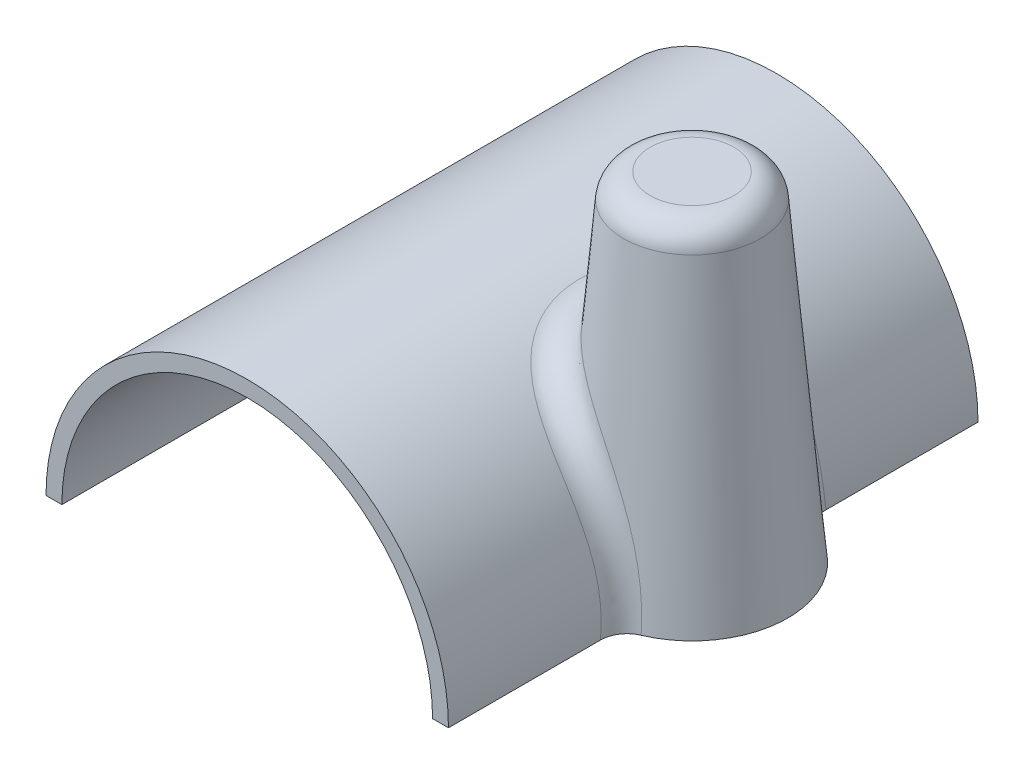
ISO-10303-21;
HEADER;
FILE_DESCRIPTION(('STEP AP214'),'2;1');
FILE_NAME('part.step','',(''),(''),'','','');
FILE_SCHEMA(('AUTOMOTIVE_DESIGN { 1 0 10303 214 1 1 1 1 }'));
ENDSEC;
DATA;
#1=APPLICATION_CONTEXT('core data for automotive mechanical design processes');
#2=APPLICATION_PROTOCOL_DEFINITION('international standard','automotive_design',2000,#1);
#3=PRODUCT_CONTEXT('',#1,'mechanical');
#4=PRODUCT('Part','Part','',(#3));
#5=PRODUCT_RELATED_PRODUCT_CATEGORY('part','',(#4));
#6=PRODUCT_DEFINITION_FORMATION('','',#4);
#7=PRODUCT_DEFINITION_CONTEXT('part definition',#1,'design');
#8=PRODUCT_DEFINITION('design','',#6,#7);
#9=PRODUCT_DEFINITION_SHAPE('','',#8);
#10=(LENGTH_UNIT() NAMED_UNIT(*) SI_UNIT(.MILLI.,.METRE.));
#11=(NAMED_UNIT(*) PLANE_ANGLE_UNIT() SI_UNIT($,.RADIAN.));
#12=(NAMED_UNIT(*) SI_UNIT($,.STERADIAN.) SOLID_ANGLE_UNIT());
#13=UNCERTAINTY_MEASURE_WITH_UNIT(LENGTH_MEASURE(1.E-05),#10,'distance_accuracy_value','');
#14=(GEOMETRIC_REPRESENTATION_CONTEXT(3) GLOBAL_UNCERTAINTY_ASSIGNED_CONTEXT((#13)) GLOBAL_UNIT_ASSIGNED_CONTEXT((#10,
#11,#12)) REPRESENTATION_CONTEXT('',''));
#15=CARTESIAN_POINT('',(0.,0.,0.));
#16=DIRECTION('',(0.,0.,1.));
#17=DIRECTION('',(1.,0.,0.));
#18=AXIS2_PLACEMENT_3D('',#15,#16,#17);
#19=CARTESIAN_POINT('',(0.,0.,0.));
#20=DIRECTION('',(0.,1.,0.));
#21=DIRECTION('',(0.,0.,1.));
#22=AXIS2_PLACEMENT_3D('',#19,#20,#21);
#23=PLANE('',#22);
#24=DIRECTION('',(0.,0.,-1.));
#25=VECTOR('',#24,1.);
#26=CARTESIAN_POINT('',(-17.5,0.,0.));
#27=LINE('',#26,#25);
#28=CARTESIAN_POINT('',(-17.5,0.,0.));
#29=VERTEX_POINT('',#28);
#30=CARTESIAN_POINT('',(-17.5,0.,-50.));
#31=VERTEX_POINT('',#30);
#32=EDGE_CURVE('E326',#29,#31,#27,.T.);
#33=ORIENTED_EDGE('',*,*,#32,.F.);
#34=DIRECTION('',(1.,0.,0.));
#35=VECTOR('',#34,1.);
#36=CARTESIAN_POINT('',(0.,0.,0.));
#37=LINE('',#36,#35);
#38=CARTESIAN_POINT('',(-19.,0.,0.));
#39=VERTEX_POINT('',#38);
#40=EDGE_CURVE('E284',#39,#29,#37,.T.);
#41=ORIENTED_EDGE('',*,*,#40,.F.);
#42=DIRECTION('',(0.,0.,-1.));
#43=VECTOR('',#42,1.);
#44=CARTESIAN_POINT('',(-19.,0.,0.));
#45=LINE('',#44,#43);
#46=CARTESIAN_POINT('',(-19.,0.,-50.));
#47=VERTEX_POINT('',#46);
#48=EDGE_CURVE('E292',#39,#47,#45,.T.);
#49=ORIENTED_EDGE('',*,*,#48,.T.);
#50=DIRECTION('',(-1.,0.,0.));
#51=VECTOR('',#50,1.);
#52=CARTESIAN_POINT('',(0.,0.,-50.));
#53=LINE('',#52,#51);
#54=EDGE_CURVE('E42',#31,#47,#53,.T.);
#55=ORIENTED_EDGE('',*,*,#54,.F.);
#56=EDGE_LOOP('',(#33,#41,#49,#55));
#57=FACE_BOUND('',#56,.T.);
#58=ADVANCED_FACE('F38',(#57),#23,.F.);
#59=CARTESIAN_POINT('',(0.,0.,0.));
#60=DIRECTION('',(0.,0.,1.));
#61=DIRECTION('',(1.,0.,0.));
#62=AXIS2_PLACEMENT_3D('',#59,#60,#61);
#63=PLANE('',#62);
#64=CARTESIAN_POINT('',(0.,0.,0.));
#65=DIRECTION('',(0.,0.,1.));
#66=DIRECTION('',(1.,0.,0.));
#67=AXIS2_PLACEMENT_3D('',#64,#65,#66);
#68=CIRCLE('',#67,17.5);
#69=CARTESIAN_POINT('',(17.5,0.,0.));
#70=VERTEX_POINT('',#69);
#71=EDGE_CURVE('E56',#70,#29,#68,.T.);
#72=ORIENTED_EDGE('',*,*,#71,.F.);
#73=CARTESIAN_POINT('',(19.,0.,0.));
#74=VERTEX_POINT('',#73);
#75=EDGE_CURVE('E280',#70,#74,#37,.T.);
#76=ORIENTED_EDGE('',*,*,#75,.T.);
#77=CARTESIAN_POINT('',(0.,0.,0.));
#78=DIRECTION('',(0.,0.,1.));
#79=DIRECTION('',(1.,0.,0.));
#80=AXIS2_PLACEMENT_3D('',#77,#78,#79);
#81=CIRCLE('',#80,19.);
#82=EDGE_CURVE('E287',#74,#39,#81,.T.);
#83=ORIENTED_EDGE('',*,*,#82,.T.);
#84=ORIENTED_EDGE('',*,*,#40,.T.);
#85=EDGE_LOOP('',(#72,#76,#83,#84));
#86=FACE_BOUND('',#85,.T.);
#87=ADVANCED_FACE('F265',(#86),#63,.T.);
#88=CARTESIAN_POINT('',(0.,0.,-50.));
#89=DIRECTION('',(0.,0.,1.));
#90=DIRECTION('',(1.,0.,0.));
#91=AXIS2_PLACEMENT_3D('',#88,#89,#90);
#92=PLANE('',#91);
#93=CARTESIAN_POINT('',(19.,0.,-50.));
#94=VERTEX_POINT('',#93);
#95=CARTESIAN_POINT('',(17.5,0.,-50.));
#96=VERTEX_POINT('',#95);
#97=EDGE_CURVE('E129',#94,#96,#53,.T.);
#98=ORIENTED_EDGE('',*,*,#97,.T.);
#99=CARTESIAN_POINT('',(0.,0.,-50.));
#100=DIRECTION('',(0.,0.,1.));
#101=DIRECTION('',(1.,0.,0.));
#102=AXIS2_PLACEMENT_3D('',#99,#100,#101);
#103=CIRCLE('',#102,17.5);
#104=EDGE_CURVE('E121',#96,#31,#103,.T.);
#105=ORIENTED_EDGE('',*,*,#104,.T.);
#106=ORIENTED_EDGE('',*,*,#54,.T.);
#107=CARTESIAN_POINT('',(0.,0.,-50.));
#108=DIRECTION('',(0.,0.,1.));
#109=DIRECTION('',(1.,0.,0.));
#110=AXIS2_PLACEMENT_3D('',#107,#108,#109);
#111=CIRCLE('',#110,19.);
#112=EDGE_CURVE('E299',#94,#47,#111,.T.);
#113=ORIENTED_EDGE('',*,*,#112,.F.);
#114=EDGE_LOOP('',(#98,#105,#106,#113));
#115=FACE_BOUND('',#114,.T.);
#116=ADVANCED_FACE('F427',(#115),#92,.F.);
#117=CARTESIAN_POINT('',(17.,32.,-25.));
#118=DIRECTION('',(0.,1.,0.));
#119=DIRECTION('',(0.,0.,1.));
#120=AXIS2_PLACEMENT_3D('',#117,#118,#119);
#121=PLANE('',#120);
#122=CARTESIAN_POINT('',(17.,32.,-25.));
#123=DIRECTION('',(0.,1.,0.));
#124=DIRECTION('',(0.,0.,1.));
#125=AXIS2_PLACEMENT_3D('',#122,#123,#124);
#126=CIRCLE('',#125,3.95917206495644);
#127=CARTESIAN_POINT('',(17.,32.,-21.0408279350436));
#128=VERTEX_POINT('',#127);
#129=EDGE_CURVE('E246',#128,#128,#126,.T.);
#130=ORIENTED_EDGE('',*,*,#129,.T.);
#131=EDGE_LOOP('',(#130));
#132=FACE_BOUND('',#131,.T.);
#133=ADVANCED_FACE('F430',(#132),#121,.T.);
#134=CARTESIAN_POINT('',(16.6515253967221,-5.38300120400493,-13.3651001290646));
#135=CARTESIAN_POINT('',(16.4830591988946,-5.90412669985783,-16.4375375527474));
#136=CARTESIAN_POINT('',(19.3224780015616,-6.96202445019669,-17.1847842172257));
#137=CARTESIAN_POINT('',(16.725762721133,-5.15334858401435,-13.4179618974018));
#138=CARTESIAN_POINT('',(16.566382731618,-5.67087719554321,-16.4578366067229));
#139=CARTESIAN_POINT('',(19.3814335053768,-6.67987980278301,-17.2280607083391));
#140=CARTESIAN_POINT('',(16.7952559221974,-4.92215784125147,-13.4706042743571));
#141=CARTESIAN_POINT('',(16.6454897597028,-5.43361441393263,-16.479766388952));
#142=CARTESIAN_POINT('',(19.4362605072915,-6.39584546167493,-17.2711813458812));
#143=CARTESIAN_POINT('',(16.9246661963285,-4.45690673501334,-13.5746061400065));
#144=CARTESIAN_POINT('',(16.7938942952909,-4.95385472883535,-16.5258754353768));
#145=CARTESIAN_POINT('',(19.5376466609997,-5.82425124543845,-17.3565451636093));
#146=CARTESIAN_POINT('',(16.9845826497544,-4.22284618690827,-13.6259655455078));
#147=CARTESIAN_POINT('',(16.8633161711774,-4.71121958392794,-16.5500555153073));
#148=CARTESIAN_POINT('',(19.5842052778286,-5.53669114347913,-17.3987882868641));
#149=CARTESIAN_POINT('',(17.149866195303,-3.51652393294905,-13.7768834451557));
#150=CARTESIAN_POINT('',(17.0555995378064,-3.97847596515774,-16.6245325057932));
#151=CARTESIAN_POINT('',(19.7114860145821,-4.66892380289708,-17.5233778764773));
#152=CARTESIAN_POINT('',(17.2407071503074,-3.04030810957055,-13.8732374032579));
#153=CARTESIAN_POINT('',(17.1643228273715,-3.47805289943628,-16.6772887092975));
#154=CARTESIAN_POINT('',(19.7797652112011,-4.08385864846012,-17.6035485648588));
#155=CARTESIAN_POINT('',(17.3824301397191,-2.08203191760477,-14.0510054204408));
#156=CARTESIAN_POINT('',(17.3369656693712,-2.46715831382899,-16.7824599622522));
#157=CARTESIAN_POINT('',(19.8827454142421,-2.90654789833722,-17.7538076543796));
#158=CARTESIAN_POINT('',(17.4334608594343,-1.60000019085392,-14.132474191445));
#159=CARTESIAN_POINT('',(17.4017488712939,-1.95517400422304,-16.8350504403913));
#160=CARTESIAN_POINT('',(19.9175714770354,-2.31433749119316,-17.8239327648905));
#161=CARTESIAN_POINT('',(17.4953240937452,-0.631587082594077,-14.2764511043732));
#162=CARTESIAN_POINT('',(17.4854987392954,-0.925735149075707,-16.9359016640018));
#163=CARTESIAN_POINT('',(19.9540925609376,-1.12457281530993,-17.9516146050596));
#164=CARTESIAN_POINT('',(17.506168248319,-0.145207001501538,-14.3389647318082));
#165=CARTESIAN_POINT('',(17.5048936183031,-0.406478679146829,-16.9843685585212));
#166=CARTESIAN_POINT('',(19.955797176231,-0.527020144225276,-18.0091749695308));
#167=CARTESIAN_POINT('',(17.4872506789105,0.823919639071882,-14.4422482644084));
#168=CARTESIAN_POINT('',(17.4974154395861,0.626143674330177,-17.0745986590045));
#169=CARTESIAN_POINT('',(19.9265375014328,0.663621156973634,-18.1099096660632));
#170=CARTESIAN_POINT('',(17.4578509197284,1.30665983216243,-14.483207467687));
#171=CARTESIAN_POINT('',(17.4710374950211,1.14141430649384,-17.116596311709));
#172=CARTESIAN_POINT('',(19.8958649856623,1.2567019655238,-18.1532079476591));
#173=CARTESIAN_POINT('',(17.3590286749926,2.26893736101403,-14.5445288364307));
#174=CARTESIAN_POINT('',(17.3736154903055,2.16380277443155,-17.1950217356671));
#175=CARTESIAN_POINT('',(19.803020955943,2.43892864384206,-18.2264822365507));
#176=CARTESIAN_POINT('',(17.2896022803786,2.74847437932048,-14.5648889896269));
#177=CARTESIAN_POINT('',(17.3023108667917,2.67283803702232,-17.2315881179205));
#178=CARTESIAN_POINT('',(19.7408463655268,3.0280741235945,-18.2564569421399));
#179=CARTESIAN_POINT('',(17.1110936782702,3.70072074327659,-14.5880600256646));
#180=CARTESIAN_POINT('',(17.1171787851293,3.67615214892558,-17.3023798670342));
#181=CARTESIAN_POINT('',(19.5860713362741,4.19797679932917,-18.305208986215));
#182=CARTESIAN_POINT('',(17.0019825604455,4.17342484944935,-14.5908580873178));
#183=CARTESIAN_POINT('',(17.0027389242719,4.17223707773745,-17.3367246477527));
#184=CARTESIAN_POINT('',(19.4934487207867,4.77872755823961,-18.3239781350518));
#185=CARTESIAN_POINT('',(16.7449303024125,5.10805521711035,-14.5844365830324));
#186=CARTESIAN_POINT('',(16.7349723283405,5.14268508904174,-17.4085207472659));
#187=CARTESIAN_POINT('',(19.2792129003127,5.92698772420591,-18.3539434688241));
#188=CARTESIAN_POINT('',(16.5969899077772,5.56998168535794,-14.57521724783));
#189=CARTESIAN_POINT('',(16.5807900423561,5.61864166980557,-17.446133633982));
#190=CARTESIAN_POINT('',(19.1576002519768,6.49449738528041,-18.365139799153));
#191=CARTESIAN_POINT('',(16.2688897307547,6.46472700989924,-14.5527327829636));
#192=CARTESIAN_POINT('',(16.2444058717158,6.52710661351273,-17.5301098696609));
#193=CARTESIAN_POINT('',(18.8914574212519,7.59375592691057,-18.3844574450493));
#194=CARTESIAN_POINT('',(16.0899664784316,6.89800294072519,-14.5396125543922));
#195=CARTESIAN_POINT('',(16.062281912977,6.96187245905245,-17.5764173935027));
#196=CARTESIAN_POINT('',(18.7478249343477,8.12606635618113,-18.3926687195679));
#197=CARTESIAN_POINT('',(15.6978764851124,7.74894348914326,-14.5174641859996));
#198=CARTESIAN_POINT('',(15.6725063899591,7.8001563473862,-17.685701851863));
#199=CARTESIAN_POINT('',(18.4363722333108,9.17150760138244,-18.4116041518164));
#200=CARTESIAN_POINT('',(15.484705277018,8.16660606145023,-14.5084365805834));
#201=CARTESIAN_POINT('',(15.4638610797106,8.20440894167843,-17.7491122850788));
#202=CARTESIAN_POINT('',(18.2685488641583,9.68463590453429,-18.4223286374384));
#203=CARTESIAN_POINT('',(15.0257914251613,8.98301758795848,-14.5037979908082));
#204=CARTESIAN_POINT('',(15.0293822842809,8.97589560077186,-17.8995027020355));
#205=CARTESIAN_POINT('',(17.9105588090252,10.6876557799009,-18.4518558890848));
#206=CARTESIAN_POINT('',(14.7800917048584,9.38179054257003,-14.5081694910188));
#207=CARTESIAN_POINT('',(14.8026853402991,9.34344447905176,-17.9870994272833));
#208=CARTESIAN_POINT('',(17.7204216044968,11.1775768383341,-18.4706480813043));
#209=CARTESIAN_POINT('',(14.2578459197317,10.1578660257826,-14.5405614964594));
#210=CARTESIAN_POINT('',(14.3423857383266,10.0371051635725,-18.1917048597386));
#211=CARTESIAN_POINT('',(17.3195717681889,12.1310410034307,-18.5222874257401));
#212=CARTESIAN_POINT('',(13.9813158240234,10.5351795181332,-14.5685698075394));
#213=CARTESIAN_POINT('',(14.1082143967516,10.3629496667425,-18.3095376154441));
#214=CARTESIAN_POINT('',(17.1088697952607,12.5945975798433,-18.5551273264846));
#215=CARTESIAN_POINT('',(13.4996661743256,11.1401715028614,-14.6438537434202));
#216=CARTESIAN_POINT('',(13.726442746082,10.8639509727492,-18.5308992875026));
#217=CARTESIAN_POINT('',(16.7445560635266,13.3378734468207,-18.6264717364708));
#218=CARTESIAN_POINT('',(13.3024043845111,11.3749518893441,-14.6812848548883));
#219=CARTESIAN_POINT('',(13.5755586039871,11.0535958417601,-18.6264795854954));
#220=CARTESIAN_POINT('',(16.5960167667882,13.6263179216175,-18.6592131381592));
#221=CARTESIAN_POINT('',(12.8971277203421,11.832471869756,-14.7745712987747));
#222=CARTESIAN_POINT('',(13.280612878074,11.4127398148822,-18.8315920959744));
#223=CARTESIAN_POINT('',(16.2921803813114,14.1884138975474,-18.7353814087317));
#224=CARTESIAN_POINT('',(12.6891158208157,12.0552147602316,-14.8304215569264));
#225=CARTESIAN_POINT('',(13.1366719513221,11.5819012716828,-18.941341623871));
#226=CARTESIAN_POINT('',(16.1368851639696,14.4620694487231,-18.7788053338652));
#227=CARTESIAN_POINT('',(12.2643012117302,12.4871359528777,-14.9638360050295));
#228=CARTESIAN_POINT('',(12.860007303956,11.9000115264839,-19.1734652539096));
#229=CARTESIAN_POINT('',(15.8210125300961,14.9927154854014,-18.8781271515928));
#230=CARTESIAN_POINT('',(12.0475094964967,12.6963304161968,-15.0413737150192));
#231=CARTESIAN_POINT('',(12.7275257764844,12.0485705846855,-19.2959713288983));
#232=CARTESIAN_POINT('',(15.6604417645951,15.2497258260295,-18.9340098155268));
#233=CARTESIAN_POINT('',(11.6072239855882,13.1000566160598,-15.2214578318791));
#234=CARTESIAN_POINT('',(12.4773437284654,12.326759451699,-19.5513637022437));
#235=CARTESIAN_POINT('',(15.3355298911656,15.745732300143,-19.0600430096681));
#236=CARTESIAN_POINT('',(11.3837314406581,13.294591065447,-15.3239995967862));
#237=CARTESIAN_POINT('',(12.3600131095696,12.455938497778,-19.6842753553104));
#238=CARTESIAN_POINT('',(15.1711894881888,15.9847317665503,-19.1301908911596));
#239=CARTESIAN_POINT('',(10.9740543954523,13.6336880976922,-15.5358270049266));
#240=CARTESIAN_POINT('',(12.1626881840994,12.6752012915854,-19.932043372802));
#241=CARTESIAN_POINT('',(14.8709234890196,16.4013366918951,-19.2721125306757));
#242=CARTESIAN_POINT('',(10.7884796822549,13.7809032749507,-15.6404917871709));
#243=CARTESIAN_POINT('',(12.0798355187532,12.7680874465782,-20.0459848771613));
#244=CARTESIAN_POINT('',(14.7352677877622,16.5822010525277,-19.3412687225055));
#245=CARTESIAN_POINT('',(10.4168521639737,14.0639149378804,-15.8698629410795));
#246=CARTESIAN_POINT('',(11.9262083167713,12.9441634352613,-20.2766109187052));
#247=CARTESIAN_POINT('',(14.4642535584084,16.9299010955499,-19.4908770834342));
#248=CARTESIAN_POINT('',(10.2307994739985,14.1997139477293,-15.9945648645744));
#249=CARTESIAN_POINT('',(11.8556727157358,13.027124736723,-20.3931648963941));
#250=CARTESIAN_POINT('',(14.3288949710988,17.0967398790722,-19.5713267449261));
#251=CARTESIAN_POINT('',(9.86049074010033,14.4593170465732,-16.2650030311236));
#252=CARTESIAN_POINT('',(11.7261696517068,13.1851957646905,-20.6271703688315));
#253=CARTESIAN_POINT('',(14.0600487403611,17.4156808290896,-19.7440306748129));
#254=CARTESIAN_POINT('',(9.67623436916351,14.5831233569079,-16.4107353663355));
#255=CARTESIAN_POINT('',(11.667419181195,13.2601007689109,-20.7444389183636));
#256=CARTESIAN_POINT('',(13.9265607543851,17.5677857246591,-19.8362827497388));
#257=CARTESIAN_POINT('',(9.31199462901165,14.8183589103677,-16.7238098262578));
#258=CARTESIAN_POINT('',(11.5600022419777,13.4039042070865,-20.9785728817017));
#259=CARTESIAN_POINT('',(13.6631555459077,17.8567894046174,-20.0328741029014));
#260=CARTESIAN_POINT('',(9.13201130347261,14.9297880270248,-16.8911521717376));
#261=CARTESIAN_POINT('',(11.5115150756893,13.4726238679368,-21.0952238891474));
#262=CARTESIAN_POINT('',(13.5332383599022,17.9936880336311,-20.137213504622));
#263=CARTESIAN_POINT('',(8.77791038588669,15.1407075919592,-17.2485723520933));
#264=CARTESIAN_POINT('',(11.4222085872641,13.6059620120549,-21.3283134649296));
#265=CARTESIAN_POINT('',(13.2780246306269,18.2528177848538,-20.3586418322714));
#266=CARTESIAN_POINT('',(8.60383545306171,15.24012076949,-17.4387831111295));
#267=CARTESIAN_POINT('',(11.3815753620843,13.6703955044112,-21.4445165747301));
#268=CARTESIAN_POINT('',(13.152761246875,18.3749539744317,-20.4758049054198));
#269=CARTESIAN_POINT('',(8.26548358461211,15.4262463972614,-17.8405854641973));
#270=CARTESIAN_POINT('',(11.3059437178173,13.7956199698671,-21.6763752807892));
#271=CARTESIAN_POINT('',(12.9095874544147,18.6036226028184,-20.7220348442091));
#272=CARTESIAN_POINT('',(8.10120691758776,15.5129584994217,-18.0521776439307));
#273=CARTESIAN_POINT('',(11.2710400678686,13.8562805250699,-21.7918182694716));
#274=CARTESIAN_POINT('',(12.7916772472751,18.7101546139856,-20.8511020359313));
#275=CARTESIAN_POINT('',(7.78512461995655,15.6739693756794,-18.4956783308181));
#276=CARTESIAN_POINT('',(11.2047796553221,13.9741461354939,-22.023339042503));
#277=CARTESIAN_POINT('',(12.5650309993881,18.9079679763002,-21.1205361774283));
#278=CARTESIAN_POINT('',(7.63332131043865,15.748265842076,-18.7275906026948));
#279=CARTESIAN_POINT('',(11.1734877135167,14.0312447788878,-22.1392309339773));
#280=CARTESIAN_POINT('',(12.4562966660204,18.9992464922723,-21.2609052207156));
#281=CARTESIAN_POINT('',(7.34474359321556,15.8849061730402,-19.2100739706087));
#282=CARTESIAN_POINT('',(11.1131254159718,14.1414449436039,-22.3732030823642));
#283=CARTESIAN_POINT('',(12.2497483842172,19.167118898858,-21.5520137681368));
#284=CARTESIAN_POINT('',(7.20796743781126,15.9472514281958,-19.4606428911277));
#285=CARTESIAN_POINT('',(11.0840982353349,14.1944677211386,-22.491130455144));
#286=CARTESIAN_POINT('',(12.1519331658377,19.2437144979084,-21.7027520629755));
#287=CARTESIAN_POINT('',(6.96538413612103,16.0545661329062,-19.9506896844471));
#288=CARTESIAN_POINT('',(11.0308983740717,14.290063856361,-22.7178774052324));
#289=CARTESIAN_POINT('',(11.9785462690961,19.3755582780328,-21.9968377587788));
#290=CARTESIAN_POINT('',(6.85782935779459,16.1006807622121,-20.1884880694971));
#291=CARTESIAN_POINT('',(11.0065589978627,14.333111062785,-22.8262378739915));
#292=CARTESIAN_POINT('',(11.9017144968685,19.4322133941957,-22.1392516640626));
#293=CARTESIAN_POINT('',(6.65784483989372,16.1844017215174,-20.6756579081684));
#294=CARTESIAN_POINT('',(10.9596851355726,14.4142531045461,-23.0467020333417));
#295=CARTESIAN_POINT('',(11.7589079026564,19.5350705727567,-22.4305162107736));
#296=CARTESIAN_POINT('',(6.56541426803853,16.2220085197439,-20.9250287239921));
#297=CARTESIAN_POINT('',(10.9371619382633,14.4523291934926,-23.1587473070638));
#298=CARTESIAN_POINT('',(11.6929324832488,19.5812732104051,-22.5793664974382));
#299=CARTESIAN_POINT('',(6.39693338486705,16.2891825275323,-21.4331830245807));
#300=CARTESIAN_POINT('',(10.8946780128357,14.522537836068,-23.3867869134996));
#301=CARTESIAN_POINT('',(11.572704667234,19.6638012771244,-22.8822932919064));
#302=CARTESIAN_POINT('',(6.32086207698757,16.3187600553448,-21.6919539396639));
#303=CARTESIAN_POINT('',(10.8747175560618,14.5546734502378,-23.5027434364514));
#304=CARTESIAN_POINT('',(11.5184372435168,19.7001393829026,-23.0363628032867));
#305=CARTESIAN_POINT('',(6.18588237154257,16.3704024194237,-22.2171720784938));
#306=CARTESIAN_POINT('',(10.8382678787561,14.6121978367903,-23.7385404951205));
#307=CARTESIAN_POINT('',(11.4221626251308,19.7635857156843,-23.3487746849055));
#308=CARTESIAN_POINT('',(6.12696925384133,16.3924693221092,-22.4836171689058));
#309=CARTESIAN_POINT('',(10.8217750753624,14.6375937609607,-23.8583731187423));
#310=CARTESIAN_POINT('',(11.380152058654,19.7906964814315,-23.5071158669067));
#311=CARTESIAN_POINT('',(6.01623876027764,16.4334754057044,-23.0800582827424));
#312=CARTESIAN_POINT('',(10.7901335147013,14.6856018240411,-24.1273913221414));
#313=CARTESIAN_POINT('',(11.3011990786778,19.8410753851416,-23.8613313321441));
#314=CARTESIAN_POINT('',(5.9686523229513,16.4507290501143,-23.4114294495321));
#315=CARTESIAN_POINT('',(10.7760182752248,14.7064700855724,-24.277417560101));
#316=CARTESIAN_POINT('',(11.2672754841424,19.8622727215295,-24.0579727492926));
#317=CARTESIAN_POINT('',(5.90059915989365,16.4752617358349,-24.0788945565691));
#318=CARTESIAN_POINT('',(10.7556268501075,14.7363870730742,-24.5804255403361));
#319=CARTESIAN_POINT('',(11.2187636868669,19.8924128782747,-24.4538902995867));
#320=CARTESIAN_POINT('',(5.88013176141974,16.4825410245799,-24.4149883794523));
#321=CARTESIAN_POINT('',(10.749340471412,14.7454509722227,-24.7334767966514));
#322=CARTESIAN_POINT('',(11.2041750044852,19.9013560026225,-24.6531663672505));
#323=CARTESIAN_POINT('',(5.86802258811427,16.4868522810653,-25.0187648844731));
#324=CARTESIAN_POINT('',(10.7456300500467,14.7508081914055,-25.0085284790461));
#325=CARTESIAN_POINT('',(11.1955438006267,19.9066526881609,-25.0111270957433));
#326=CARTESIAN_POINT('',(5.87131611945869,16.4856845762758,-25.2862943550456));
#327=CARTESIAN_POINT('',(10.7466471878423,14.7493475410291,-25.1304844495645));
#328=CARTESIAN_POINT('',(11.1978912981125,19.9052180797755,-25.1697269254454));
#329=CARTESIAN_POINT('',(5.89516893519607,16.4771707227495,-25.8201270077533));
#330=CARTESIAN_POINT('',(10.7539224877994,14.7388089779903,-25.373530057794));
#331=CARTESIAN_POINT('',(11.2148934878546,19.8947582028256,-25.4862452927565));
#332=CARTESIAN_POINT('',(5.91573267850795,16.4698229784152,-26.0864298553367));
#333=CARTESIAN_POINT('',(10.7601845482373,14.7297254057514,-25.4946615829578));
#334=CARTESIAN_POINT('',(11.2295513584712,19.8857309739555,-25.6441636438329));
#335=CARTESIAN_POINT('',(5.97394435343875,16.4487975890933,-26.6160532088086));
#336=CARTESIAN_POINT('',(10.7775699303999,14.7041591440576,-25.7349699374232));
#337=CARTESIAN_POINT('',(11.2710483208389,19.859899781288,-25.9583446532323));
#338=CARTESIAN_POINT('',(6.01160717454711,16.4351144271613,-26.8793709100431));
#339=CARTESIAN_POINT('',(10.7887026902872,14.6876622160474,-25.8541780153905));
#340=CARTESIAN_POINT('',(11.297898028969,19.8430890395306,-26.1146057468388));
#341=CARTESIAN_POINT('',(6.10363629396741,16.4011593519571,-27.4010123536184));
#342=CARTESIAN_POINT('',(10.8151730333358,14.6476820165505,-26.0896485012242));
#343=CARTESIAN_POINT('',(11.3635143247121,19.8013728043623,-26.4243471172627));
#344=CARTESIAN_POINT('',(6.15800866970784,16.380885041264,-27.659334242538));
#345=CARTESIAN_POINT('',(10.8305176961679,14.6241873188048,-26.2059273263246));
#346=CARTESIAN_POINT('',(11.4022852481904,19.7764643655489,-26.5778263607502));
#347=CARTESIAN_POINT('',(6.28280630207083,16.3334256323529,-28.1688249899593));
#348=CARTESIAN_POINT('',(10.864569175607,14.5708297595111,-26.4348010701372));
#349=CARTESIAN_POINT('',(11.491291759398,19.7181570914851,-26.8807913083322));
#350=CARTESIAN_POINT('',(6.35321751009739,16.3062465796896,-28.4199998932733));
#351=CARTESIAN_POINT('',(10.8832761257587,14.5409666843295,-26.5473967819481));
#352=CARTESIAN_POINT('',(11.5415173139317,19.6847656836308,-27.0302803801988));
#353=CARTESIAN_POINT('',(6.50936176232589,16.2445453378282,-28.9137511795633));
#354=CARTESIAN_POINT('',(10.9232224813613,14.4755792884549,-26.7688698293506));
#355=CARTESIAN_POINT('',(11.6529292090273,19.6089613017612,-27.3244751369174));
#356=CARTESIAN_POINT('',(6.59510011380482,16.2100206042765,-29.1563245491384));
#357=CARTESIAN_POINT('',(10.9444608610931,14.4400549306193,-26.8777213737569));
#358=CARTESIAN_POINT('',(11.7141193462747,19.5665452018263,-27.4691791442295));
#359=CARTESIAN_POINT('',(6.78084611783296,16.1332022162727,-29.6309709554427));
#360=CARTESIAN_POINT('',(10.9887526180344,14.3641887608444,-27.0918629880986));
#361=CARTESIAN_POINT('',(11.8467341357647,19.4721683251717,-27.7527403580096));
#362=CARTESIAN_POINT('',(6.88084560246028,16.09091300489,-29.8630499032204));
#363=CARTESIAN_POINT('',(11.0117965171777,14.3238633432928,-27.1971083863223));
#364=CARTESIAN_POINT('',(11.9181529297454,19.4202130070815,-27.8916008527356));
#365=CARTESIAN_POINT('',(7.09397533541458,15.9980941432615,-30.3153162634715));
#366=CARTESIAN_POINT('',(11.0593286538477,14.2391905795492,-27.4047643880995));
#367=CARTESIAN_POINT('',(12.0704450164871,19.3061784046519,-28.1627104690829));
#368=CARTESIAN_POINT('',(7.20710577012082,15.947564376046,-30.5355035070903));
#369=CARTESIAN_POINT('',(11.0838011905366,14.1948712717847,-27.5071068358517));
#370=CARTESIAN_POINT('',(12.1513184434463,19.2440989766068,-28.2949594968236));
#371=CARTESIAN_POINT('',(7.44552987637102,15.8376565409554,-30.9633210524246));
#372=CARTESIAN_POINT('',(11.1343479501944,14.102760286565,-27.7102432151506));
#373=CARTESIAN_POINT('',(12.3218703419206,19.1090693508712,-28.5525105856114));
#374=CARTESIAN_POINT('',(7.57086262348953,15.7782496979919,-31.1709073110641));
#375=CARTESIAN_POINT('',(11.160403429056,14.0550013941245,-27.8109420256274));
#376=CARTESIAN_POINT('',(12.4115771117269,19.0360838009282,-28.6777881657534));
#377=CARTESIAN_POINT('',(7.83179452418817,15.6503702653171,-31.5714988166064));
#378=CARTESIAN_POINT('',(11.2146406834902,13.9566305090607,-28.011489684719));
#379=CARTESIAN_POINT('',(12.5984899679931,18.8789747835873,-28.920234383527));
#380=CARTESIAN_POINT('',(7.96739054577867,15.581900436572,-31.7645084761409));
#381=CARTESIAN_POINT('',(11.2427881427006,13.9060786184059,-28.1112302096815));
#382=CARTESIAN_POINT('',(12.6956937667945,18.7948547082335,-29.0374054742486));
#383=CARTESIAN_POINT('',(8.24725312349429,15.435599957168,-32.13516506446));
#384=CARTESIAN_POINT('',(11.3023317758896,13.8022244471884,-28.3108946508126));
#385=CARTESIAN_POINT('',(12.8965151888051,18.6151141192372,-29.2632045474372));
#386=CARTESIAN_POINT('',(8.3915220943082,15.3577666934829,-32.3128076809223));
#387=CARTESIAN_POINT('',(11.3336817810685,13.7489947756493,-28.4106928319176));
#388=CARTESIAN_POINT('',(13.0001345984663,18.5194903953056,-29.3718301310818));
#389=CARTESIAN_POINT('',(8.68690189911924,15.192641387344,-32.6520142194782));
#390=CARTESIAN_POINT('',(11.4010811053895,13.639535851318,-28.6110736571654));
#391=CARTESIAN_POINT('',(13.2125380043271,18.3166221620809,-29.5801239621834));
#392=CARTESIAN_POINT('',(8.83801090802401,15.1053518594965,-32.8135823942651));
#393=CARTESIAN_POINT('',(11.4370634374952,13.5833943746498,-28.7115169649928));
#394=CARTESIAN_POINT('',(13.3213206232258,18.2093807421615,-29.6797945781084));
#395=CARTESIAN_POINT('',(9.15044373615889,14.9182311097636,-33.1255069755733));
#396=CARTESIAN_POINT('',(11.5166240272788,13.4654986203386,-28.9167398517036));
#397=CARTESIAN_POINT('',(13.546550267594,17.979489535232,-29.8731979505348));
#398=CARTESIAN_POINT('',(9.31194013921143,14.8180793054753,-33.2753117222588));
#399=CARTESIAN_POINT('',(11.5603257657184,13.4037178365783,-29.0214148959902));
#400=CARTESIAN_POINT('',(13.6631318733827,17.856445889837,-29.9666229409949));
#401=CARTESIAN_POINT('',(9.63844722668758,14.6078075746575,-33.5575262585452));
#402=CARTESIAN_POINT('',(11.6560585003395,13.2750918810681,-29.2314317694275));
#403=CARTESIAN_POINT('',(13.8992204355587,17.5981120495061,-30.1437441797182));
#404=CARTESIAN_POINT('',(9.80345790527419,14.4976876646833,-33.6899360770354));
#405=CARTESIAN_POINT('',(11.7079613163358,13.2083750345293,-29.336618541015));
#406=CARTESIAN_POINT('',(14.0187273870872,17.4628218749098,-30.2274404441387));
#407=CARTESIAN_POINT('',(10.1352034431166,14.2677392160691,-33.937759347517));
#408=CARTESIAN_POINT('',(11.8212759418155,13.0685168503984,-29.5467292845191));
#409=CARTESIAN_POINT('',(14.259438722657,17.1803137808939,-30.3852999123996));
#410=CARTESIAN_POINT('',(10.3019386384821,14.1479087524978,-34.0531694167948));
#411=CARTESIAN_POINT('',(11.8825348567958,12.9955204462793,-29.6515172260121));
#412=CARTESIAN_POINT('',(14.3806434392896,17.0330934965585,-30.4594612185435));
#413=CARTESIAN_POINT('',(10.6354441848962,13.8989449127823,-34.2676464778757));
#414=CARTESIAN_POINT('',(12.0150906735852,12.8417332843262,-29.8594731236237));
#415=CARTESIAN_POINT('',(14.6235829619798,16.7272236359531,-30.5985822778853));
#416=CARTESIAN_POINT('',(10.8022145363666,13.769809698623,-34.3667102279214));
#417=CARTESIAN_POINT('',(12.0862176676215,12.7611036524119,-29.9625368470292));
#418=CARTESIAN_POINT('',(14.7453178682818,16.5685718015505,-30.6635402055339));
#419=CARTESIAN_POINT('',(11.2012869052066,13.4488097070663,-34.5862424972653));
#420=CARTESIAN_POINT('',(12.2687459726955,12.5568397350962,-30.2059726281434));
#421=CARTESIAN_POINT('',(15.0372909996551,16.1742003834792,-30.8091678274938));
#422=CARTESIAN_POINT('',(11.4328863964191,13.2526537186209,-34.6992255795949));
#423=CARTESIAN_POINT('',(12.3849460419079,12.4287852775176,-30.3451994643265));
#424=CARTESIAN_POINT('',(15.2072859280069,15.9332087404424,-30.8856053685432));
#425=CARTESIAN_POINT('',(11.8897166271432,12.8443995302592,-34.8978425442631));
#426=CARTESIAN_POINT('',(12.6347287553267,12.1520457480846,-30.61346803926));
#427=CARTESIAN_POINT('',(15.5438068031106,15.4316393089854,-31.0229073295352));
#428=CARTESIAN_POINT('',(12.1149452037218,12.6322960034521,-34.9834672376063));
#429=CARTESIAN_POINT('',(12.7678854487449,12.0038538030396,-30.7424982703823));
#430=CARTESIAN_POINT('',(15.7103315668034,15.1710549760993,-31.0837665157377));
#431=CARTESIAN_POINT('',(12.5566798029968,12.1933141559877,-35.1309883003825));
#432=CARTESIAN_POINT('',(13.047696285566,11.6852326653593,-30.9874252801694));
#433=CARTESIAN_POINT('',(16.038219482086,14.6317344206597,-31.1918833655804));
#434=CARTESIAN_POINT('',(12.7731702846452,11.9664112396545,-35.1928439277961));
#435=CARTESIAN_POINT('',(13.1940626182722,11.5152322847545,-31.103437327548));
#436=CARTESIAN_POINT('',(16.1995733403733,14.3529679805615,-31.239117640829));
#437=CARTESIAN_POINT('',(13.1950404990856,11.4995647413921,-35.296314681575));
#438=CARTESIAN_POINT('',(13.4952328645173,11.1530092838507,-31.3203395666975));
#439=CARTESIAN_POINT('',(16.5153415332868,13.7794137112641,-31.3218669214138));
#440=CARTESIAN_POINT('',(13.4004169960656,11.2596174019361,-35.337923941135));
#441=CARTESIAN_POINT('',(13.6498765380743,10.9611740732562,-31.4214561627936));
#442=CARTESIAN_POINT('',(16.6697538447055,13.4846212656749,-31.3573785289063));
#443=CARTESIAN_POINT('',(13.8790539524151,10.6686004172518,-35.4180387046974));
#444=CARTESIAN_POINT('',(14.0246967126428,10.4755697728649,-31.6450647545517));
#445=CARTESIAN_POINT('',(17.0312645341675,12.7585146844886,-31.4311113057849));
#446=CARTESIAN_POINT('',(14.1461866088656,10.3118277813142,-35.4484869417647));
#447=CARTESIAN_POINT('',(14.2477795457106,10.1703962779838,-31.7613429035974));
#448=CARTESIAN_POINT('',(17.2344218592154,12.32019401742,-31.4646225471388));
#449=CARTESIAN_POINT('',(14.6527833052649,9.57835401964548,-35.4864299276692));
#450=CARTESIAN_POINT('',(14.6884145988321,9.52121648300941,-31.9650837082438));
#451=CARTESIAN_POINT('',(17.6223635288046,11.419069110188,-31.5180351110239));
#452=CARTESIAN_POINT('',(14.8922356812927,9.20164458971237,-35.4939150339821));
#453=CARTESIAN_POINT('',(14.9064010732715,9.17752070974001,-32.0532782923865));
#454=CARTESIAN_POINT('',(17.8071401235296,10.9562546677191,-31.5379307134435));
#455=CARTESIAN_POINT('',(15.3419389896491,8.43056123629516,-35.4949477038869));
#456=CARTESIAN_POINT('',(15.3270190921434,8.455981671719,-32.2059491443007));
#457=CARTESIAN_POINT('',(18.1567755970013,10.0089236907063,-31.569354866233));
#458=CARTESIAN_POINT('',(15.552151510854,8.03616496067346,-35.4884771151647));
#459=CARTESIAN_POINT('',(15.5303613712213,8.07795295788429,-32.2709934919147));
#460=CARTESIAN_POINT('',(18.3216082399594,9.52437969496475,-31.5808724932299));
#461=CARTESIAN_POINT('',(15.9417382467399,7.23259097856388,-35.4698247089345));
#462=CARTESIAN_POINT('',(15.9137340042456,7.2934608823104,-32.3834921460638));
#463=CARTESIAN_POINT('',(18.6296382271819,8.53713165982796,-31.6004178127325));
#464=CARTESIAN_POINT('',(16.121115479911,6.82341472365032,-35.457643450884));
#465=CARTESIAN_POINT('',(16.0946151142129,6.88645580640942,-32.4313654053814));
#466=CARTESIAN_POINT('',(18.7728376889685,8.03442940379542,-31.6084458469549));
#467=CARTESIAN_POINT('',(16.4534187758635,5.97892605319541,-35.4345933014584));
#468=CARTESIAN_POINT('',(16.4327925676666,6.03573103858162,-32.5174369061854));
#469=CARTESIAN_POINT('',(19.0406440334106,6.99691475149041,-31.6258209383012));
#470=CARTESIAN_POINT('',(16.6052891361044,5.54319649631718,-35.4237802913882));
#471=CARTESIAN_POINT('',(16.5901060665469,5.59009957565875,-32.5555680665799));
#472=CARTESIAN_POINT('',(19.1644905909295,6.46158986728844,-31.635202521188));
#473=CARTESIAN_POINT('',(16.874171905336,4.6610030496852,-35.4109302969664));
#474=CARTESIAN_POINT('',(16.86927446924,4.67995433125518,-32.6266794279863));
#475=CARTESIAN_POINT('',(19.3863957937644,5.37775220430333,-31.6594703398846));
#476=CARTESIAN_POINT('',(16.9911842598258,4.21453914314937,-35.4088933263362));
#477=CARTESIAN_POINT('',(16.9919294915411,4.21415523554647,-32.6598252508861));
#478=CARTESIAN_POINT('',(19.4844543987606,4.82923940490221,-31.674356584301));
#479=CARTESIAN_POINT('',(17.1893782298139,3.31468052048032,-35.4190478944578));
#480=CARTESIAN_POINT('',(17.198448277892,3.27052559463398,-32.7262956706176));
#481=CARTESIAN_POINT('',(19.6533454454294,3.72369881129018,-31.7131423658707));
#482=CARTESIAN_POINT('',(17.2706267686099,2.8613004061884,-35.4312127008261));
#483=CARTESIAN_POINT('',(17.2829779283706,2.79122694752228,-32.7597292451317));
#484=CARTESIAN_POINT('',(19.7242287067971,3.1666889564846,-31.7370249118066));
#485=CARTESIAN_POINT('',(17.3970912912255,1.95007408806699,-35.4732503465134));
#486=CARTESIAN_POINT('',(17.4117127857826,1.82585766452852,-32.8304220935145));
#487=CARTESIAN_POINT('',(19.8379418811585,2.04718233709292,-31.7961839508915));
#488=CARTESIAN_POINT('',(17.44230800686,1.49222797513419,-35.503122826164));
#489=CARTESIAN_POINT('',(17.4562613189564,1.33816544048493,-32.8677898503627));
#490=CARTESIAN_POINT('',(19.8807723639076,1.48468568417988,-31.8314602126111));
#491=CARTESIAN_POINT('',(17.4972736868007,0.563441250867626,-35.5829470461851));
#492=CARTESIAN_POINT('',(17.5049861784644,0.349234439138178,-32.9489009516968));
#493=CARTESIAN_POINT('',(19.938341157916,0.343604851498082,-31.915500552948));
#494=CARTESIAN_POINT('',(17.5060608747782,0.0924722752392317,-35.6334050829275));
#495=CARTESIAN_POINT('',(17.5081437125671,-0.153779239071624,-32.9929317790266));
#496=CARTESIAN_POINT('',(19.9523128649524,-0.235014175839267,-31.9645942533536));
#497=CARTESIAN_POINT('',(17.4858045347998,-0.84702854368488,-35.7534031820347));
#498=CARTESIAN_POINT('',(17.4717567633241,-1.1543221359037,-33.0858793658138));
#499=CARTESIAN_POINT('',(19.9494180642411,-1.38925803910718,-32.0753504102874));
#500=CARTESIAN_POINT('',(17.4567591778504,-1.31556026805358,-35.8229441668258));
#501=CARTESIAN_POINT('',(17.4319827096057,-1.65355816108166,-33.1349757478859));
#502=CARTESIAN_POINT('',(19.9325500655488,-1.9648827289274,-32.1370134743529));
#503=CARTESIAN_POINT('',(17.3613399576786,-2.24814202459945,-35.9781911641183));
#504=CARTESIAN_POINT('',(17.3111279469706,-2.64210081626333,-33.235375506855));
#505=CARTESIAN_POINT('',(19.8677690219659,-3.11062602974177,-32.2711477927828));
#506=CARTESIAN_POINT('',(17.2948761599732,-2.71217850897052,-36.0639357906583));
#507=CARTESIAN_POINT('',(17.2294471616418,-3.13292291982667,-33.2868641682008));
#508=CARTESIAN_POINT('',(19.8197811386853,-3.68072799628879,-32.3436447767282));
#509=CARTESIAN_POINT('',(17.1253402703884,-3.6320078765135,-36.2467724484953));
#510=CARTESIAN_POINT('',(17.0271265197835,-4.09840656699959,-33.3875405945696));
#511=CARTESIAN_POINT('',(19.692767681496,-4.8108040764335,-32.4962927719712));
#512=CARTESIAN_POINT('',(17.0222654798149,-4.08780014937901,-36.3438653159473));
#513=CARTESIAN_POINT('',(16.9057566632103,-4.57438341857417,-33.4368589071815));
#514=CARTESIAN_POINT('',(19.6137398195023,-5.37077744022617,-32.5764443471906));
#515=CARTESIAN_POINT('',(16.7798382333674,-4.99062414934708,-36.5439943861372));
#516=CARTESIAN_POINT('',(16.6266751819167,-5.50739542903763,-33.527897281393));
#517=CARTESIAN_POINT('',(19.4244466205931,-6.47996121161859,-32.7408679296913));
#518=CARTESIAN_POINT('',(16.6403508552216,-5.43761650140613,-36.647051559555));
#519=CARTESIAN_POINT('',(16.4679369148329,-5.9653666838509,-33.5696064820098));
#520=CARTESIAN_POINT('',(19.3140649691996,-7.02912324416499,-32.8251542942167));
#521=CARTESIAN_POINT('',(16.326004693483,-6.31905827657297,-36.8521970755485));
#522=CARTESIAN_POINT('',(16.1184228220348,-6.8560901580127,-33.6390973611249));
#523=CARTESIAN_POINT('',(19.0623592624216,-8.11203742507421,-32.9930914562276));
#524=CARTESIAN_POINT('',(16.1511510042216,-6.75350949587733,-36.9542855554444));
#525=CARTESIAN_POINT('',(15.926663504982,-7.28954627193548,-33.6667322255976));
#526=CARTESIAN_POINT('',(18.9210396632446,-8.64579178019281,-33.0767423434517));
#527=CARTESIAN_POINT('',(15.7672902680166,-7.60661270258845,-37.1501119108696));
#528=CARTESIAN_POINT('',(15.5168733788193,-8.12542246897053,-33.7016048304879));
#529=CARTESIAN_POINT('',(18.6080992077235,-9.69389000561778,-33.2382517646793));
#530=CARTESIAN_POINT('',(15.5583993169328,-8.02531263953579,-37.2438765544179));
#531=CARTESIAN_POINT('',(15.2979497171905,-8.52827559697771,-33.7085472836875));
#532=CARTESIAN_POINT('',(18.4365811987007,-10.2082927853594,-33.3161287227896));
#533=CARTESIAN_POINT('',(15.1066309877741,-8.84643642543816,-37.415759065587));
#534=CARTESIAN_POINT('',(14.8398943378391,-9.30099860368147,-33.6967174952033));
#535=CARTESIAN_POINT('',(18.0631337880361,-11.2171020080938,-33.4609641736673));
#536=CARTESIAN_POINT('',(14.8637356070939,-9.24885150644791,-37.4938685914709));
#537=CARTESIAN_POINT('',(14.5999390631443,-9.67071666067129,-33.6773451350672));
#538=CARTESIAN_POINT('',(17.8611882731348,-11.7114976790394,-33.5279168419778));
#539=CARTESIAN_POINT('',(14.6042382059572,-9.64189952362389,-37.5602558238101));
#540=CARTESIAN_POINT('',(14.3569490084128,-10.0164595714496,-33.6421978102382));
#541=CARTESIAN_POINT('',(17.644224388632,-12.1943852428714,-33.586644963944));
#542=(BOUNDED_SURFACE() B_SPLINE_SURFACE(3,2,((#134,#135,#136),(#137,#138,#139),(#140,#141,
#142),(#143,#144,#145),(#146,#147,#148),(#149,#150,#151),(#152,#153,#154),(#155,#156,#157),
(#158,#159,#160),(#161,#162,#163),(#164,#165,#166),(#167,#168,#169),(#170,#171,#172),(#173,#174,
#175),(#176,#177,#178),(#179,#180,#181),(#182,#183,#184),(#185,#186,#187),(#188,#189,#190),
(#191,#192,#193),(#194,#195,#196),(#197,#198,#199),(#200,#201,#202),(#203,#204,#205),(#206,#207,
#208),(#209,#210,#211),(#212,#213,#214),(#215,#216,#217),(#218,#219,#220),(#221,#222,#223),
(#224,#225,#226),(#227,#228,#229),(#230,#231,#232),(#233,#234,#235),(#236,#237,#238),(#239,#240,
#241),(#242,#243,#244),(#245,#246,#247),(#248,#249,#250),(#251,#252,#253),(#254,#255,#256),
(#257,#258,#259),(#260,#261,#262),(#263,#264,#265),(#266,#267,#268),(#269,#270,#271),(#272,#273,
#274),(#275,#276,#277),(#278,#279,#280),(#281,#282,#283),(#284,#285,#286),(#287,#288,#289),
(#290,#291,#292),(#293,#294,#295),(#296,#297,#298),(#299,#300,#301),(#302,#303,#304),(#305,#306,
#307),(#308,#309,#310),(#311,#312,#313),(#314,#315,#316),(#317,#318,#319),(#320,#321,#322),
(#323,#324,#325),(#326,#327,#328),(#329,#330,#331),(#332,#333,#334),(#335,#336,#337),(#338,#339,
#340),(#341,#342,#343),(#344,#345,#346),(#347,#348,#349),(#350,#351,#352),(#353,#354,#355),
(#356,#357,#358),(#359,#360,#361),(#362,#363,#364),(#365,#366,#367),(#368,#369,#370),(#371,#372,
#373),(#374,#375,#376),(#377,#378,#379),(#380,#381,#382),(#383,#384,#385),(#386,#387,#388),
(#389,#390,#391),(#392,#393,#394),(#395,#396,#397),(#398,#399,#400),(#401,#402,#403),(#404,#405,
#406),(#407,#408,#409),(#410,#411,#412),(#413,#414,#415),(#416,#417,#418),(#419,#420,#421),
(#422,#423,#424),(#425,#426,#427),(#428,#429,#430),(#431,#432,#433),(#434,#435,#436),(#437,#438,
#439),(#440,#441,#442),(#443,#444,#445),(#446,#447,#448),(#449,#450,#451),(#452,#453,#454),
(#455,#456,#457),(#458,#459,#460),(#461,#462,#463),(#464,#465,#466),(#467,#468,#469),(#470,#471,
#472),(#473,#474,#475),(#476,#477,#478),(#479,#480,#481),(#482,#483,#484),(#485,#486,#487),
(#488,#489,#490),(#491,#492,#493),(#494,#495,#496),(#497,#498,#499),(#500,#501,#502),(#503,#504,
#505),(#506,#507,#508),(#509,#510,#511),(#512,#513,#514),(#515,#516,#517),(#518,#519,#520),
(#521,#522,#523),(#524,#525,#526),(#527,#528,#529),(#530,#531,#532),(#533,#534,#535),(#536,#537,
#538),(#539,#540,#541)),.UNSPECIFIED.,.F.,.F.,.F.) B_SPLINE_SURFACE_WITH_KNOTS((4,2,2,2,2,2,2,2,
2,2,2,2,2,2,2,2,2,2,2,2,2,2,2,2,2,2,2,2,2,2,2,2,2,2,2,2,2,2,2,2,2,2,2,2,2,2,2,2,2,2,2,2,2,2,2,2,
2,2,2,2,2,2,2,2,2,2,2,4),(3,3),(0.,0.903454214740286,1.80696686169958,3.61472440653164,
5.41569748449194,7.21614887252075,9.00051246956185,10.7850503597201,12.5708908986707,
14.3566971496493,16.0830541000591,17.8096364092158,19.5339626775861,21.2573999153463,
22.3923581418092,23.5270039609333,24.6602704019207,25.7933266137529,26.7202467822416,
27.646961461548,28.5735041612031,29.5000563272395,30.4322812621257,31.3645317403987,
32.2969553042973,33.2292703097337,34.0618831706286,34.8944501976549,35.7259421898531,
36.5572052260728,37.5667303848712,38.5762304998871,39.3780126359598,40.1800018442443,
40.982690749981,41.7856719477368,42.5879524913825,43.3905113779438,44.1926124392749,
44.994724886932,45.7994961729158,46.6040228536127,47.4087745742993,48.2133128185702,
49.0446109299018,49.875907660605,50.7073695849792,51.5389962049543,52.7060913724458,
53.8735781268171,55.0430572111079,56.2128749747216,57.8556829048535,59.4991805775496,
61.1448172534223,62.7902927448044,64.4895297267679,66.1887693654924,67.8848156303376,
69.5808274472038,71.3213412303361,73.0619391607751,74.8067385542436,76.551666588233,
78.3031543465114,80.0543899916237,81.7997728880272,83.5460833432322),(0.,1.),
.UNSPECIFIED.) GEOMETRIC_REPRESENTATION_ITEM() RATIONAL_B_SPLINE_SURFACE(((1.,0.788419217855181,
1.),(1.,0.791596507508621,1.),(1.,0.794636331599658,1.),(1.,0.800422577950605,1.),(1.,
0.803168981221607,1.),(1.,0.810941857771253,1.),(1.,0.815499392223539,1.),(1.,0.823211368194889,
1.),(1.,0.82637101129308,1.),(1.,0.831202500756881,1.),(1.,0.832874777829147,1.),(1.,
0.834647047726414,1.),(1.,0.834760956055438,1.),(1.,0.833417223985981,1.),(1.,0.831959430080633,
1.),(1.,0.827482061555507,1.),(1.,0.824461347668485,1.),(1.,0.816917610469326,1.),(1.,
0.812394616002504,1.),(1.,0.802129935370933,1.),(1.,0.796433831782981,1.),(1.,0.783886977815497,
1.),(1.,0.777036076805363,1.),(1.,0.762398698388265,1.),(1.,0.754613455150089,1.),(1.,
0.738390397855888,1.),(1.,0.729952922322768,1.),(1.,0.715746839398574,1.),(1.,0.71005067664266,
1.),(1.,0.698688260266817,1.),(1.,0.693021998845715,1.),(1.,0.681884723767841,1.),(1.,
0.676413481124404,1.),(1.,0.665833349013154,1.),(1.,0.660724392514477,1.),(1.,0.651924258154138,
1.),(1.,0.648144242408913,1.),(1.,0.64103065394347,1.),(1.,0.637696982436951,1.),(1.,
0.631546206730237,1.),(1.,0.628729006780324,1.),(1.,0.623654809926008,1.),(1.,0.62139781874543,
1.),(1.,0.617443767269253,1.),(1.,0.615750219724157,1.),(1.,0.612917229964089,1.),(1.,
0.611777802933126,1.),(1.,0.609992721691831,1.),(1.,0.609347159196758,1.),(1.,0.608461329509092,
1.),(1.,0.608221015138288,1.),(1.,0.608048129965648,1.),(1.,0.608085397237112,1.),(1.,
0.60831667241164,1.),(1.,0.608510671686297,1.),(1.,0.608976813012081,1.),(1.,0.609248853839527,
1.),(1.,0.609801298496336,1.),(1.,0.610081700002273,1.),(1.,0.610648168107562,1.),(1.,
0.610922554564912,1.),(1.,0.611326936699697,1.),(1.,0.611456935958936,1.),(1.,0.611533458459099,
1.),(1.,0.611512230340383,1.),(1.,0.61136331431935,1.),(1.,0.611235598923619,1.),(1.,
0.610893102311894,1.),(1.,0.610678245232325,1.),(1.,0.610196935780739,1.),(1.,0.609930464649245,
1.),(1.,0.609395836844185,1.),(1.,0.60912768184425,1.),(1.,0.608650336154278,1.),(1.,
0.608441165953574,1.),(1.,0.608150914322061,1.),(1.,0.608069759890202,1.),(1.,0.608107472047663,
1.),(1.,0.608226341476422,1.),(1.,0.608735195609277,1.),(1.,0.609126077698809,1.),(1.,
0.610243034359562,1.),(1.,0.610969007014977,1.),(1.,0.612806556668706,1.),(1.,0.613918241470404,
1.),(1.,0.616559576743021,1.),(1.,0.618089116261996,1.),(1.,0.621637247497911,1.),(1.,
0.623670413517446,1.),(1.,0.628188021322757,1.),(1.,0.630672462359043,1.),(1.,0.636063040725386,
1.),(1.,0.638969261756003,1.),(1.,0.645155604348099,1.),(1.,0.648435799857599,1.),(1.,
0.656697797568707,1.),(1.,0.661832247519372,1.),(1.,0.672533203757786,1.),(1.,0.678099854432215,
1.),(1.,0.689482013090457,1.),(1.,0.695297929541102,1.),(1.,0.706992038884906,1.),(1.,
0.712870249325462,1.),(1.,0.726887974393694,1.),(1.,0.73498082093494,1.),(1.,0.750622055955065,
1.),(1.,0.758170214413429,1.),(1.,0.772465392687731,1.),(1.,0.7792113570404,1.),(1.,
0.791695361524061,1.),(1.,0.797433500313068,1.),(1.,0.807930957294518,1.),(1.,0.812652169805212,
1.),(1.,0.820762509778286,1.),(1.,0.824151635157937,1.),(1.,0.829526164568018,1.),(1.,
0.831514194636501,1.),(1.,0.834070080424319,1.),(1.,0.834637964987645,1.),(1.,0.834362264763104,
1.),(1.,0.833481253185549,1.),(1.,0.830288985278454,1.),(1.,0.827977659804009,1.),(1.,
0.82200273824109,1.),(1.,0.818335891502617,1.),(1.,0.809760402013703,1.),(1.,0.804851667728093,
1.),(1.,0.793900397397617,1.),(1.,0.787853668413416,1.),(1.,0.774789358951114,1.),(1.,
0.767771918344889,1.),(1.,0.752961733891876,1.),(1.,0.745171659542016,1.),(1.,0.729013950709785,
1.),(1.,0.720646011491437,1.),(1.,0.712102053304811,1.))) REPRESENTATION_ITEM('') SURFACE());
#543=CARTESIAN_POINT('',(17.5,0.,-35.6472907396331));
#544=CARTESIAN_POINT('',(17.4999881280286,0.,-35.5338352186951));
#545=CARTESIAN_POINT('',(17.5047719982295,0.,-35.420384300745));
#546=CARTESIAN_POINT('',(17.5238532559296,0.,-35.1942880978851));
#547=CARTESIAN_POINT('',(17.5381504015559,0.,-35.0816427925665));
#548=CARTESIAN_POINT('',(17.5761691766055,0.,-34.8580135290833));
#549=CARTESIAN_POINT('',(17.5998853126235,0.,-34.747028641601));
#550=CARTESIAN_POINT('',(17.6565578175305,0.,-34.5274776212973));
#551=CARTESIAN_POINT('',(17.6895140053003,0.,-34.4189114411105));
#552=CARTESIAN_POINT('',(17.8019972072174,0.,-34.0978928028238));
#553=CARTESIAN_POINT('',(17.8951541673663,0.,-33.890030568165));
#554=CARTESIAN_POINT('',(18.1151174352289,0.,-33.4930797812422));
#555=CARTESIAN_POINT('',(18.2419228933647,0.,-33.3039907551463));
#556=CARTESIAN_POINT('',(18.5252265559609,0.,-32.9504917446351));
#557=CARTESIAN_POINT('',(18.6816333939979,0.,-32.7860085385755));
#558=CARTESIAN_POINT('',(19.0199234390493,0.,-32.4858919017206));
#559=CARTESIAN_POINT('',(19.2017823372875,0.,-32.3502312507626));
#560=CARTESIAN_POINT('',(19.481365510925,0.,-32.1764972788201));
#561=CARTESIAN_POINT('',(19.5712224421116,0.,-32.1254034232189));
#562=CARTESIAN_POINT('',(19.754447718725,0.,-32.0304214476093));
#563=CARTESIAN_POINT('',(19.8478089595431,0.,-31.9865196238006));
#564=CARTESIAN_POINT('',(19.9427689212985,0.,-31.9462688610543));
#565=B_SPLINE_CURVE_WITH_KNOTS('',3,(#543,#544,#545,#546,#547,#548,#549,#550,#551,#552,#553,
#554,#555,#556,#557,#558,#559,#560,#561,#562,#563,#564),.UNSPECIFIED.,.F.,.F.,(4,2,2,2,2,2,2,2,
2,2,4),(0.,0.340257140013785,0.680505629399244,1.02055596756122,1.36059964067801,
2.04041750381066,2.72021820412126,3.39795390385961,4.07504667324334,4.38488741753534,
4.69413074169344),.UNSPECIFIED.);
#566=CARTESIAN_POINT('',(17.5,0.,-35.6472907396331));
#567=VERTEX_POINT('',#566);
#568=CARTESIAN_POINT('',(19.9427689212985,0.,-31.9462688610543));
#569=VERTEX_POINT('',#568);
#570=EDGE_CURVE('E111',#567,#569,#565,.T.);
#571=ORIENTED_EDGE('',*,*,#570,.F.);
#572=DIRECTION('',(0.,0.,-1.));
#573=VECTOR('',#572,1.);
#574=CARTESIAN_POINT('',(17.5,0.,-35.6472907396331));
#575=LINE('',#574,#573);
#576=EDGE_CURVE('E319',#567,#96,#575,.T.);
#577=ORIENTED_EDGE('',*,*,#576,.T.);
#578=ORIENTED_EDGE('',*,*,#97,.F.);
#579=DIRECTION('',(0.,0.,-1.));
#580=VECTOR('',#579,1.);
#581=CARTESIAN_POINT('',(19.,0.,0.));
#582=LINE('',#581,#580);
#583=CARTESIAN_POINT('',(19.,0.,-35.6472907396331));
#584=VERTEX_POINT('',#583);
#585=EDGE_CURVE('E310',#584,#94,#582,.T.);
#586=ORIENTED_EDGE('',*,*,#585,.F.);
#587=CARTESIAN_POINT('',(18.0787990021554,-5.84440130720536,-13.3651001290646));
#588=CARTESIAN_POINT('',(17.9735076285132,-6.17010474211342,-15.2853735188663));
#589=CARTESIAN_POINT('',(19.7481443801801,-6.83129083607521,-15.7524026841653));
#590=CARTESIAN_POINT('',(18.1593995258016,-5.59506417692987,-13.4179618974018));
#591=CARTESIAN_POINT('',(18.0596519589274,-5.91894990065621,-15.3178014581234));
#592=CARTESIAN_POINT('',(19.8191937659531,-6.54914618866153,-15.7992736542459));
#593=CARTESIAN_POINT('',(18.2348492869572,-5.34405708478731,-13.4706042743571));
#594=CARTESIAN_POINT('',(18.1411372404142,-5.66410863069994,-15.351259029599));
#595=CARTESIAN_POINT('',(19.8854771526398,-6.26511184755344,-15.8459649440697));
#596=CARTESIAN_POINT('',(18.3753518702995,-4.8389273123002,-13.5746061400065));
#597=CARTESIAN_POINT('',(18.2935113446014,-5.14990620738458,-15.4190795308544));
#598=CARTESIAN_POINT('',(20.0084646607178,-5.69351763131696,-15.9383180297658));
#599=CARTESIAN_POINT('',(18.4404040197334,-4.58480443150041,-13.6259655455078));
#600=CARTESIAN_POINT('',(18.3645316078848,-4.89038910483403,-15.4534608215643));
#601=CARTESIAN_POINT('',(20.065168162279,-5.40595752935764,-15.9839797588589));
#602=CARTESIAN_POINT('',(18.6198547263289,-3.81794027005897,-13.7768834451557));
#603=CARTESIAN_POINT('',(18.5606116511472,-4.1080438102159,-15.5564232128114));
#604=CARTESIAN_POINT('',(20.2208671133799,-4.53819018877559,-16.1184424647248));
#605=CARTESIAN_POINT('',(18.7184820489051,-3.30090594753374,-13.8732374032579));
#606=CARTESIAN_POINT('',(18.6705872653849,-3.57554215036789,-15.6256126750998));
#607=CARTESIAN_POINT('',(20.3053933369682,-3.95312503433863,-16.2046818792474));
#608=CARTESIAN_POINT('',(18.8723527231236,-2.2604917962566,-14.0510054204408));
#609=CARTESIAN_POINT('',(18.8437847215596,-2.50222786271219,-15.7580075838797));
#610=CARTESIAN_POINT('',(20.4350497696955,-2.77581428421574,-16.3652568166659));
#611=CARTESIAN_POINT('',(18.9277575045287,-1.73714306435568,-14.132474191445));
#612=CARTESIAN_POINT('',(18.9078964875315,-1.95977835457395,-15.8215061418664));
#613=CARTESIAN_POINT('',(20.4803266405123,-2.18360387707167,-16.4396357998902));
#614=CARTESIAN_POINT('',(18.9949233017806,-0.685723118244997,-14.2764511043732));
#615=CARTESIAN_POINT('',(18.9887404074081,-0.870214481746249,-15.938528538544));
#616=CARTESIAN_POINT('',(20.5316535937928,-0.993839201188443,-16.5734282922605));
#617=CARTESIAN_POINT('',(19.0066969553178,-0.157653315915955,-14.3389647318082));
#618=CARTESIAN_POINT('',(19.0059051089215,-0.321186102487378,-15.9923217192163));
#619=CARTESIAN_POINT('',(20.537715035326,-0.396286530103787,-16.6328461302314));
#620=CARTESIAN_POINT('',(18.98615787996,0.894541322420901,-14.4422482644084));
#621=CARTESIAN_POINT('',(18.9925153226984,0.770694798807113,-16.0874465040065));
#622=CARTESIAN_POINT('',(20.5107121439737,0.794354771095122,-16.7345366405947));
#623=CARTESIAN_POINT('',(18.9542381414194,1.41865924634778,-14.483207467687));
#624=CARTESIAN_POINT('',(18.9624613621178,1.31556079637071,-16.1290845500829));
#625=CARTESIAN_POINT('',(20.4779969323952,1.38743557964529,-16.7769577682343));
#626=CARTESIAN_POINT('',(18.8469454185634,2.4634177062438,-14.5445288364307));
#627=CARTESIAN_POINT('',(18.8560438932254,2.39788569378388,-16.2010963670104));
#628=CARTESIAN_POINT('',(20.3744405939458,2.56966225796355,-16.8457497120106));
#629=CARTESIAN_POINT('',(18.7715681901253,2.98405789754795,-14.5648889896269));
#630=CARTESIAN_POINT('',(18.7794000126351,2.93737652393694,-16.2315868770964));
#631=CARTESIAN_POINT('',(20.303595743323,3.15880773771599,-16.8721189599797));
#632=CARTESIAN_POINT('',(18.5777588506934,4.01792537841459,-14.5880600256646));
#633=CARTESIAN_POINT('',(18.5814511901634,4.00316236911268,-16.2845224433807));
#634=CARTESIAN_POINT('',(20.1246198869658,4.32871041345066,-16.9112781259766));
#635=CARTESIAN_POINT('',(18.4592953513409,4.53114697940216,-14.5908580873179));
#636=CARTESIAN_POINT('',(18.4594964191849,4.5313912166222,-16.3070179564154));
#637=CARTESIAN_POINT('',(20.0164617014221,4.90946117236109,-16.9240581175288));
#638=CARTESIAN_POINT('',(18.1802100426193,5.54588852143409,-14.5844365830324));
#639=CARTESIAN_POINT('',(18.1737136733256,5.56852463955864,-16.3494848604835));
#640=CARTESIAN_POINT('',(19.7641366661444,6.0577213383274,-16.9403783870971));
#641=CARTESIAN_POINT('',(18.0195890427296,6.04740868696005,-14.57521724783));
#642=CARTESIAN_POINT('',(18.0089691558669,6.07916825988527,-16.3695114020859));
#643=CARTESIAN_POINT('',(19.6199705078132,6.62523099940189,-16.9439188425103));
#644=CARTESIAN_POINT('',(17.6633659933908,7.0188464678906,-14.5527327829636));
#645=CARTESIAN_POINT('',(17.6475973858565,7.05910772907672,-16.4135684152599));
#646=CARTESIAN_POINT('',(19.3024707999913,7.72448954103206,-16.9475606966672));
#647=CARTESIAN_POINT('',(17.4691064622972,7.48926033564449,-14.5396125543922));
#648=CARTESIAN_POINT('',(17.4510907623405,7.53072433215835,-16.4375817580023));
#649=CARTESIAN_POINT('',(19.1302679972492,8.25679997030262,-16.9477726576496));
#650=CARTESIAN_POINT('',(17.0434087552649,8.41313864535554,-14.5174641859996));
#651=CARTESIAN_POINT('',(17.026831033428,8.44671388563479,-16.4975806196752));
#652=CARTESIAN_POINT('',(18.7549685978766,9.30224121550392,-16.9513016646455));
#653=CARTESIAN_POINT('',(16.8119657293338,8.8666008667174,-14.5084365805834));
#654=CARTESIAN_POINT('',(16.7979399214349,8.89200183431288,-16.5338500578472));
#655=CARTESIAN_POINT('',(18.5518679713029,9.81536951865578,-16.9546191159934));
#656=CARTESIAN_POINT('',(16.3137164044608,9.75299052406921,-14.5037979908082));
#657=CARTESIAN_POINT('',(16.3149484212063,9.75034175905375,-16.6261057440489));
#658=CARTESIAN_POINT('',(18.1166960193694,10.8183893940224,-16.9713341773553));
#659=CARTESIAN_POINT('',(16.046956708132,10.1859440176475,-14.5081694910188));
#660=CARTESIAN_POINT('',(16.0597780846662,10.163905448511,-16.6825651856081));
#661=CARTESIAN_POINT('',(17.8846628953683,11.3083104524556,-16.9847186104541));
#662=CARTESIAN_POINT('',(15.4799469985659,11.028540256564,-14.5405614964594));
#663=CARTESIAN_POINT('',(15.5314694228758,10.9550224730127,-16.8225936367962));
#664=CARTESIAN_POINT('',(17.3935256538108,12.2617746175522,-17.0291402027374));
#665=CARTESIAN_POINT('',(15.1797143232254,11.4381949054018,-14.5685698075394));
#666=CARTESIAN_POINT('',(15.2574606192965,11.3325148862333,-16.9068779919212));
#667=CARTESIAN_POINT('',(17.134435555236,12.7253311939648,-17.0601682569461));
#668=CARTESIAN_POINT('',(14.6567804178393,12.0950433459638,-14.6438537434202));
#669=CARTESIAN_POINT('',(14.7978182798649,11.923283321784,-17.0733431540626));
#670=CARTESIAN_POINT('',(16.6848365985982,13.4686070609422,-17.1329899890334));
#671=CARTESIAN_POINT('',(14.4426104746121,12.3499477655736,-14.6812848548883));
#672=CARTESIAN_POINT('',(14.6125830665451,12.1499454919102,-17.1471712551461));
#673=CARTESIAN_POINT('',(16.5011182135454,13.757051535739,-17.1674900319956));
#674=CARTESIAN_POINT('',(14.0025958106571,12.8466837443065,-14.7745712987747));
#675=CARTESIAN_POINT('',(14.2415167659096,12.5852061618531,-17.3103517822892));
#676=CARTESIAN_POINT('',(16.1245037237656,14.3191475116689,-17.2500776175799));
#677=CARTESIAN_POINT('',(13.7767543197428,13.0885188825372,-14.8304215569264));
#678=CARTESIAN_POINT('',(14.0556895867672,12.7934977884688,-17.3999483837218));
#679=CARTESIAN_POINT('',(15.9316101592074,14.5928030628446,-17.2981614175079));
#680=CARTESIAN_POINT('',(13.3155270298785,13.5574618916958,-14.9638360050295));
#681=CARTESIAN_POINT('',(13.6870451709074,13.1913213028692,-17.595057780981));
#682=CARTESIAN_POINT('',(15.5384716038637,15.1234490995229,-17.4102679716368));
#683=CARTESIAN_POINT('',(13.080153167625,13.7845873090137,-15.0413737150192));
#684=CARTESIAN_POINT('',(13.5043690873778,13.3804649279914,-17.7007621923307));
#685=CARTESIAN_POINT('',(15.3382358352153,15.380459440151,-17.4742712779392));
#686=CARTESIAN_POINT('',(12.6021288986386,14.2229186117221,-15.2214578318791));
#687=CARTESIAN_POINT('',(13.145148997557,13.7403466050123,-17.9279163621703));
#688=CARTESIAN_POINT('',(14.9323200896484,15.8764659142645,-17.6205735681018));
#689=CARTESIAN_POINT('',(12.3594798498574,14.4341274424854,-15.3239995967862));
#690=CARTESIAN_POINT('',(12.968897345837,13.910597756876,-18.0494917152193));
#691=CARTESIAN_POINT('',(14.7266411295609,16.1154653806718,-17.7028691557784));
#692=CARTESIAN_POINT('',(11.9146876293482,14.8022899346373,-15.5358270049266));
#693=CARTESIAN_POINT('',(12.65706624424,14.2036637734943,-18.2836795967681));
#694=CARTESIAN_POINT('',(14.3502308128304,16.5320703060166,-17.8710054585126));
#695=CARTESIAN_POINT('',(11.7132065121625,14.9621235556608,-15.6404917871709));
#696=CARTESIAN_POINT('',(12.5198337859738,14.3294714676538,-18.3941613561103));
#697=CARTESIAN_POINT('',(14.1799490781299,16.7129346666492,-17.9534773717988));
#698=CARTESIAN_POINT('',(11.3097252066,15.2693933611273,-15.8698629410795));
#699=CARTESIAN_POINT('',(12.2525981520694,14.5699103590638,-18.6243186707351));
#700=CARTESIAN_POINT('',(13.8393510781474,17.0606347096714,-18.1329967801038));
#701=CARTESIAN_POINT('',(11.1077251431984,15.4168322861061,-15.9945648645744));
#702=CARTESIAN_POINT('',(12.1228600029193,14.6842520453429,-18.7439344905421));
#703=CARTESIAN_POINT('',(13.6690348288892,17.2274734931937,-18.2300410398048));
#704=CARTESIAN_POINT('',(10.7056756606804,15.6986870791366,-16.2650030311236));
#705=CARTESIAN_POINT('',(11.8713091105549,14.9026528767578,-18.9916044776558));
#706=CARTESIAN_POINT('',(13.3303994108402,17.5464144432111,-18.4393953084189));
#707=CARTESIAN_POINT('',(10.5056258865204,15.8331053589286,-16.4107353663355));
#708=CARTESIAN_POINT('',(11.7497783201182,15.006434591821,-19.1195368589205));
#709=CARTESIAN_POINT('',(13.1620798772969,17.6985193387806,-18.5517024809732));
#710=CARTESIAN_POINT('',(10.1101655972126,16.0885039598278,-16.7238098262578));
#711=CARTESIAN_POINT('',(11.5148285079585,15.2046905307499,-19.383275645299));
#712=CARTESIAN_POINT('',(12.8296411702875,17.9875230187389,-18.7919749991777));
#713=CARTESIAN_POINT('',(9.91475512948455,16.2094841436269,-16.8911521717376));
#714=CARTESIAN_POINT('',(11.4016876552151,15.2989098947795,-19.5189086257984));
#715=CARTESIAN_POINT('',(12.6655220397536,18.1244216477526,-18.9199405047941));
#716=CARTESIAN_POINT('',(9.53030270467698,16.4384825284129,-17.2485723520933));
#717=CARTESIAN_POINT('',(11.1827256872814,15.4794233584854,-19.7986267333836));
#718=CARTESIAN_POINT('',(12.3428741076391,18.3835513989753,-19.1923657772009));
#719=CARTESIAN_POINT('',(9.34130706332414,16.5464168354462,-17.4387831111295));
#720=CARTESIAN_POINT('',(11.0772157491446,15.5654370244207,-19.9425393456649));
#721=CARTESIAN_POINT('',(12.1843856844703,18.5056875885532,-19.3369217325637));
#722=CARTESIAN_POINT('',(8.97395360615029,16.7484960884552,-17.8405854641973));
#723=CARTESIAN_POINT('',(10.8740605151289,15.729453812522,-20.2381287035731));
#724=CARTESIAN_POINT('',(11.8765185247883,18.7343562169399,-19.64149132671));
#725=CARTESIAN_POINT('',(8.79559608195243,16.842640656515,-18.0521776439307));
#726=CARTESIAN_POINT('',(10.7766359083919,15.8072710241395,-20.3895738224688));
#727=CARTESIAN_POINT('',(11.7271400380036,18.8408882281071,-19.8015053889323));
#728=CARTESIAN_POINT('',(8.45242101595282,17.0174524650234,-18.4956783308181));
#729=CARTESIAN_POINT('',(10.5895985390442,15.9551172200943,-20.7005884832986));
#730=CARTESIAN_POINT('',(11.439862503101,19.0387015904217,-20.1362144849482));
#731=CARTESIAN_POINT('',(8.28760599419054,17.0981171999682,-18.7275906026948));
#732=CARTESIAN_POINT('',(10.5001618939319,16.0250019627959,-20.8599309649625));
#733=CARTESIAN_POINT('',(11.3019655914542,19.1299801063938,-20.310912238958));
#734=CARTESIAN_POINT('',(7.9742930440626,17.2464695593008,-19.2100739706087));
#735=CARTESIAN_POINT('',(10.3294830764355,16.156829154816,-21.1870961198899));
#736=CARTESIAN_POINT('',(11.0399210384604,19.2978525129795,-20.6737863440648));
#737=CARTESIAN_POINT('',(7.82579321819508,17.3141586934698,-19.4606428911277));
#738=CARTESIAN_POINT('',(10.2483655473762,16.2186731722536,-21.3547122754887));
#739=CARTESIAN_POINT('',(10.9157717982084,19.3744481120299,-20.8619611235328));
#740=CARTESIAN_POINT('',(7.56241706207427,17.430671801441,-19.9506896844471));
#741=CARTESIAN_POINT('',(10.1033568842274,16.3278606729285,-21.6801935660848));
#742=CARTESIAN_POINT('',(10.6956433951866,19.5062918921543,-21.2295322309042));
#743=CARTESIAN_POINT('',(7.44564330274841,17.4807391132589,-20.1884880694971));
#744=CARTESIAN_POINT('',(10.0386080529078,16.3760044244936,-21.8370641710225));
#745=CARTESIAN_POINT('',(10.5980715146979,19.5629470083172,-21.4077153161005));
#746=CARTESIAN_POINT('',(7.22851725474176,17.5716361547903,-20.6756579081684));
#747=CARTESIAN_POINT('',(9.91717623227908,16.4652895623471,-22.1575432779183));
#748=CARTESIAN_POINT('',(10.4166816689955,19.6658041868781,-21.7724443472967));
#749=CARTESIAN_POINT('',(7.12816406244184,17.6124663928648,-20.9250287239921));
#750=CARTESIAN_POINT('',(9.86052101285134,16.5064109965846,-22.3210662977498));
#751=CARTESIAN_POINT('',(10.3328629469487,19.7120068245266,-21.9589898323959));
#752=CARTESIAN_POINT('',(6.9452419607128,17.6853981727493,-21.4331830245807));
#753=CARTESIAN_POINT('',(9.75634741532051,16.581239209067,-22.654149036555));
#754=CARTESIAN_POINT('',(10.1800990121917,19.7945348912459,-22.3388769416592));
#755=CARTESIAN_POINT('',(6.86265025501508,17.7175109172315,-21.6919539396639));
#756=CARTESIAN_POINT('',(9.70882384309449,16.6149514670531,-22.8236529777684));
#757=CARTESIAN_POINT('',(10.111134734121,19.8308729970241,-22.5322094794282));
#758=CARTESIAN_POINT('',(6.71610086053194,17.77357976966,-22.2171720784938));
#759=CARTESIAN_POINT('',(9.62385607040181,16.6746964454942,-23.167982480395));
#760=CARTESIAN_POINT('',(9.9887760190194,19.8943193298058,-22.9244237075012));
#761=CARTESIAN_POINT('',(6.65213804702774,17.7975381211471,-22.4836171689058));
#762=CARTESIAN_POINT('',(9.58640117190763,16.7007373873,-23.3427969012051));
#763=CARTESIAN_POINT('',(9.93537729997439,19.9214300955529,-23.1233038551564));
#764=CARTESIAN_POINT('',(6.53191636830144,17.8420590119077,-23.0800582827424));
#765=CARTESIAN_POINT('',(9.51561503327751,16.7496326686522,-23.7345794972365));
#766=CARTESIAN_POINT('',(9.83501656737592,19.971808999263,-23.5683539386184));
#767=CARTESIAN_POINT('',(6.48025109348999,17.8607915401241,-23.4114294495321));
#768=CARTESIAN_POINT('',(9.48485957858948,16.7706279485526,-23.9526316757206));
#769=CARTESIAN_POINT('',(9.79189056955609,19.993006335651,-23.8155190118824));
#770=CARTESIAN_POINT('',(6.40636480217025,17.8874270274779,-24.0788945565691));
#771=CARTESIAN_POINT('',(9.44076271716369,16.8006283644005,-24.3923089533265));
#772=CARTESIAN_POINT('',(9.73021763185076,20.0231464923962,-24.3132668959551));
#773=CARTESIAN_POINT('',(6.38414305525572,17.8953302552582,-24.4149883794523));
#774=CARTESIAN_POINT('',(9.42739895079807,16.8096488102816,-24.6140354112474));
#775=CARTESIAN_POINT('',(9.71167008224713,20.032089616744,-24.5638496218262));
#776=CARTESIAN_POINT('',(6.37099595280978,17.9000110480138,-25.0187648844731));
#777=CARTESIAN_POINT('',(9.41950056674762,16.8149835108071,-25.0123611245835));
#778=CARTESIAN_POINT('',(9.7006967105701,20.0373863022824,-25.013991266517));
#779=CARTESIAN_POINT('',(6.37457178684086,17.8987432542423,-25.2862943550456));
#780=CARTESIAN_POINT('',(9.42165435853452,16.8135323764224,-25.1889255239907));
#781=CARTESIAN_POINT('',(9.70368127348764,20.035951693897,-25.2134397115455));
#782=CARTESIAN_POINT('',(6.40046912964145,17.8894996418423,-25.8201270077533));
#783=CARTESIAN_POINT('',(9.43719078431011,16.8030233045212,-25.5410159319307));
#784=CARTESIAN_POINT('',(9.72529697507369,20.0254918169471,-25.6114509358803));
#785=CARTESIAN_POINT('',(6.42279547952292,17.8815220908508,-26.0864298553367));
#786=CARTESIAN_POINT('',(9.45058176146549,16.7939597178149,-25.7166027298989));
#787=CARTESIAN_POINT('',(9.74393215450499,20.016464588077,-25.8100134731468));
#788=CARTESIAN_POINT('',(6.48599672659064,17.8586945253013,-26.6160532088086));
#789=CARTESIAN_POINT('',(9.48826636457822,16.7682941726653,-26.0654037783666));
#790=CARTESIAN_POINT('',(9.79668670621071,19.9906333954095,-26.2049853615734));
#791=CARTESIAN_POINT('',(6.52688778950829,17.843838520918,-26.8793709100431));
#792=CARTESIAN_POINT('',(9.51258097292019,16.7516777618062,-26.2386640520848));
#793=CARTESIAN_POINT('',(9.83081957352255,19.9738226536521,-26.4013926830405));
#794=CARTESIAN_POINT('',(6.62680511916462,17.8069730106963,-27.4010123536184));
#795=CARTESIAN_POINT('',(9.57152381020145,16.7110466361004,-26.5814483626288));
#796=CARTESIAN_POINT('',(9.91422888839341,19.9321064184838,-26.790596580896));
#797=CARTESIAN_POINT('',(6.68583798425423,17.7849609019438,-27.659334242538));
#798=CARTESIAN_POINT('',(9.6061689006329,16.687019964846,-26.7509969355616));
#799=CARTESIAN_POINT('',(9.96351084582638,19.9071979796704,-26.9833918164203));
#800=CARTESIAN_POINT('',(6.82133255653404,17.7334335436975,-28.1688249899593));
#801=CARTESIAN_POINT('',(9.68494678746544,16.6318063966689,-27.0851017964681));
#802=CARTESIAN_POINT('',(10.076635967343,19.8488907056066,-27.3638039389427));
#803=CARTESIAN_POINT('',(6.89777901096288,17.7039248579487,-28.4199998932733));
#804=CARTESIAN_POINT('',(9.7290798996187,16.6006192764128,-27.2496592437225));
#805=CARTESIAN_POINT('',(10.1404663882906,19.8154992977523,-27.5514251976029));
#806=CARTESIAN_POINT('',(7.06730705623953,17.6369349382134,-28.9137511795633));
#807=CARTESIAN_POINT('',(9.82598394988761,16.5313256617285,-27.5732366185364));
#808=CARTESIAN_POINT('',(10.282036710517,19.7396949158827,-27.9204536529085));
#809=CARTESIAN_POINT('',(7.1603944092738,17.5994509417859,-29.1563245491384));
#810=CARTESIAN_POINT('',(9.87875522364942,16.4932180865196,-27.732218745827));
#811=CARTESIAN_POINT('',(10.3597814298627,19.6972788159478,-28.101858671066));
#812=CARTESIAN_POINT('',(7.3620614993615,17.5160481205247,-29.6309709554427));
#813=CARTESIAN_POINT('',(9.99201313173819,16.4104105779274,-28.0440497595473));
#814=CARTESIAN_POINT('',(10.5282415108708,19.6029019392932,-28.4570768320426));
#815=CARTESIAN_POINT('',(7.47063236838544,17.4701341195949,-29.8630499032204));
#816=CARTESIAN_POINT('',(10.0524752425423,16.3657286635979,-28.196833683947));
#817=CARTESIAN_POINT('',(10.6189494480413,19.550946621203,-28.630894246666));
#818=CARTESIAN_POINT('',(7.7020303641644,17.369359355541,-30.3153162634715));
#819=CARTESIAN_POINT('',(10.1803745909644,16.2700453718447,-28.4962188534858));
#820=CARTESIAN_POINT('',(10.8123239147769,19.4369120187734,-28.9699376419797));
#821=CARTESIAN_POINT('',(7.82485769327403,17.3144984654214,-30.5355035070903));
#822=CARTESIAN_POINT('',(10.2477694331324,16.2190757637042,-28.6427219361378));
#823=CARTESIAN_POINT('',(10.9149906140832,19.3748325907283,-29.1351635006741));
#824=CARTESIAN_POINT('',(8.08371815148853,17.1951699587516,-30.9633210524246));
#825=CARTESIAN_POINT('',(10.3892064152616,16.110870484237,-28.9301139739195));
#826=CARTESIAN_POINT('',(11.1314309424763,19.2398029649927,-29.4565645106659));
#827=CARTESIAN_POINT('',(8.21979370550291,17.1306711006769,-31.1709073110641));
#828=CARTESIAN_POINT('',(10.4632014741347,16.0536679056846,-29.0708598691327));
#829=CARTESIAN_POINT('',(11.2452402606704,19.1668174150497,-29.6127078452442));
#830=CARTESIAN_POINT('',(8.50309119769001,16.9918305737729,-31.5714988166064));
#831=CARTESIAN_POINT('',(10.6173151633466,15.9332701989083,-29.3464246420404));
#832=CARTESIAN_POINT('',(11.4822758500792,19.0097083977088,-29.9144585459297));
#833=CARTESIAN_POINT('',(8.65030973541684,16.9174919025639,-31.7645084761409));
#834=CARTESIAN_POINT('',(10.6973361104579,15.8701539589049,-29.4811048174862));
#835=CARTESIAN_POINT('',(11.605499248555,18.925588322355,-30.0600690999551));
#836=CARTESIAN_POINT('',(8.95416053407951,16.7586513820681,-32.13516506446));
#837=CARTESIAN_POINT('',(10.8634882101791,15.7378422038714,-29.7448920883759));
#838=CARTESIAN_POINT('',(11.8599493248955,18.7458477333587,-30.3401897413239));
#839=CARTESIAN_POINT('',(9.11079541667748,16.6741466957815,-32.3128076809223));
#840=CARTESIAN_POINT('',(10.9494985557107,15.6687461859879,-29.8738488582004));
#841=CARTESIAN_POINT('',(11.9911782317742,18.650224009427,-30.4746967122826));
#842=CARTESIAN_POINT('',(9.43149349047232,16.4948677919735,-32.6520142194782));
#843=CARTESIAN_POINT('',(11.1277100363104,15.5242581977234,-30.1262903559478));
#844=CARTESIAN_POINT('',(12.2600160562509,18.4473557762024,-30.7320828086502));
#845=CARTESIAN_POINT('',(9.59555470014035,16.4000963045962,-32.8135823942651));
#846=CARTESIAN_POINT('',(11.2197623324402,15.4489926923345,-30.2496288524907));
#847=CARTESIAN_POINT('',(12.3976232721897,18.340114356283,-30.8549650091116));
#848=CARTESIAN_POINT('',(9.93476748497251,16.1969366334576,-33.1255069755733));
#849=CARTESIAN_POINT('',(11.4134183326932,15.2891057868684,-30.4948553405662));
#850=CARTESIAN_POINT('',(12.6823340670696,18.1102231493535,-31.0928138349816));
#851=CARTESIAN_POINT('',(10.1101064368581,16.0882003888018,-33.2753117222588));
#852=CARTESIAN_POINT('',(11.5150747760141,15.2044000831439,-30.6164345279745));
#853=CARTESIAN_POINT('',(12.8296012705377,17.9871795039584,-31.2073812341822));
#854=CARTESIAN_POINT('',(10.4645998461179,15.8599053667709,-33.5575262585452));
#855=CARTESIAN_POINT('',(11.7253367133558,15.0271320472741,-30.8535269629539));
#856=CARTESIAN_POINT('',(13.1275831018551,17.7288456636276,-31.4239124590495));
#857=CARTESIAN_POINT('',(10.6437542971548,15.7403466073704,-33.6899360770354));
#858=CARTESIAN_POINT('',(11.8337419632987,14.9347528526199,-30.9689140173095));
#859=CARTESIAN_POINT('',(13.2782977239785,17.5935554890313,-31.5258763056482));
#860=CARTESIAN_POINT('',(11.0039351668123,15.4906882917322,-33.937759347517));
#861=CARTESIAN_POINT('',(12.0574070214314,14.7413985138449,-31.1931686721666));
#862=CARTESIAN_POINT('',(13.5815822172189,17.3110473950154,-31.7174721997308));
#863=CARTESIAN_POINT('',(11.184961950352,15.360586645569,-34.0531694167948));
#864=CARTESIAN_POINT('',(12.1724632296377,14.6406213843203,-31.3019425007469));
#865=CARTESIAN_POINT('',(13.734152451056,17.16382711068,-31.8071017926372));
#866=CARTESIAN_POINT('',(11.5470536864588,15.0902830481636,-34.2676464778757));
#867=CARTESIAN_POINT('',(12.4089638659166,14.4298009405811,-31.5123449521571));
#868=CARTESIAN_POINT('',(14.039640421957,16.8579572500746,-31.9744813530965));
#869=CARTESIAN_POINT('',(11.7281186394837,14.9500791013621,-34.3667102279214));
#870=CARTESIAN_POINT('',(12.5302128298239,14.3199652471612,-31.6139195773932));
#871=CARTESIAN_POINT('',(14.1925582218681,16.699305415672,-32.0522289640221));
#872=CARTESIAN_POINT('',(12.1613972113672,14.6015648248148,-34.5862424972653));
#873=CARTESIAN_POINT('',(12.8277734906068,14.0447163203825,-31.8482216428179));
#874=CARTESIAN_POINT('',(14.5588997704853,16.3049339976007,-32.2255708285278));
#875=CARTESIAN_POINT('',(12.4128480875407,14.3885954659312,-34.6992255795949));
#876=CARTESIAN_POINT('',(13.0070360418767,13.8744377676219,-31.9776595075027));
#877=CARTESIAN_POINT('',(14.7718477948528,16.0639423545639,-32.3157129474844));
#878=CARTESIAN_POINT('',(12.908835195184,13.9453480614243,-34.8978425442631));
#879=CARTESIAN_POINT('',(13.3736291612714,13.5133753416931,-32.2198109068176));
#880=CARTESIAN_POINT('',(15.192641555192,15.5623729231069,-32.4760080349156));
#881=CARTESIAN_POINT('',(13.1533690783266,13.7150642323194,-34.9834672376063));
#882=CARTESIAN_POINT('',(13.5606041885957,13.3231357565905,-32.3326304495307));
#883=CARTESIAN_POINT('',(15.4004855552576,15.3017885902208,-32.5461542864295));
#884=CARTESIAN_POINT('',(13.6329666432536,13.2384553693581,-35.1309883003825));
#885=CARTESIAN_POINT('',(13.9390105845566,12.9217398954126,-32.5410321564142));
#886=CARTESIAN_POINT('',(15.8089289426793,14.7624680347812,-32.6690477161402));
#887=CARTESIAN_POINT('',(13.8680134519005,12.9921036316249,-35.1928439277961));
#888=CARTESIAN_POINT('',(14.1302558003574,12.7110193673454,-32.6368016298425));
#889=CARTESIAN_POINT('',(16.0095153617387,14.483701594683,-32.7217649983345));
#890=CARTESIAN_POINT('',(14.3260439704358,12.4852417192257,-35.296314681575));
#891=CARTESIAN_POINT('',(14.5128586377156,12.2695357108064,-32.8111698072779));
#892=CARTESIAN_POINT('',(16.4012321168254,13.9101473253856,-32.8122848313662));
#893=CARTESIAN_POINT('',(14.5490241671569,12.2247274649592,-35.337923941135));
#894=CARTESIAN_POINT('',(14.7041837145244,12.0391312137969,-32.890031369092));
#895=CARTESIAN_POINT('',(16.5923596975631,13.6153548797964,-32.8500830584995));
#896=CARTESIAN_POINT('',(15.0686871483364,11.5830518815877,-35.4180387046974));
#897=CARTESIAN_POINT('',(15.1582666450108,11.4641927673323,-33.0597296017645));
#898=CARTESIAN_POINT('',(17.0388187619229,12.8892482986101,-32.9262090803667));
#899=CARTESIAN_POINT('',(15.3587168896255,11.1956987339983,-35.4484869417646));
#900=CARTESIAN_POINT('',(15.4209760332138,11.1090971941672,-33.1439457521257));
#901=CARTESIAN_POINT('',(17.2888639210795,12.4509276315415,-32.9585716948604));
#902=CARTESIAN_POINT('',(15.9087361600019,10.399355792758,-35.4864299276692));
#903=CARTESIAN_POINT('',(15.9297846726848,10.3654098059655,-33.2855148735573));
#904=CARTESIAN_POINT('',(17.7647237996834,11.5498027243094,-33.0061831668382));
#905=CARTESIAN_POINT('',(16.1687130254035,9.99035698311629,-35.4939150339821));
#906=CARTESIAN_POINT('',(16.1765921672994,9.97695142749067,-33.3435147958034));
#907=CARTESIAN_POINT('',(17.9905283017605,11.0869882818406,-33.0214248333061));
#908=CARTESIAN_POINT('',(16.6569623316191,9.15318077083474,-35.4949477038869));
#909=CARTESIAN_POINT('',(16.6466765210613,9.17071471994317,-33.4393222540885));
#910=CARTESIAN_POINT('',(18.4162352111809,10.1396573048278,-33.0414521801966));
#911=CARTESIAN_POINT('',(16.8851930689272,8.72497910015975,-35.4884771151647));
#912=CARTESIAN_POINT('',(16.8708565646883,8.75257816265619,-33.4775770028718));
#913=CARTESIAN_POINT('',(18.6161035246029,9.65511330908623,-33.0462242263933));
#914=CARTESIAN_POINT('',(17.3081729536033,7.85252734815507,-35.4698247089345));
#915=CARTESIAN_POINT('',(17.2899615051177,7.89203176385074,-33.5408952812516));
#916=CARTESIAN_POINT('',(18.9881104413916,8.66786527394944,-33.0514453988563));
#917=CARTESIAN_POINT('',(17.5029253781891,7.40827884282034,-35.457643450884));
#918=CARTESIAN_POINT('',(17.4858758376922,7.44891873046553,-33.5662464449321));
#919=CARTESIAN_POINT('',(19.1602517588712,8.1651630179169,-33.051894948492));
#920=CARTESIAN_POINT('',(17.8637118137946,6.49140542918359,-35.4345933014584));
#921=CARTESIAN_POINT('',(17.8503060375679,6.52821368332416,-33.6114003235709));
#922=CARTESIAN_POINT('',(19.4807275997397,7.1276483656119,-33.0541105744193));
#923=CARTESIAN_POINT('',(18.0285996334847,6.01832762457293,-35.4237802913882));
#924=CARTESIAN_POINT('',(18.0188018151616,6.04865489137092,-33.6311586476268));
#925=CARTESIAN_POINT('',(19.6281005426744,6.59232348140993,-33.0559191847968));
#926=CARTESIAN_POINT('',(18.3205294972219,5.06051759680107,-35.4109302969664));
#927=CARTESIAN_POINT('',(18.3171619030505,5.07336742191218,-33.6707864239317));
#928=CARTESIAN_POINT('',(19.890669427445,5.50848581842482,-33.0662678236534));
#929=CARTESIAN_POINT('',(18.4475714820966,4.57578535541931,-35.4088933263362));
#930=CARTESIAN_POINT('',(18.4478885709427,4.57622144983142,-33.6907188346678));
#931=CARTESIAN_POINT('',(20.0058653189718,4.9599730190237,-33.0748078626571));
#932=CARTESIAN_POINT('',(18.6627535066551,3.59879599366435,-35.4190478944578));
#933=CARTESIAN_POINT('',(18.6682742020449,3.57187053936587,-33.7360723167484));
#934=CARTESIAN_POINT('',(20.2027330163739,3.85443242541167,-33.1028569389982));
#935=CARTESIAN_POINT('',(18.7509662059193,3.10655472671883,-35.4312127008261));
#936=CARTESIAN_POINT('',(18.7586410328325,3.06308018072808,-33.7615231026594));
#937=CARTESIAN_POINT('',(20.2844674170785,3.29742257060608,-33.1223453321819));
#938=CARTESIAN_POINT('',(18.8882705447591,2.1172232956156,-35.4732503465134));
#939=CARTESIAN_POINT('',(18.8973642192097,2.03991088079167,-33.8214709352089));
#940=CARTESIAN_POINT('',(20.4138021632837,2.17791595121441,-33.1750838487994));
#941=CARTESIAN_POINT('',(18.9373629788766,1.6201332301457,-35.503122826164));
#942=CARTESIAN_POINT('',(18.9460860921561,1.5238083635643,-33.8560420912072));
#943=CARTESIAN_POINT('',(20.4614032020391,1.61541929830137,-33.2083336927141));
#944=CARTESIAN_POINT('',(18.9970400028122,0.611736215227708,-35.5829470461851));
#945=CARTESIAN_POINT('',(19.001862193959,0.477822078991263,-33.9366708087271));
#946=CARTESIAN_POINT('',(20.5227071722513,0.474338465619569,-33.2907929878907));
#947=CARTESIAN_POINT('',(19.0065803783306,0.100398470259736,-35.6334050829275));
#948=CARTESIAN_POINT('',(19.0078727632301,-0.0539242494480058,-33.9831529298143));
#949=CARTESIAN_POINT('',(20.5354878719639,-0.10428056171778,-33.3403983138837));
#950=CARTESIAN_POINT('',(18.9845877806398,-0.919630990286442,-35.7534031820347));
#951=CARTESIAN_POINT('',(18.9757994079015,-1.11210445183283,-34.0862434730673));
#952=CARTESIAN_POINT('',(20.5243462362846,-1.2585244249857,-33.4546201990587));
#953=CARTESIAN_POINT('',(18.9530528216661,-1.42832257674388,-35.8229441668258));
#954=CARTESIAN_POINT('',(18.9374879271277,-1.64034535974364,-34.1430694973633));
#955=CARTESIAN_POINT('',(20.5004221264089,-1.83414911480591,-33.5192374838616));
#956=CARTESIAN_POINT('',(18.8494548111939,-2.44083991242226,-35.9781911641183));
#957=CARTESIAN_POINT('',(18.8179927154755,-2.68784595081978,-34.2640366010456));
#958=CARTESIAN_POINT('',(20.4159729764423,-2.97989241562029,-33.6612890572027));
#959=CARTESIAN_POINT('',(18.7772941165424,-2.94465095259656,-36.0639357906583));
#960=CARTESIAN_POINT('',(18.7361958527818,-3.20872651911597,-34.3284463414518));
#961=CARTESIAN_POINT('',(20.3553597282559,-3.5499943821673,-33.7387539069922));
#962=CARTESIAN_POINT('',(18.5932265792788,-3.94332283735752,-36.2467724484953));
#963=CARTESIAN_POINT('',(18.5316367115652,-4.23594389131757,-34.4599333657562));
#964=CARTESIAN_POINT('',(20.1978687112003,-4.68007046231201,-33.9027226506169));
#965=CARTESIAN_POINT('',(18.4813168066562,-4.43818301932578,-36.3438653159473));
#966=CARTESIAN_POINT('',(18.4081194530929,-4.74370854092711,-34.52724201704));
#967=CARTESIAN_POINT('',(20.100988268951,-5.24004382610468,-33.9892272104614));
#968=CARTESIAN_POINT('',(18.2181100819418,-5.41839193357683,-36.5439943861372));
#969=CARTESIAN_POINT('',(18.1219974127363,-5.74281236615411,-34.6591920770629));
#970=CARTESIAN_POINT('',(19.8709903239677,-6.34922759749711,-34.1670403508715));
#971=CARTESIAN_POINT('',(18.0666666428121,-5.90369791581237,-36.647051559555));
#972=CARTESIAN_POINT('',(17.9583075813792,-6.2352225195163,-34.7239660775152));
#973=CARTESIAN_POINT('',(19.7377379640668,-6.89838963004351,-34.2583657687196));
#974=CARTESIAN_POINT('',(17.725376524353,-6.86069184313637,-36.8521970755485));
#975=CARTESIAN_POINT('',(17.595027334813,-7.19805140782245,-34.8443352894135));
#976=CARTESIAN_POINT('',(19.4355981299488,-7.98130381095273,-34.4402560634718));
#977=CARTESIAN_POINT('',(17.535535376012,-7.3323817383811,-36.9542855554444));
#978=CARTESIAN_POINT('',(17.3943708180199,-7.66931989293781,-34.8999282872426));
#979=CARTESIAN_POINT('',(19.2667157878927,-8.51505816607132,-34.5308210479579));
#980=CARTESIAN_POINT('',(17.1187722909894,-8.25860807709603,-37.1501119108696));
#981=CARTESIAN_POINT('',(16.9613992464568,-8.58477676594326,-34.995146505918));
#982=CARTESIAN_POINT('',(18.894277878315,-9.56315639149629,-34.7051993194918));
#983=CARTESIAN_POINT('',(16.8919764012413,-8.71319658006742,-37.2438765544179));
#984=CARTESIAN_POINT('',(16.7280768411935,-9.02955279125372,-35.0346171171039));
#985=CARTESIAN_POINT('',(18.6908400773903,-10.0775591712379,-34.7890341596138));
#986=CARTESIAN_POINT('',(16.4014850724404,-9.60470240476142,-37.415759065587));
#987=CARTESIAN_POINT('',(16.2336114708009,-9.89094732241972,-35.091743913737));
#988=CARTESIAN_POINT('',(18.2492993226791,-11.0863683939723,-34.9440122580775));
#989=CARTESIAN_POINT('',(16.137770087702,-10.0416102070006,-37.4938685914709));
#990=CARTESIAN_POINT('',(15.9714414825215,-10.3075944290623,-35.1089436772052));
#991=CARTESIAN_POINT('',(18.0111780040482,-11.5807640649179,-35.0151487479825));
#992=CARTESIAN_POINT('',(15.8560300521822,-10.4683480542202,-37.5602558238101));
#993=CARTESIAN_POINT('',(15.7014743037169,-10.7024480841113,-35.1114695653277));
#994=CARTESIAN_POINT('',(17.7560214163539,-12.0636516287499,-35.0767490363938));
#995=(BOUNDED_SURFACE() B_SPLINE_SURFACE(3,2,((#587,#588,#589),(#590,#591,#592),(#593,#594,
#595),(#596,#597,#598),(#599,#600,#601),(#602,#603,#604),(#605,#606,#607),(#608,#609,#610),
(#611,#612,#613),(#614,#615,#616),(#617,#618,#619),(#620,#621,#622),(#623,#624,#625),(#626,#627,
#628),(#629,#630,#631),(#632,#633,#634),(#635,#636,#637),(#638,#639,#640),(#641,#642,#643),
(#644,#645,#646),(#647,#648,#649),(#650,#651,#652),(#653,#654,#655),(#656,#657,#658),(#659,#660,
#661),(#662,#663,#664),(#665,#666,#667),(#668,#669,#670),(#671,#672,#673),(#674,#675,#676),
(#677,#678,#679),(#680,#681,#682),(#683,#684,#685),(#686,#687,#688),(#689,#690,#691),(#692,#693,
#694),(#695,#696,#697),(#698,#699,#700),(#701,#702,#703),(#704,#705,#706),(#707,#708,#709),
(#710,#711,#712),(#713,#714,#715),(#716,#717,#718),(#719,#720,#721),(#722,#723,#724),(#725,#726,
#727),(#728,#729,#730),(#731,#732,#733),(#734,#735,#736),(#737,#738,#739),(#740,#741,#742),
(#743,#744,#745),(#746,#747,#748),(#749,#750,#751),(#752,#753,#754),(#755,#756,#757),(#758,#759,
#760),(#761,#762,#763),(#764,#765,#766),(#767,#768,#769),(#770,#771,#772),(#773,#774,#775),
(#776,#777,#778),(#779,#780,#781),(#782,#783,#784),(#785,#786,#787),(#788,#789,#790),(#791,#792,
#793),(#794,#795,#796),(#797,#798,#799),(#800,#801,#802),(#803,#804,#805),(#806,#807,#808),
(#809,#810,#811),(#812,#813,#814),(#815,#816,#817),(#818,#819,#820),(#821,#822,#823),(#824,#825,
#826),(#827,#828,#829),(#830,#831,#832),(#833,#834,#835),(#836,#837,#838),(#839,#840,#841),
(#842,#843,#844),(#845,#846,#847),(#848,#849,#850),(#851,#852,#853),(#854,#855,#856),(#857,#858,
#859),(#860,#861,#862),(#863,#864,#865),(#866,#867,#868),(#869,#870,#871),(#872,#873,#874),
(#875,#876,#877),(#878,#879,#880),(#881,#882,#883),(#884,#885,#886),(#887,#888,#889),(#890,#891,
#892),(#893,#894,#895),(#896,#897,#898),(#899,#900,#901),(#902,#903,#904),(#905,#906,#907),
(#908,#909,#910),(#911,#912,#913),(#914,#915,#916),(#917,#918,#919),(#920,#921,#922),(#923,#924,
#925),(#926,#927,#928),(#929,#930,#931),(#932,#933,#934),(#935,#936,#937),(#938,#939,#940),
(#941,#942,#943),(#944,#945,#946),(#947,#948,#949),(#950,#951,#952),(#953,#954,#955),(#956,#957,
#958),(#959,#960,#961),(#962,#963,#964),(#965,#966,#967),(#968,#969,#970),(#971,#972,#973),
(#974,#975,#976),(#977,#978,#979),(#980,#981,#982),(#983,#984,#985),(#986,#987,#988),(#989,#990,
#991),(#992,#993,#994)),.UNSPECIFIED.,.F.,.F.,.F.) B_SPLINE_SURFACE_WITH_KNOTS((4,2,2,2,2,2,2,2,
2,2,2,2,2,2,2,2,2,2,2,2,2,2,2,2,2,2,2,2,2,2,2,2,2,2,2,2,2,2,2,2,2,2,2,2,2,2,2,2,2,2,2,2,2,2,2,2,
2,2,2,2,2,2,2,2,2,2,2,4),(3,3),(0.,0.903454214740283,1.80696686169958,3.61472440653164,
5.41569748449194,7.21614887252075,9.00051246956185,10.7850503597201,12.5708908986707,
14.3566971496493,16.0830541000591,17.8096364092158,19.5339626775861,21.2573999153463,
22.3923581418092,23.5270039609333,24.6602704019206,25.7933266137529,26.7202467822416,
27.646961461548,28.5735041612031,29.5000563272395,30.4322812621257,31.3645317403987,
32.2969553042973,33.2292703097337,34.0618831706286,34.8944501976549,35.7259421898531,
36.5572052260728,37.5667303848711,38.5762304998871,39.3780126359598,40.1800018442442,
40.982690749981,41.7856719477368,42.5879524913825,43.3905113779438,44.1926124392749,
44.994724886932,45.7994961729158,46.6040228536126,47.4087745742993,48.2133128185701,
49.0446109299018,49.875907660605,50.7073695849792,51.5389962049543,52.7060913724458,
53.873578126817,55.0430572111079,56.2128749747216,57.8556829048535,59.4991805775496,
61.1448172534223,62.7902927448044,64.4895297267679,66.1887693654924,67.8848156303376,
69.5808274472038,71.3213412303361,73.0619391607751,74.8067385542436,76.551666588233,
78.3031543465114,80.0543899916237,81.7997728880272,83.5460833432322),(0.,1.),
.UNSPECIFIED.) GEOMETRIC_REPRESENTATION_ITEM() RATIONAL_B_SPLINE_SURFACE(((1.,0.788419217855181,
1.),(1.,0.791596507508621,1.),(1.,0.794636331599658,1.),(1.,0.800422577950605,1.),(1.,
0.803168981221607,1.),(1.,0.810941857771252,1.),(1.,0.815499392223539,1.),(1.,0.823211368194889,
1.),(1.,0.82637101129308,1.),(1.,0.831202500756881,1.),(1.,0.832874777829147,1.),(1.,
0.834647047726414,1.),(1.,0.834760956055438,1.),(1.,0.833417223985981,1.),(1.,0.831959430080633,
1.),(1.,0.827482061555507,1.),(1.,0.824461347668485,1.),(1.,0.816917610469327,1.),(1.,
0.812394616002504,1.),(1.,0.802129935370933,1.),(1.,0.796433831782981,1.),(1.,0.783886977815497,
1.),(1.,0.777036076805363,1.),(1.,0.762398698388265,1.),(1.,0.754613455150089,1.),(1.,
0.738390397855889,1.),(1.,0.729952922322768,1.),(1.,0.715746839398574,1.),(1.,0.71005067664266,
1.),(1.,0.698688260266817,1.),(1.,0.693021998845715,1.),(1.,0.681884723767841,1.),(1.,
0.676413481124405,1.),(1.,0.665833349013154,1.),(1.,0.660724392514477,1.),(1.,0.651924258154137,
1.),(1.,0.648144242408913,1.),(1.,0.64103065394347,1.),(1.,0.637696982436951,1.),(1.,
0.631546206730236,1.),(1.,0.628729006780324,1.),(1.,0.623654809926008,1.),(1.,0.62139781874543,
1.),(1.,0.617443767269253,1.),(1.,0.615750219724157,1.),(1.,0.612917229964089,1.),(1.,
0.611777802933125,1.),(1.,0.60999272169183,1.),(1.,0.609347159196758,1.),(1.,0.608461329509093,
1.),(1.,0.608221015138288,1.),(1.,0.608048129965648,1.),(1.,0.608085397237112,1.),(1.,
0.60831667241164,1.),(1.,0.608510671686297,1.),(1.,0.608976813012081,1.),(1.,0.609248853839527,
1.),(1.,0.609801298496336,1.),(1.,0.610081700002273,1.),(1.,0.610648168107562,1.),(1.,
0.610922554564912,1.),(1.,0.611326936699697,1.),(1.,0.611456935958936,1.),(1.,0.611533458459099,
1.),(1.,0.611512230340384,1.),(1.,0.61136331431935,1.),(1.,0.611235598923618,1.),(1.,
0.610893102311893,1.),(1.,0.610678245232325,1.),(1.,0.610196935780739,1.),(1.,0.609930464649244,
1.),(1.,0.609395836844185,1.),(1.,0.60912768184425,1.),(1.,0.608650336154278,1.),(1.,
0.608441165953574,1.),(1.,0.608150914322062,1.),(1.,0.608069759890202,1.),(1.,0.608107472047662,
1.),(1.,0.608226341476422,1.),(1.,0.608735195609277,1.),(1.,0.609126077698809,1.),(1.,
0.610243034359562,1.),(1.,0.610969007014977,1.),(1.,0.612806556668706,1.),(1.,0.613918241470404,
1.),(1.,0.616559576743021,1.),(1.,0.618089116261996,1.),(1.,0.621637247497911,1.),(1.,
0.623670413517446,1.),(1.,0.628188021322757,1.),(1.,0.630672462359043,1.),(1.,0.636063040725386,
1.),(1.,0.638969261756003,1.),(1.,0.645155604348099,1.),(1.,0.648435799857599,1.),(1.,
0.656697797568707,1.),(1.,0.661832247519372,1.),(1.,0.672533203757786,1.),(1.,0.678099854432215,
1.),(1.,0.689482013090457,1.),(1.,0.695297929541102,1.),(1.,0.706992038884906,1.),(1.,
0.712870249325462,1.),(1.,0.726887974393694,1.),(1.,0.73498082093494,1.),(1.,0.750622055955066,
1.),(1.,0.758170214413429,1.),(1.,0.772465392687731,1.),(1.,0.7792113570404,1.),(1.,
0.791695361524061,1.),(1.,0.797433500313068,1.),(1.,0.807930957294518,1.),(1.,0.812652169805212,
1.),(1.,0.820762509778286,1.),(1.,0.824151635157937,1.),(1.,0.829526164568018,1.),(1.,
0.831514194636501,1.),(1.,0.834070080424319,1.),(1.,0.834637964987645,1.),(1.,0.834362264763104,
1.),(1.,0.833481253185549,1.),(1.,0.830288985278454,1.),(1.,0.827977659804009,1.),(1.,
0.82200273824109,1.),(1.,0.818335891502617,1.),(1.,0.809760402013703,1.),(1.,0.804851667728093,
1.),(1.,0.793900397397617,1.),(1.,0.787853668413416,1.),(1.,0.774789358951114,1.),(1.,
0.767771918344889,1.),(1.,0.752961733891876,1.),(1.,0.745171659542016,1.),(1.,0.729013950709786,
1.),(1.,0.720646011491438,1.),(1.,0.712102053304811,1.))) REPRESENTATION_ITEM('') SURFACE());
#996=CARTESIAN_POINT('',(19.,0.,-35.6472907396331));
#997=CARTESIAN_POINT('',(18.9999989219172,0.,-35.5763770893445));
#998=CARTESIAN_POINT('',(19.0029864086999,0.,-35.5054974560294));
#999=CARTESIAN_POINT('',(19.0149090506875,0.,-35.364242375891));
#1000=CARTESIAN_POINT('',(19.0238440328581,0.,-35.2938669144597));
#1001=CARTESIAN_POINT('',(19.0594903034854,0.,-35.0843563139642));
#1002=CARTESIAN_POINT('',(19.0950431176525,0.,-34.9466197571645));
#1003=CARTESIAN_POINT('',(19.188783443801,0.,-34.6790837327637));
#1004=CARTESIAN_POINT('',(19.2469813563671,0.,-34.549287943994));
#1005=CARTESIAN_POINT('',(19.3844059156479,0.,-34.3013203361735));
#1006=CARTESIAN_POINT('',(19.4636323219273,0.,-34.1831483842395));
#1007=CARTESIAN_POINT('',(19.6406748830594,0.,-33.9621686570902));
#1008=CARTESIAN_POINT('',(19.7384455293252,0.,-33.859324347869));
#1009=CARTESIAN_POINT('',(19.9499088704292,0.,-33.6716499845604));
#1010=CARTESIAN_POINT('',(20.0635863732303,0.,-33.5868029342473));
#1011=CARTESIAN_POINT('',(20.2385420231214,0.,-33.4780286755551));
#1012=CARTESIAN_POINT('',(20.2949061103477,0.,-33.4459729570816));
#1013=CARTESIAN_POINT('',(20.4098433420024,0.,-33.386393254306));
#1014=CARTESIAN_POINT('',(20.4684120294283,0.,-33.3588606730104));
#1015=CARTESIAN_POINT('',(20.5279842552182,0.,-33.3336223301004));
#1016=B_SPLINE_CURVE_WITH_KNOTS('',3,(#996,#997,#998,#999,#1000,#1001,#1002,#1003,#1004,#1005,
#1006,#1007,#1008,#1009,#1010,#1011,#1012,#1013,#1014,#1015),.UNSPECIFIED.,.F.,.F.,(4,2,2,2,2,2,
2,2,2,4),(0.,0.212610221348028,0.42521425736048,0.849778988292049,1.27453894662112,
1.69929404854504,2.12301995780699,2.54634391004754,2.7407043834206,2.93469105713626),.UNSPECIFIED.);
#1017=CARTESIAN_POINT('',(20.5279839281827,0.,-33.3336215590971));
#1018=VERTEX_POINT('',#1017);
#1019=EDGE_CURVE('E48',#584,#1018,#1016,.T.);
#1020=ORIENTED_EDGE('',*,*,#1019,.T.);
#1021=CARTESIAN_POINT('',(17.,0.,-25.));
#1022=DIRECTION('',(0.,1.,0.));
#1023=DIRECTION('',(0.389848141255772,0.,0.920879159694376));
#1024=AXIS2_PLACEMENT_3D('',#1021,#1022,#1023);
#1025=CIRCLE('',#1024,9.04963723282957);
#1026=CARTESIAN_POINT('',(20.5279855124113,0.,-16.6663746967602));
#1027=VERTEX_POINT('',#1026);
#1028=EDGE_CURVE('E232',#1027,#1018,#1025,.T.);
#1029=ORIENTED_EDGE('',*,*,#1028,.F.);
#1030=CARTESIAN_POINT('',(20.5279842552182,0.,-16.6663776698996));
#1031=CARTESIAN_POINT('',(20.4632277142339,0.,-16.6389616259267));
#1032=CARTESIAN_POINT('',(20.399663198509,0.,-16.6088174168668));
#1033=CARTESIAN_POINT('',(20.2753078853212,0.,-16.5432758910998));
#1034=CARTESIAN_POINT('',(20.214516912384,0.,-16.5078789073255));
#1035=CARTESIAN_POINT('',(20.0370974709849,0.,-16.3942492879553));
#1036=CARTESIAN_POINT('',(19.9251781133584,0.,-16.3084741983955));
#1037=CARTESIAN_POINT('',(19.7173395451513,0.,-16.1193873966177));
#1038=CARTESIAN_POINT('',(19.6214251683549,0.,-16.0160704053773));
#1039=CARTESIAN_POINT('',(19.4482093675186,0.,-15.7948254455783));
#1040=CARTESIAN_POINT('',(19.3709094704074,0.,-15.6768962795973));
#1041=CARTESIAN_POINT('',(19.2368385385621,0.,-15.4293616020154));
#1042=CARTESIAN_POINT('',(19.1801436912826,0.,-15.2997149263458));
#1043=CARTESIAN_POINT('',(19.089251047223,0.,-15.032807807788));
#1044=CARTESIAN_POINT('',(19.0550347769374,0.,-14.8955537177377));
#1045=CARTESIAN_POINT('',(19.0216721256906,0.,-14.6897359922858));
#1046=CARTESIAN_POINT('',(19.013541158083,0.,-14.6225182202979));
#1047=CARTESIAN_POINT('',(19.0027104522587,0.,-14.4877800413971));
#1048=CARTESIAN_POINT('',(19.0000000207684,0.,-14.4202604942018));
#1049=CARTESIAN_POINT('',(19.,0.,-14.3527092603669));
#1050=B_SPLINE_CURVE_WITH_KNOTS('',3,(#1030,#1031,#1032,#1033,#1034,#1035,#1036,#1037,#1038,
#1039,#1040,#1041,#1042,#1043,#1044,#1045,#1046,#1047,#1048,#1049),.UNSPECIFIED.,.F.,.F.,(4,2,2,
2,2,2,2,2,2,4),(0.,0.210832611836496,0.421651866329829,0.842504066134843,1.26348314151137,
1.68449673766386,2.10705156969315,2.52925869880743,2.73219557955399,2.93473172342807),.UNSPECIFIED.);
#1051=CARTESIAN_POINT('',(19.,0.,-14.3527092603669));
#1052=VERTEX_POINT('',#1051);
#1053=EDGE_CURVE('E11',#1027,#1052,#1050,.T.);
#1054=ORIENTED_EDGE('',*,*,#1053,.T.);
#1055=EDGE_CURVE('E218',#74,#1052,#582,.T.);
#1056=ORIENTED_EDGE('',*,*,#1055,.F.);
#1057=ORIENTED_EDGE('',*,*,#75,.F.);
#1058=DIRECTION('',(0.,0.,-1.));
#1059=VECTOR('',#1058,1.);
#1060=CARTESIAN_POINT('',(17.5,0.,0.));
#1061=LINE('',#1060,#1059);
#1062=CARTESIAN_POINT('',(17.5,0.,-14.3527092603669));
#1063=VERTEX_POINT('',#1062);
#1064=EDGE_CURVE('E126',#70,#1063,#1061,.T.);
#1065=ORIENTED_EDGE('',*,*,#1064,.T.);
#1066=CARTESIAN_POINT('',(19.9427689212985,0.,-18.0537311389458));
#1067=CARTESIAN_POINT('',(19.8392540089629,0.,-18.0098891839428));
#1068=CARTESIAN_POINT('',(19.7376078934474,0.,-17.9616504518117));
#1069=CARTESIAN_POINT('',(19.5387530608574,0.,-17.8567740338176));
#1070=CARTESIAN_POINT('',(19.4415440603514,0.,-17.8001368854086));
#1071=CARTESIAN_POINT('',(19.2523420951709,0.,-17.678911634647));
#1072=CARTESIAN_POINT('',(19.1603441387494,0.,-17.6143313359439));
#1073=CARTESIAN_POINT('',(18.982133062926,0.,-17.4776781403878));
#1074=CARTESIAN_POINT('',(18.8959198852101,0.,-17.4056053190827));
#1075=CARTESIAN_POINT('',(18.6468304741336,0.,-17.1788347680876));
#1076=CARTESIAN_POINT('',(18.4933946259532,0.,-17.0135144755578));
#1077=CARTESIAN_POINT('',(18.2164259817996,0.,-16.6596022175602));
#1078=CARTESIAN_POINT('',(18.0928955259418,0.,-16.4710084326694));
#1079=CARTESIAN_POINT('',(17.8786278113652,0.,-16.0751478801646));
#1080=CARTESIAN_POINT('',(17.7880109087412,0.,-15.8678159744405));
#1081=CARTESIAN_POINT('',(17.6427375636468,0.,-15.4409968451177));
#1082=CARTESIAN_POINT('',(17.5880520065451,0.,-15.2215196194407));
#1083=CARTESIAN_POINT('',(17.5346903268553,0.,-14.8922791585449));
#1084=CARTESIAN_POINT('',(17.5216752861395,0.,-14.7846646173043));
#1085=CARTESIAN_POINT('',(17.5043390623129,0.,-14.5689523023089));
#1086=CARTESIAN_POINT('',(17.5000006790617,0.,-14.4608559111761));
#1087=CARTESIAN_POINT('',(17.5,0.,-14.3527092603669));
#1088=B_SPLINE_CURVE_WITH_KNOTS('',3,(#1066,#1067,#1068,#1069,#1070,#1071,#1072,#1073,#1074,
#1075,#1076,#1077,#1078,#1079,#1080,#1081,#1082,#1083,#1084,#1085,#1086,#1087),.UNSPECIFIED.,
.F.,.F.,(4,2,2,2,2,2,2,2,2,2,4),(0.,0.337138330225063,0.674255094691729,1.01104326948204,
1.34782804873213,2.02101128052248,2.69424717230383,3.36992069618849,4.04504605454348,
4.36994348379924,4.69419621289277),.UNSPECIFIED.);
#1089=CARTESIAN_POINT('',(19.9427689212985,0.,-18.0537311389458));
#1090=VERTEX_POINT('',#1089);
#1091=EDGE_CURVE('E108',#1090,#1063,#1088,.T.);
#1092=ORIENTED_EDGE('',*,*,#1091,.F.);
#1093=CARTESIAN_POINT('',(17.,0.,-25.));
#1094=DIRECTION('',(0.,1.,0.));
#1095=DIRECTION('',(0.,0.,1.));
#1096=AXIS2_PLACEMENT_3D('',#1093,#1094,#1095);
#1097=CIRCLE('',#1096,7.54390747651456);
#1098=EDGE_CURVE('E117',#1090,#569,#1097,.T.);
#1099=ORIENTED_EDGE('',*,*,#1098,.T.);
#1100=EDGE_LOOP('',(#571,#577,#578,#586,#1020,#1029,#1054,#1056,#1057,#1065,#1092,#1099));
#1101=FACE_BOUND('',#1100,.T.);
#1102=ADVANCED_FACE('F124',(#1101),#23,.F.);
#1103=CARTESIAN_POINT('',(0.,0.,0.));
#1104=DIRECTION('',(0.,0.,-1.));
#1105=DIRECTION('',(-1.,0.,0.));
#1106=AXIS2_PLACEMENT_3D('',#1103,#1104,#1105);
#1107=CYLINDRICAL_SURFACE('',#1106,19.);
#1108=ORIENTED_EDGE('',*,*,#1055,.T.);
#1109=CARTESIAN_POINT('',(18.0787990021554,-5.84440130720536,-13.3651001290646));
#1110=CARTESIAN_POINT('',(18.1593995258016,-5.59506417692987,-13.4179618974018));
#1111=CARTESIAN_POINT('',(18.2348492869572,-5.34405708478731,-13.4706042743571));
#1112=CARTESIAN_POINT('',(18.3753518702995,-4.8389273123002,-13.5746061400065));
#1113=CARTESIAN_POINT('',(18.4404040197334,-4.58480443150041,-13.6259655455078));
#1114=CARTESIAN_POINT('',(18.6198547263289,-3.81794027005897,-13.7768834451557));
#1115=CARTESIAN_POINT('',(18.7184820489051,-3.30090594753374,-13.8732374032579));
#1116=CARTESIAN_POINT('',(18.8723527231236,-2.2604917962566,-14.0510054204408));
#1117=CARTESIAN_POINT('',(18.9277575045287,-1.73714306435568,-14.132474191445));
#1118=CARTESIAN_POINT('',(18.9949233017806,-0.685723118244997,-14.2764511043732));
#1119=CARTESIAN_POINT('',(19.0066969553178,-0.157653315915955,-14.3389647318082));
#1120=CARTESIAN_POINT('',(18.98615787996,0.894541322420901,-14.4422482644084));
#1121=CARTESIAN_POINT('',(18.9542381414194,1.41865924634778,-14.483207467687));
#1122=CARTESIAN_POINT('',(18.8469454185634,2.4634177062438,-14.5445288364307));
#1123=CARTESIAN_POINT('',(18.7715681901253,2.98405789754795,-14.5648889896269));
#1124=CARTESIAN_POINT('',(18.5777588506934,4.01792537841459,-14.5880600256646));
#1125=CARTESIAN_POINT('',(18.4592953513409,4.53114697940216,-14.5908580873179));
#1126=CARTESIAN_POINT('',(18.1802100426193,5.54588852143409,-14.5844365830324));
#1127=CARTESIAN_POINT('',(18.0195890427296,6.04740868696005,-14.57521724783));
#1128=CARTESIAN_POINT('',(17.6633659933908,7.0188464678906,-14.5527327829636));
#1129=CARTESIAN_POINT('',(17.4691064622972,7.48926033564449,-14.5396125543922));
#1130=CARTESIAN_POINT('',(17.0434087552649,8.41313864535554,-14.5174641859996));
#1131=CARTESIAN_POINT('',(16.8119657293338,8.8666008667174,-14.5084365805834));
#1132=CARTESIAN_POINT('',(16.3137164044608,9.75299052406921,-14.5037979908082));
#1133=CARTESIAN_POINT('',(16.046956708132,10.1859440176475,-14.5081694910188));
#1134=CARTESIAN_POINT('',(15.4799469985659,11.028540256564,-14.5405614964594));
#1135=CARTESIAN_POINT('',(15.1797143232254,11.4381949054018,-14.5685698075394));
#1136=CARTESIAN_POINT('',(14.6567804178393,12.0950433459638,-14.6438537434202));
#1137=CARTESIAN_POINT('',(14.4426104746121,12.3499477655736,-14.6812848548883));
#1138=CARTESIAN_POINT('',(14.0025958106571,12.8466837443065,-14.7745712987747));
#1139=CARTESIAN_POINT('',(13.7767543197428,13.0885188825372,-14.8304215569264));
#1140=CARTESIAN_POINT('',(13.3155270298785,13.5574618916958,-14.9638360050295));
#1141=CARTESIAN_POINT('',(13.080153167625,13.7845873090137,-15.0413737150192));
#1142=CARTESIAN_POINT('',(12.6021288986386,14.2229186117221,-15.2214578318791));
#1143=CARTESIAN_POINT('',(12.3594798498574,14.4341274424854,-15.3239995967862));
#1144=CARTESIAN_POINT('',(11.9146876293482,14.8022899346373,-15.5358270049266));
#1145=CARTESIAN_POINT('',(11.7132065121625,14.9621235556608,-15.6404917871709));
#1146=CARTESIAN_POINT('',(11.3097252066,15.2693933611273,-15.8698629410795));
#1147=CARTESIAN_POINT('',(11.1077251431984,15.4168322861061,-15.9945648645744));
#1148=CARTESIAN_POINT('',(10.7056756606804,15.6986870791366,-16.2650030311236));
#1149=CARTESIAN_POINT('',(10.5056258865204,15.8331053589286,-16.4107353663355));
#1150=CARTESIAN_POINT('',(10.1101655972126,16.0885039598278,-16.7238098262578));
#1151=CARTESIAN_POINT('',(9.91475512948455,16.2094841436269,-16.8911521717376));
#1152=CARTESIAN_POINT('',(9.53030270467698,16.4384825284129,-17.2485723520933));
#1153=CARTESIAN_POINT('',(9.34130706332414,16.5464168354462,-17.4387831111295));
#1154=CARTESIAN_POINT('',(8.97395360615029,16.7484960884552,-17.8405854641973));
#1155=CARTESIAN_POINT('',(8.79559608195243,16.842640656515,-18.0521776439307));
#1156=CARTESIAN_POINT('',(8.45242101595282,17.0174524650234,-18.4956783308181));
#1157=CARTESIAN_POINT('',(8.28760599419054,17.0981171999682,-18.7275906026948));
#1158=CARTESIAN_POINT('',(7.9742930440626,17.2464695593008,-19.2100739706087));
#1159=CARTESIAN_POINT('',(7.82579321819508,17.3141586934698,-19.4606428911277));
#1160=CARTESIAN_POINT('',(7.56241706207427,17.430671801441,-19.9506896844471));
#1161=CARTESIAN_POINT('',(7.44564330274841,17.4807391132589,-20.1884880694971));
#1162=CARTESIAN_POINT('',(7.22851725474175,17.5716361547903,-20.6756579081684));
#1163=CARTESIAN_POINT('',(7.12816406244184,17.6124663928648,-20.9250287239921));
#1164=CARTESIAN_POINT('',(6.9452419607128,17.6853981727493,-21.4331830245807));
#1165=CARTESIAN_POINT('',(6.86265025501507,17.7175109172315,-21.6919539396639));
#1166=CARTESIAN_POINT('',(6.71610086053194,17.77357976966,-22.2171720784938));
#1167=CARTESIAN_POINT('',(6.65213804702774,17.7975381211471,-22.4836171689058));
#1168=CARTESIAN_POINT('',(6.53191636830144,17.8420590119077,-23.0800582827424));
#1169=CARTESIAN_POINT('',(6.48025109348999,17.8607915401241,-23.4114294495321));
#1170=CARTESIAN_POINT('',(6.40636480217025,17.8874270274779,-24.0788945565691));
#1171=CARTESIAN_POINT('',(6.38414305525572,17.8953302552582,-24.4149883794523));
#1172=CARTESIAN_POINT('',(6.37099595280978,17.9000110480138,-25.0187648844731));
#1173=CARTESIAN_POINT('',(6.37457178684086,17.8987432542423,-25.2862943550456));
#1174=CARTESIAN_POINT('',(6.40046912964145,17.8894996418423,-25.8201270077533));
#1175=CARTESIAN_POINT('',(6.42279547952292,17.8815220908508,-26.0864298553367));
#1176=CARTESIAN_POINT('',(6.48599672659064,17.8586945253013,-26.6160532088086));
#1177=CARTESIAN_POINT('',(6.52688778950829,17.843838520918,-26.8793709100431));
#1178=CARTESIAN_POINT('',(6.62680511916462,17.8069730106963,-27.4010123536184));
#1179=CARTESIAN_POINT('',(6.68583798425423,17.7849609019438,-27.659334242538));
#1180=CARTESIAN_POINT('',(6.82133255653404,17.7334335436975,-28.1688249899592));
#1181=CARTESIAN_POINT('',(6.89777901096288,17.7039248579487,-28.4199998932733));
#1182=CARTESIAN_POINT('',(7.06730705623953,17.6369349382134,-28.9137511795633));
#1183=CARTESIAN_POINT('',(7.1603944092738,17.5994509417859,-29.1563245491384));
#1184=CARTESIAN_POINT('',(7.3620614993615,17.5160481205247,-29.6309709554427));
#1185=CARTESIAN_POINT('',(7.47063236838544,17.4701341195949,-29.8630499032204));
#1186=CARTESIAN_POINT('',(7.70203036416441,17.369359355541,-30.3153162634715));
#1187=CARTESIAN_POINT('',(7.82485769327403,17.3144984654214,-30.5355035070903));
#1188=CARTESIAN_POINT('',(8.08371815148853,17.1951699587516,-30.9633210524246));
#1189=CARTESIAN_POINT('',(8.21979370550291,17.1306711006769,-31.1709073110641));
#1190=CARTESIAN_POINT('',(8.50309119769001,16.9918305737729,-31.5714988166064));
#1191=CARTESIAN_POINT('',(8.65030973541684,16.9174919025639,-31.7645084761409));
#1192=CARTESIAN_POINT('',(8.95416053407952,16.7586513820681,-32.13516506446));
#1193=CARTESIAN_POINT('',(9.11079541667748,16.6741466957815,-32.3128076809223));
#1194=CARTESIAN_POINT('',(9.43149349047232,16.4948677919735,-32.6520142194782));
#1195=CARTESIAN_POINT('',(9.59555470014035,16.4000963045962,-32.8135823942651));
#1196=CARTESIAN_POINT('',(9.93476748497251,16.1969366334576,-33.1255069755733));
#1197=CARTESIAN_POINT('',(10.1101064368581,16.0882003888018,-33.2753117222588));
#1198=CARTESIAN_POINT('',(10.4645998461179,15.8599053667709,-33.5575262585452));
#1199=CARTESIAN_POINT('',(10.6437542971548,15.7403466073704,-33.6899360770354));
#1200=CARTESIAN_POINT('',(11.0039351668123,15.4906882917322,-33.937759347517));
#1201=CARTESIAN_POINT('',(11.184961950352,15.360586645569,-34.0531694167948));
#1202=CARTESIAN_POINT('',(11.5470536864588,15.0902830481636,-34.2676464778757));
#1203=CARTESIAN_POINT('',(11.7281186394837,14.9500791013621,-34.3667102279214));
#1204=CARTESIAN_POINT('',(12.1613972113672,14.6015648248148,-34.5862424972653));
#1205=CARTESIAN_POINT('',(12.4128480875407,14.3885954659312,-34.6992255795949));
#1206=CARTESIAN_POINT('',(12.908835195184,13.9453480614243,-34.8978425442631));
#1207=CARTESIAN_POINT('',(13.1533690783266,13.7150642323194,-34.9834672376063));
#1208=CARTESIAN_POINT('',(13.6329666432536,13.2384553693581,-35.1309883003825));
#1209=CARTESIAN_POINT('',(13.8680134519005,12.9921036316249,-35.1928439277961));
#1210=CARTESIAN_POINT('',(14.3260439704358,12.4852417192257,-35.296314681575));
#1211=CARTESIAN_POINT('',(14.5490241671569,12.2247274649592,-35.337923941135));
#1212=CARTESIAN_POINT('',(15.0686871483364,11.5830518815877,-35.4180387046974));
#1213=CARTESIAN_POINT('',(15.3587168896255,11.1956987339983,-35.4484869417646));
#1214=CARTESIAN_POINT('',(15.9087361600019,10.399355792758,-35.4864299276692));
#1215=CARTESIAN_POINT('',(16.1687130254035,9.9903569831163,-35.4939150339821));
#1216=CARTESIAN_POINT('',(16.6569623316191,9.15318077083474,-35.4949477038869));
#1217=CARTESIAN_POINT('',(16.8851930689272,8.72497910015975,-35.4884771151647));
#1218=CARTESIAN_POINT('',(17.3081729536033,7.85252734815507,-35.4698247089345));
#1219=CARTESIAN_POINT('',(17.5029253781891,7.40827884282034,-35.457643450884));
#1220=CARTESIAN_POINT('',(17.8637118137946,6.49140542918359,-35.4345933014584));
#1221=CARTESIAN_POINT('',(18.0285996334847,6.01832762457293,-35.4237802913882));
#1222=CARTESIAN_POINT('',(18.3205294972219,5.06051759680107,-35.4109302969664));
#1223=CARTESIAN_POINT('',(18.4475714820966,4.57578535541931,-35.4088933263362));
#1224=CARTESIAN_POINT('',(18.6627535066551,3.59879599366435,-35.4190478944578));
#1225=CARTESIAN_POINT('',(18.7509662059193,3.10655472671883,-35.4312127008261));
#1226=CARTESIAN_POINT('',(18.8882705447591,2.1172232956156,-35.4732503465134));
#1227=CARTESIAN_POINT('',(18.9373629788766,1.62013323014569,-35.503122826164));
#1228=CARTESIAN_POINT('',(18.9970400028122,0.611736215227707,-35.5829470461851));
#1229=CARTESIAN_POINT('',(19.0065803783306,0.100398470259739,-35.6334050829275));
#1230=CARTESIAN_POINT('',(18.9845877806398,-0.919630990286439,-35.7534031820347));
#1231=CARTESIAN_POINT('',(18.9530528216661,-1.42832257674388,-35.8229441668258));
#1232=CARTESIAN_POINT('',(18.8494548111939,-2.44083991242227,-35.9781911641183));
#1233=CARTESIAN_POINT('',(18.7772941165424,-2.94465095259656,-36.0639357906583));
#1234=CARTESIAN_POINT('',(18.5932265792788,-3.94332283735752,-36.2467724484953));
#1235=CARTESIAN_POINT('',(18.4813168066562,-4.43818301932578,-36.3438653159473));
#1236=CARTESIAN_POINT('',(18.2181100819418,-5.41839193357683,-36.5439943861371));
#1237=CARTESIAN_POINT('',(18.0666666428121,-5.90369791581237,-36.647051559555));
#1238=CARTESIAN_POINT('',(17.725376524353,-6.86069184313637,-36.8521970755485));
#1239=CARTESIAN_POINT('',(17.535535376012,-7.3323817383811,-36.9542855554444));
#1240=CARTESIAN_POINT('',(17.1187722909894,-8.25860807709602,-37.1501119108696));
#1241=CARTESIAN_POINT('',(16.8919764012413,-8.71319658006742,-37.2438765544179));
#1242=CARTESIAN_POINT('',(16.4014850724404,-9.60470240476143,-37.415759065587));
#1243=CARTESIAN_POINT('',(16.137770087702,-10.0416102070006,-37.4938685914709));
#1244=CARTESIAN_POINT('',(15.8560300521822,-10.4683480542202,-37.5602558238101));
#1245=B_SPLINE_CURVE_WITH_KNOTS('',3,(#1109,#1110,#1111,#1112,#1113,#1114,#1115,#1116,#1117,
#1118,#1119,#1120,#1121,#1122,#1123,#1124,#1125,#1126,#1127,#1128,#1129,#1130,#1131,#1132,#1133,
#1134,#1135,#1136,#1137,#1138,#1139,#1140,#1141,#1142,#1143,#1144,#1145,#1146,#1147,#1148,#1149,
#1150,#1151,#1152,#1153,#1154,#1155,#1156,#1157,#1158,#1159,#1160,#1161,#1162,#1163,#1164,#1165,
#1166,#1167,#1168,#1169,#1170,#1171,#1172,#1173,#1174,#1175,#1176,#1177,#1178,#1179,#1180,#1181,
#1182,#1183,#1184,#1185,#1186,#1187,#1188,#1189,#1190,#1191,#1192,#1193,#1194,#1195,#1196,#1197,
#1198,#1199,#1200,#1201,#1202,#1203,#1204,#1205,#1206,#1207,#1208,#1209,#1210,#1211,#1212,#1213,
#1214,#1215,#1216,#1217,#1218,#1219,#1220,#1221,#1222,#1223,#1224,#1225,#1226,#1227,#1228,#1229,
#1230,#1231,#1232,#1233,#1234,#1235,#1236,#1237,#1238,#1239,#1240,#1241,#1242,#1243,#1244),
.UNSPECIFIED.,.F.,.F.,(4,2,2,2,2,2,2,2,2,2,2,2,2,2,2,2,2,2,2,2,2,2,2,2,2,2,2,2,2,2,2,2,2,2,2,2,
2,2,2,2,2,2,2,2,2,2,2,2,2,2,2,2,2,2,2,2,2,2,2,2,2,2,2,2,2,2,2,4),(0.,0.903454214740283,
1.80696686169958,3.61472440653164,5.41569748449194,7.21614887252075,9.00051246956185,
10.7850503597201,12.5708908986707,14.3566971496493,16.0830541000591,17.8096364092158,
19.5339626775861,21.2573999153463,22.3923581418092,23.5270039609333,24.6602704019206,
25.7933266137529,26.7202467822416,27.646961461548,28.5735041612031,29.5000563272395,
30.4322812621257,31.3645317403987,32.2969553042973,33.2292703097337,34.0618831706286,
34.8944501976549,35.7259421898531,36.5572052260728,37.5667303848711,38.5762304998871,
39.3780126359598,40.1800018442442,40.982690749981,41.7856719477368,42.5879524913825,
43.3905113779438,44.1926124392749,44.994724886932,45.7994961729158,46.6040228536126,
47.4087745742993,48.2133128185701,49.0446109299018,49.875907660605,50.7073695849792,
51.5389962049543,52.7060913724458,53.873578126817,55.0430572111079,56.2128749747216,
57.8556829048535,59.4991805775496,61.1448172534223,62.7902927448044,64.4895297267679,
66.1887693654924,67.8848156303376,69.5808274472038,71.3213412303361,73.0619391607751,
74.8067385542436,76.551666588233,78.3031543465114,80.0543899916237,81.7997728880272,
83.5460833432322),.UNSPECIFIED.);
#1246=EDGE_CURVE('E234',#1052,#584,#1245,.T.);
#1247=ORIENTED_EDGE('',*,*,#1246,.T.);
#1248=ORIENTED_EDGE('',*,*,#585,.T.);
#1249=ORIENTED_EDGE('',*,*,#112,.T.);
#1250=ORIENTED_EDGE('',*,*,#48,.F.);
#1251=ORIENTED_EDGE('',*,*,#82,.F.);
#1252=EDGE_LOOP('',(#1108,#1247,#1248,#1249,#1250,#1251));
#1253=FACE_BOUND('',#1252,.T.);
#1254=ADVANCED_FACE('F197',(#1253),#1107,.T.);
#1255=CARTESIAN_POINT('',(17.,32.,-25.));
#1256=DIRECTION('',(0.,-1.,0.));
#1257=DIRECTION('',(0.,0.,1.));
#1258=AXIS2_PLACEMENT_3D('',#1255,#1256,#1257);
#1259=CONICAL_SURFACE('',#1258,6.25,0.0872664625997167);
#1260=CARTESIAN_POINT('',(17.,29.7178893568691,-25.));
#1261=DIRECTION('',(0.,-1.,0.));
#1262=DIRECTION('',(0.,0.,-1.));
#1263=AXIS2_PLACEMENT_3D('',#1260,#1261,#1262);
#1264=CIRCLE('',#1263,6.44965881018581);
#1265=CARTESIAN_POINT('',(17.,29.7178893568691,-31.4496588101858));
#1266=VERTEX_POINT('',#1265);
#1267=EDGE_CURVE('E243',#1266,#1266,#1264,.T.);
#1268=ORIENTED_EDGE('',*,*,#1267,.T.);
#1269=EDGE_LOOP('',(#1268));
#1270=FACE_BOUND('',#1269,.T.);
#1271=ORIENTED_EDGE('',*,*,#1028,.T.);
#1272=CARTESIAN_POINT('',(17.7560214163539,-12.0636516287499,-35.0767490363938));
#1273=CARTESIAN_POINT('',(18.0111780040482,-11.5807640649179,-35.0151487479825));
#1274=CARTESIAN_POINT('',(18.2492993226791,-11.0863683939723,-34.9440122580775));
#1275=CARTESIAN_POINT('',(18.6908400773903,-10.0775591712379,-34.7890341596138));
#1276=CARTESIAN_POINT('',(18.894277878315,-9.56315639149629,-34.7051993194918));
#1277=CARTESIAN_POINT('',(19.2667157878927,-8.51505816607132,-34.5308210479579));
#1278=CARTESIAN_POINT('',(19.4355981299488,-7.98130381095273,-34.4402560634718));
#1279=CARTESIAN_POINT('',(19.7377379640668,-6.89838963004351,-34.2583657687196));
#1280=CARTESIAN_POINT('',(19.8709903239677,-6.3492275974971,-34.1670403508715));
#1281=CARTESIAN_POINT('',(20.100988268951,-5.24004382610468,-33.9892272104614));
#1282=CARTESIAN_POINT('',(20.1978687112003,-4.68007046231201,-33.9027226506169));
#1283=CARTESIAN_POINT('',(20.3553597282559,-3.5499943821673,-33.7387539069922));
#1284=CARTESIAN_POINT('',(20.4159729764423,-2.97989241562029,-33.6612890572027));
#1285=CARTESIAN_POINT('',(20.5004221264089,-1.83414911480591,-33.5192374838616));
#1286=CARTESIAN_POINT('',(20.5243462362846,-1.25852442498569,-33.4546201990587));
#1287=CARTESIAN_POINT('',(20.5354878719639,-0.104280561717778,-33.3403983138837));
#1288=CARTESIAN_POINT('',(20.5227071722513,0.474338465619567,-33.2907929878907));
#1289=CARTESIAN_POINT('',(20.4614032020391,1.61541929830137,-33.2083336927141));
#1290=CARTESIAN_POINT('',(20.4138021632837,2.17791595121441,-33.1750838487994));
#1291=CARTESIAN_POINT('',(20.2844674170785,3.29742257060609,-33.1223453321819));
#1292=CARTESIAN_POINT('',(20.2027330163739,3.85443242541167,-33.1028569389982));
#1293=CARTESIAN_POINT('',(20.0058653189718,4.9599730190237,-33.0748078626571));
#1294=CARTESIAN_POINT('',(19.890669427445,5.50848581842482,-33.0662678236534));
#1295=CARTESIAN_POINT('',(19.6281005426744,6.59232348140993,-33.0559191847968));
#1296=CARTESIAN_POINT('',(19.4807275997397,7.1276483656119,-33.0541105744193));
#1297=CARTESIAN_POINT('',(19.1602517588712,8.1651630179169,-33.051894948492));
#1298=CARTESIAN_POINT('',(18.9881104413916,8.66786527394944,-33.0514453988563));
#1299=CARTESIAN_POINT('',(18.6161035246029,9.65511330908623,-33.0462242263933));
#1300=CARTESIAN_POINT('',(18.4162352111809,10.1396573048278,-33.0414521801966));
#1301=CARTESIAN_POINT('',(17.9905283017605,11.0869882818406,-33.0214248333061));
#1302=CARTESIAN_POINT('',(17.7647237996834,11.5498027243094,-33.0061831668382));
#1303=CARTESIAN_POINT('',(17.2888639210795,12.4509276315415,-32.9585716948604));
#1304=CARTESIAN_POINT('',(17.0388187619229,12.8892482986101,-32.9262090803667));
#1305=CARTESIAN_POINT('',(16.5923596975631,13.6153548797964,-32.8500830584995));
#1306=CARTESIAN_POINT('',(16.4012321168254,13.9101473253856,-32.8122848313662));
#1307=CARTESIAN_POINT('',(16.0095153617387,14.483701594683,-32.7217649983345));
#1308=CARTESIAN_POINT('',(15.8089289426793,14.7624680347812,-32.6690477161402));
#1309=CARTESIAN_POINT('',(15.4004855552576,15.3017885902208,-32.5461542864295));
#1310=CARTESIAN_POINT('',(15.192641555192,15.5623729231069,-32.4760080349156));
#1311=CARTESIAN_POINT('',(14.7718477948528,16.0639423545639,-32.3157129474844));
#1312=CARTESIAN_POINT('',(14.5588997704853,16.3049339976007,-32.2255708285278));
#1313=CARTESIAN_POINT('',(14.1925582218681,16.699305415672,-32.0522289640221));
#1314=CARTESIAN_POINT('',(14.039640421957,16.8579572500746,-31.9744813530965));
#1315=CARTESIAN_POINT('',(13.734152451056,17.16382711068,-31.8071017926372));
#1316=CARTESIAN_POINT('',(13.5815822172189,17.3110473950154,-31.7174721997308));
#1317=CARTESIAN_POINT('',(13.2782977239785,17.5935554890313,-31.5258763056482));
#1318=CARTESIAN_POINT('',(13.1275831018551,17.7288456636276,-31.4239124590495));
#1319=CARTESIAN_POINT('',(12.8296012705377,17.9871795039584,-31.2073812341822));
#1320=CARTESIAN_POINT('',(12.6823340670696,18.1102231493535,-31.0928138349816));
#1321=CARTESIAN_POINT('',(12.3976232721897,18.340114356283,-30.8549650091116));
#1322=CARTESIAN_POINT('',(12.2600160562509,18.4473557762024,-30.7320828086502));
#1323=CARTESIAN_POINT('',(11.9911782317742,18.650224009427,-30.4746967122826));
#1324=CARTESIAN_POINT('',(11.8599493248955,18.7458477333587,-30.3401897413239));
#1325=CARTESIAN_POINT('',(11.605499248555,18.925588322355,-30.0600690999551));
#1326=CARTESIAN_POINT('',(11.4822758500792,19.0097083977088,-29.9144585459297));
#1327=CARTESIAN_POINT('',(11.2452402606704,19.1668174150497,-29.6127078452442));
#1328=CARTESIAN_POINT('',(11.1314309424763,19.2398029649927,-29.4565645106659));
#1329=CARTESIAN_POINT('',(10.9149906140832,19.3748325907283,-29.1351635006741));
#1330=CARTESIAN_POINT('',(10.8123239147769,19.4369120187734,-28.9699376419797));
#1331=CARTESIAN_POINT('',(10.6189494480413,19.550946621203,-28.630894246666));
#1332=CARTESIAN_POINT('',(10.5282415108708,19.6029019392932,-28.4570768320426));
#1333=CARTESIAN_POINT('',(10.3597814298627,19.6972788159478,-28.101858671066));
#1334=CARTESIAN_POINT('',(10.282036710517,19.7396949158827,-27.9204536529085));
#1335=CARTESIAN_POINT('',(10.1404663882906,19.8154992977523,-27.5514251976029));
#1336=CARTESIAN_POINT('',(10.076635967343,19.8488907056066,-27.3638039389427));
#1337=CARTESIAN_POINT('',(9.96351084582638,19.9071979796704,-26.9833918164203));
#1338=CARTESIAN_POINT('',(9.91422888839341,19.9321064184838,-26.790596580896));
#1339=CARTESIAN_POINT('',(9.83081957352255,19.9738226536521,-26.4013926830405));
#1340=CARTESIAN_POINT('',(9.79668670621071,19.9906333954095,-26.2049853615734));
#1341=CARTESIAN_POINT('',(9.74393215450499,20.016464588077,-25.8100134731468));
#1342=CARTESIAN_POINT('',(9.72529697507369,20.0254918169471,-25.6114509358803));
#1343=CARTESIAN_POINT('',(9.70368127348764,20.035951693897,-25.2134397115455));
#1344=CARTESIAN_POINT('',(9.7006967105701,20.0373863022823,-25.013991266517));
#1345=CARTESIAN_POINT('',(9.71167008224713,20.032089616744,-24.5638496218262));
#1346=CARTESIAN_POINT('',(9.73021763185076,20.0231464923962,-24.3132668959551));
#1347=CARTESIAN_POINT('',(9.79189056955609,19.993006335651,-23.8155190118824));
#1348=CARTESIAN_POINT('',(9.83501656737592,19.971808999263,-23.5683539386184));
#1349=CARTESIAN_POINT('',(9.93537729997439,19.9214300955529,-23.1233038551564));
#1350=CARTESIAN_POINT('',(9.9887760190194,19.8943193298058,-22.9244237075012));
#1351=CARTESIAN_POINT('',(10.111134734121,19.8308729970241,-22.5322094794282));
#1352=CARTESIAN_POINT('',(10.1800990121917,19.7945348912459,-22.3388769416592));
#1353=CARTESIAN_POINT('',(10.3328629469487,19.7120068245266,-21.9589898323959));
#1354=CARTESIAN_POINT('',(10.4166816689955,19.6658041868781,-21.7724443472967));
#1355=CARTESIAN_POINT('',(10.5980715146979,19.5629470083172,-21.4077153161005));
#1356=CARTESIAN_POINT('',(10.6956433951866,19.5062918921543,-21.2295322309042));
#1357=CARTESIAN_POINT('',(10.9157717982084,19.3744481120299,-20.8619611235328));
#1358=CARTESIAN_POINT('',(11.0399210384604,19.2978525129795,-20.6737863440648));
#1359=CARTESIAN_POINT('',(11.3019655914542,19.1299801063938,-20.310912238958));
#1360=CARTESIAN_POINT('',(11.439862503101,19.0387015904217,-20.1362144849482));
#1361=CARTESIAN_POINT('',(11.7271400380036,18.8408882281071,-19.8015053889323));
#1362=CARTESIAN_POINT('',(11.8765185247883,18.7343562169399,-19.64149132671));
#1363=CARTESIAN_POINT('',(12.1843856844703,18.5056875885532,-19.3369217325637));
#1364=CARTESIAN_POINT('',(12.3428741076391,18.3835513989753,-19.1923657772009));
#1365=CARTESIAN_POINT('',(12.6655220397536,18.1244216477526,-18.9199405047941));
#1366=CARTESIAN_POINT('',(12.8296411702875,17.9875230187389,-18.7919749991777));
#1367=CARTESIAN_POINT('',(13.1620798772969,17.6985193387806,-18.5517024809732));
#1368=CARTESIAN_POINT('',(13.3303994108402,17.5464144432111,-18.4393953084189));
#1369=CARTESIAN_POINT('',(13.6690348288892,17.2274734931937,-18.2300410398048));
#1370=CARTESIAN_POINT('',(13.8393510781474,17.0606347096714,-18.1329967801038));
#1371=CARTESIAN_POINT('',(14.1799490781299,16.7129346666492,-17.9534773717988));
#1372=CARTESIAN_POINT('',(14.3502308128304,16.5320703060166,-17.8710054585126));
#1373=CARTESIAN_POINT('',(14.7266411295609,16.1154653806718,-17.7028691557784));
#1374=CARTESIAN_POINT('',(14.9323200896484,15.8764659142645,-17.6205735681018));
#1375=CARTESIAN_POINT('',(15.3382358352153,15.380459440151,-17.4742712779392));
#1376=CARTESIAN_POINT('',(15.5384716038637,15.1234490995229,-17.4102679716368));
#1377=CARTESIAN_POINT('',(15.9316101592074,14.5928030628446,-17.2981614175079));
#1378=CARTESIAN_POINT('',(16.1245037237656,14.3191475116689,-17.2500776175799));
#1379=CARTESIAN_POINT('',(16.5011182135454,13.757051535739,-17.1674900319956));
#1380=CARTESIAN_POINT('',(16.6848365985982,13.4686070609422,-17.1329899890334));
#1381=CARTESIAN_POINT('',(17.134435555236,12.7253311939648,-17.0601682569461));
#1382=CARTESIAN_POINT('',(17.3935256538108,12.2617746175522,-17.0291402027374));
#1383=CARTESIAN_POINT('',(17.8846628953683,11.3083104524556,-16.9847186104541));
#1384=CARTESIAN_POINT('',(18.1166960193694,10.8183893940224,-16.9713341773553));
#1385=CARTESIAN_POINT('',(18.5518679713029,9.81536951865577,-16.9546191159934));
#1386=CARTESIAN_POINT('',(18.7549685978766,9.30224121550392,-16.9513016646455));
#1387=CARTESIAN_POINT('',(19.1302679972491,8.25679997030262,-16.9477726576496));
#1388=CARTESIAN_POINT('',(19.3024707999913,7.72448954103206,-16.9475606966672));
#1389=CARTESIAN_POINT('',(19.6199705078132,6.62523099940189,-16.9439188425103));
#1390=CARTESIAN_POINT('',(19.7641366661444,6.0577213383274,-16.9403783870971));
#1391=CARTESIAN_POINT('',(20.0164617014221,4.90946117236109,-16.9240581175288));
#1392=CARTESIAN_POINT('',(20.1246198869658,4.32871041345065,-16.9112781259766));
#1393=CARTESIAN_POINT('',(20.303595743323,3.15880773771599,-16.8721189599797));
#1394=CARTESIAN_POINT('',(20.3744405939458,2.56966225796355,-16.8457497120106));
#1395=CARTESIAN_POINT('',(20.4779969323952,1.38743557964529,-16.7769577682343));
#1396=CARTESIAN_POINT('',(20.5107121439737,0.794354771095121,-16.7345366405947));
#1397=CARTESIAN_POINT('',(20.537715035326,-0.39628653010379,-16.6328461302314));
#1398=CARTESIAN_POINT('',(20.5316535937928,-0.993839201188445,-16.5734282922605));
#1399=CARTESIAN_POINT('',(20.4803266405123,-2.18360387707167,-16.4396357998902));
#1400=CARTESIAN_POINT('',(20.4350497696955,-2.77581428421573,-16.3652568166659));
#1401=CARTESIAN_POINT('',(20.3053933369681,-3.95312503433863,-16.2046818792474));
#1402=CARTESIAN_POINT('',(20.2208671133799,-4.5381901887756,-16.1184424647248));
#1403=CARTESIAN_POINT('',(20.065168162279,-5.40595752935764,-15.9839797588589));
#1404=CARTESIAN_POINT('',(20.0084646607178,-5.69351763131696,-15.9383180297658));
#1405=CARTESIAN_POINT('',(19.8854771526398,-6.26511184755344,-15.8459649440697));
#1406=CARTESIAN_POINT('',(19.8191937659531,-6.54914618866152,-15.7992736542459));
#1407=CARTESIAN_POINT('',(19.7481443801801,-6.83129083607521,-15.7524026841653));
#1408=B_SPLINE_CURVE_WITH_KNOTS('',3,(#1272,#1273,#1274,#1275,#1276,#1277,#1278,#1279,#1280,
#1281,#1282,#1283,#1284,#1285,#1286,#1287,#1288,#1289,#1290,#1291,#1292,#1293,#1294,#1295,#1296,
#1297,#1298,#1299,#1300,#1301,#1302,#1303,#1304,#1305,#1306,#1307,#1308,#1309,#1310,#1311,#1312,
#1313,#1314,#1315,#1316,#1317,#1318,#1319,#1320,#1321,#1322,#1323,#1324,#1325,#1326,#1327,#1328,
#1329,#1330,#1331,#1332,#1333,#1334,#1335,#1336,#1337,#1338,#1339,#1340,#1341,#1342,#1343,#1344,
#1345,#1346,#1347,#1348,#1349,#1350,#1351,#1352,#1353,#1354,#1355,#1356,#1357,#1358,#1359,#1360,
#1361,#1362,#1363,#1364,#1365,#1366,#1367,#1368,#1369,#1370,#1371,#1372,#1373,#1374,#1375,#1376,
#1377,#1378,#1379,#1380,#1381,#1382,#1383,#1384,#1385,#1386,#1387,#1388,#1389,#1390,#1391,#1392,
#1393,#1394,#1395,#1396,#1397,#1398,#1399,#1400,#1401,#1402,#1403,#1404,#1405,#1406,#1407),
.UNSPECIFIED.,.F.,.F.,(4,2,2,2,2,2,2,2,2,2,2,2,2,2,2,2,2,2,2,2,2,2,2,2,2,2,2,2,2,2,2,2,2,2,2,2,
2,2,2,2,2,2,2,2,2,2,2,2,2,2,2,2,2,2,2,2,2,2,2,2,2,2,2,2,2,2,2,4),(0.,1.74631045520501,
3.49169335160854,5.24292899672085,6.99441675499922,8.73934478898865,10.4841441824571,
12.2247421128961,13.9652558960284,15.6612677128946,17.3573139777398,19.0565536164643,
20.7557905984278,22.4012660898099,24.0469027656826,25.6904004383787,27.3332083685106,
28.5030261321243,29.6725052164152,30.8399919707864,32.0070871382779,32.8387137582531,
33.6701756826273,34.5014724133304,35.3327705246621,36.1373087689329,36.9420604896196,
37.7465871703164,38.5513584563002,39.3534709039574,40.1555719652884,40.9581308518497,
41.7604113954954,42.5633925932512,43.366081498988,44.1680707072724,44.9698528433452,
45.9793529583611,46.9888781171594,47.8201411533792,48.6516331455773,49.4842001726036,
50.3168130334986,51.2491280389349,52.1815516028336,53.1138020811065,54.0460270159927,
54.9725791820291,55.8991218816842,56.8258365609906,57.7527567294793,58.8858129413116,
60.019079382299,61.1537252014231,62.2886834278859,64.0121206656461,65.7364469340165,
67.4630292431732,69.189386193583,70.9751924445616,72.7610329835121,74.5455708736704,
76.3299344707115,78.1303858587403,79.9313589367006,81.7391164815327,82.642629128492,
83.5460833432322),.UNSPECIFIED.);
#1409=EDGE_CURVE('E245',#1018,#1027,#1408,.T.);
#1410=ORIENTED_EDGE('',*,*,#1409,.T.);
#1411=EDGE_LOOP('',(#1271,#1410));
#1412=FACE_BOUND('',#1411,.T.);
#1413=ADVANCED_FACE('F192',(#1270,#1412),#1259,.T.);
#1414=ORIENTED_EDGE('',*,*,#1053,.F.);
#1415=ORIENTED_EDGE('',*,*,#1409,.F.);
#1416=ORIENTED_EDGE('',*,*,#1019,.F.);
#1417=ORIENTED_EDGE('',*,*,#1246,.F.);
#1418=EDGE_LOOP('',(#1414,#1415,#1416,#1417));
#1419=FACE_BOUND('',#1418,.T.);
#1420=ADVANCED_FACE('F196',(#1419),#995,.F.);
#1421=CARTESIAN_POINT('',(17.,29.5,-25.));
#1422=DIRECTION('',(0.,1.,0.));
#1423=DIRECTION('',(0.,0.,1.));
#1424=AXIS2_PLACEMENT_3D('',#1421,#1422,#1423);
#1425=TOROIDAL_SURFACE('',#1424,3.95917206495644,2.5);
#1426=ORIENTED_EDGE('',*,*,#1267,.F.);
#1427=EDGE_LOOP('',(#1426));
#1428=FACE_BOUND('',#1427,.T.);
#1429=ORIENTED_EDGE('',*,*,#129,.F.);
#1430=EDGE_LOOP('',(#1429));
#1431=FACE_BOUND('',#1430,.T.);
#1432=ADVANCED_FACE('F40',(#1428,#1431),#1425,.T.);
#1433=CARTESIAN_POINT('',(17.,30.5,-25.));
#1434=DIRECTION('',(0.,1.,0.));
#1435=DIRECTION('',(0.,0.,1.));
#1436=AXIS2_PLACEMENT_3D('',#1433,#1434,#1435);
#1437=PLANE('',#1436);
#1438=CARTESIAN_POINT('',(17.,30.5,-25.));
#1439=DIRECTION('',(0.,1.,0.));
#1440=DIRECTION('',(0.,0.,1.));
#1441=AXIS2_PLACEMENT_3D('',#1438,#1439,#1440);
#1442=CIRCLE('',#1441,3.95917206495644);
#1443=CARTESIAN_POINT('',(17.,30.5,-21.0408279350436));
#1444=VERTEX_POINT('',#1443);
#1445=EDGE_CURVE('E114',#1444,#1444,#1442,.T.);
#1446=ORIENTED_EDGE('',*,*,#1445,.F.);
#1447=EDGE_LOOP('',(#1446));
#1448=FACE_BOUND('',#1447,.T.);
#1449=ADVANCED_FACE('F149',(#1448),#1437,.F.);
#1450=CARTESIAN_POINT('',(0.,0.,0.));
#1451=DIRECTION('',(0.,0.,-1.));
#1452=DIRECTION('',(-1.,0.,0.));
#1453=AXIS2_PLACEMENT_3D('',#1450,#1451,#1452);
#1454=CYLINDRICAL_SURFACE('',#1453,17.5);
#1455=ORIENTED_EDGE('',*,*,#1064,.F.);
#1456=ORIENTED_EDGE('',*,*,#71,.T.);
#1457=ORIENTED_EDGE('',*,*,#32,.T.);
#1458=ORIENTED_EDGE('',*,*,#104,.F.);
#1459=ORIENTED_EDGE('',*,*,#576,.F.);
#1460=CARTESIAN_POINT('',(16.6515253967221,-5.38300120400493,-13.3651001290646));
#1461=CARTESIAN_POINT('',(16.725762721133,-5.15334858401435,-13.4179618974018));
#1462=CARTESIAN_POINT('',(16.7952559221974,-4.92215784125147,-13.4706042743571));
#1463=CARTESIAN_POINT('',(16.9246661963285,-4.45690673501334,-13.5746061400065));
#1464=CARTESIAN_POINT('',(16.9845826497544,-4.22284618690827,-13.6259655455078));
#1465=CARTESIAN_POINT('',(17.149866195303,-3.51652393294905,-13.7768834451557));
#1466=CARTESIAN_POINT('',(17.2407071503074,-3.04030810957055,-13.8732374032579));
#1467=CARTESIAN_POINT('',(17.3824301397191,-2.08203191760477,-14.0510054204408));
#1468=CARTESIAN_POINT('',(17.4334608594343,-1.60000019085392,-14.132474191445));
#1469=CARTESIAN_POINT('',(17.4953240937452,-0.631587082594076,-14.2764511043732));
#1470=CARTESIAN_POINT('',(17.506168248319,-0.145207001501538,-14.3389647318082));
#1471=CARTESIAN_POINT('',(17.4872506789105,0.823919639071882,-14.4422482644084));
#1472=CARTESIAN_POINT('',(17.4578509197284,1.30665983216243,-14.483207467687));
#1473=CARTESIAN_POINT('',(17.3590286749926,2.26893736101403,-14.5445288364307));
#1474=CARTESIAN_POINT('',(17.2896022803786,2.74847437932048,-14.564888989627));
#1475=CARTESIAN_POINT('',(17.1110936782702,3.70072074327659,-14.5880600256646));
#1476=CARTESIAN_POINT('',(17.0019825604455,4.17342484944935,-14.5908580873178));
#1477=CARTESIAN_POINT('',(16.7449303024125,5.10805521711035,-14.5844365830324));
#1478=CARTESIAN_POINT('',(16.5969899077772,5.56998168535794,-14.57521724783));
#1479=CARTESIAN_POINT('',(16.2688897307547,6.46472700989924,-14.5527327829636));
#1480=CARTESIAN_POINT('',(16.0899664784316,6.89800294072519,-14.5396125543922));
#1481=CARTESIAN_POINT('',(15.6978764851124,7.74894348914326,-14.5174641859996));
#1482=CARTESIAN_POINT('',(15.484705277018,8.16660606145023,-14.5084365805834));
#1483=CARTESIAN_POINT('',(15.0257914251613,8.98301758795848,-14.5037979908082));
#1484=CARTESIAN_POINT('',(14.7800917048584,9.38179054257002,-14.5081694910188));
#1485=CARTESIAN_POINT('',(14.2578459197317,10.1578660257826,-14.5405614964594));
#1486=CARTESIAN_POINT('',(13.9813158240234,10.5351795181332,-14.5685698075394));
#1487=CARTESIAN_POINT('',(13.4996661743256,11.1401715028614,-14.6438537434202));
#1488=CARTESIAN_POINT('',(13.3024043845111,11.3749518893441,-14.6812848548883));
#1489=CARTESIAN_POINT('',(12.8971277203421,11.832471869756,-14.7745712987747));
#1490=CARTESIAN_POINT('',(12.6891158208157,12.0552147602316,-14.8304215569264));
#1491=CARTESIAN_POINT('',(12.2643012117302,12.4871359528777,-14.9638360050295));
#1492=CARTESIAN_POINT('',(12.0475094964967,12.6963304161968,-15.0413737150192));
#1493=CARTESIAN_POINT('',(11.6072239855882,13.1000566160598,-15.2214578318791));
#1494=CARTESIAN_POINT('',(11.3837314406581,13.294591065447,-15.3239995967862));
#1495=CARTESIAN_POINT('',(10.9740543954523,13.6336880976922,-15.5358270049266));
#1496=CARTESIAN_POINT('',(10.7884796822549,13.7809032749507,-15.6404917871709));
#1497=CARTESIAN_POINT('',(10.4168521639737,14.0639149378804,-15.8698629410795));
#1498=CARTESIAN_POINT('',(10.2307994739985,14.1997139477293,-15.9945648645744));
#1499=CARTESIAN_POINT('',(9.86049074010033,14.4593170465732,-16.2650030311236));
#1500=CARTESIAN_POINT('',(9.67623436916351,14.5831233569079,-16.4107353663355));
#1501=CARTESIAN_POINT('',(9.31199462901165,14.8183589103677,-16.7238098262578));
#1502=CARTESIAN_POINT('',(9.13201130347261,14.9297880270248,-16.8911521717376));
#1503=CARTESIAN_POINT('',(8.77791038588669,15.1407075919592,-17.2485723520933));
#1504=CARTESIAN_POINT('',(8.60383545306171,15.24012076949,-17.4387831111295));
#1505=CARTESIAN_POINT('',(8.26548358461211,15.4262463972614,-17.8405854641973));
#1506=CARTESIAN_POINT('',(8.10120691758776,15.5129584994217,-18.0521776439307));
#1507=CARTESIAN_POINT('',(7.78512461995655,15.6739693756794,-18.4956783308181));
#1508=CARTESIAN_POINT('',(7.63332131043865,15.748265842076,-18.7275906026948));
#1509=CARTESIAN_POINT('',(7.34474359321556,15.8849061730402,-19.2100739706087));
#1510=CARTESIAN_POINT('',(7.20796743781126,15.9472514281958,-19.4606428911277));
#1511=CARTESIAN_POINT('',(6.96538413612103,16.0545661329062,-19.9506896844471));
#1512=CARTESIAN_POINT('',(6.85782935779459,16.1006807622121,-20.1884880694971));
#1513=CARTESIAN_POINT('',(6.65784483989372,16.1844017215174,-20.6756579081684));
#1514=CARTESIAN_POINT('',(6.56541426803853,16.2220085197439,-20.9250287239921));
#1515=CARTESIAN_POINT('',(6.39693338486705,16.2891825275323,-21.4331830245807));
#1516=CARTESIAN_POINT('',(6.32086207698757,16.3187600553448,-21.6919539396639));
#1517=CARTESIAN_POINT('',(6.18588237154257,16.3704024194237,-22.2171720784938));
#1518=CARTESIAN_POINT('',(6.12696925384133,16.3924693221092,-22.4836171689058));
#1519=CARTESIAN_POINT('',(6.01623876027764,16.4334754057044,-23.0800582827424));
#1520=CARTESIAN_POINT('',(5.9686523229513,16.4507290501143,-23.4114294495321));
#1521=CARTESIAN_POINT('',(5.90059915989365,16.4752617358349,-24.0788945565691));
#1522=CARTESIAN_POINT('',(5.88013176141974,16.4825410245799,-24.4149883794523));
#1523=CARTESIAN_POINT('',(5.86802258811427,16.4868522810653,-25.0187648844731));
#1524=CARTESIAN_POINT('',(5.87131611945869,16.4856845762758,-25.2862943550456));
#1525=CARTESIAN_POINT('',(5.89516893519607,16.4771707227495,-25.8201270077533));
#1526=CARTESIAN_POINT('',(5.91573267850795,16.4698229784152,-26.0864298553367));
#1527=CARTESIAN_POINT('',(5.97394435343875,16.4487975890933,-26.6160532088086));
#1528=CARTESIAN_POINT('',(6.01160717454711,16.4351144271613,-26.8793709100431));
#1529=CARTESIAN_POINT('',(6.10363629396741,16.4011593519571,-27.4010123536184));
#1530=CARTESIAN_POINT('',(6.15800866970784,16.380885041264,-27.659334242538));
#1531=CARTESIAN_POINT('',(6.28280630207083,16.3334256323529,-28.1688249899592));
#1532=CARTESIAN_POINT('',(6.35321751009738,16.3062465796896,-28.4199998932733));
#1533=CARTESIAN_POINT('',(6.50936176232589,16.2445453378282,-28.9137511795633));
#1534=CARTESIAN_POINT('',(6.59510011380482,16.2100206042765,-29.1563245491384));
#1535=CARTESIAN_POINT('',(6.78084611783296,16.1332022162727,-29.6309709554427));
#1536=CARTESIAN_POINT('',(6.88084560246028,16.09091300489,-29.8630499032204));
#1537=CARTESIAN_POINT('',(7.09397533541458,15.9980941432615,-30.3153162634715));
#1538=CARTESIAN_POINT('',(7.20710577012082,15.947564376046,-30.5355035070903));
#1539=CARTESIAN_POINT('',(7.44552987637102,15.8376565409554,-30.9633210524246));
#1540=CARTESIAN_POINT('',(7.57086262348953,15.7782496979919,-31.1709073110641));
#1541=CARTESIAN_POINT('',(7.83179452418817,15.6503702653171,-31.5714988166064));
#1542=CARTESIAN_POINT('',(7.96739054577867,15.581900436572,-31.7645084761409));
#1543=CARTESIAN_POINT('',(8.24725312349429,15.435599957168,-32.13516506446));
#1544=CARTESIAN_POINT('',(8.3915220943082,15.3577666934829,-32.3128076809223));
#1545=CARTESIAN_POINT('',(8.68690189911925,15.192641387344,-32.6520142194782));
#1546=CARTESIAN_POINT('',(8.83801090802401,15.1053518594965,-32.8135823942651));
#1547=CARTESIAN_POINT('',(9.15044373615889,14.9182311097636,-33.1255069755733));
#1548=CARTESIAN_POINT('',(9.31194013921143,14.8180793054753,-33.2753117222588));
#1549=CARTESIAN_POINT('',(9.63844722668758,14.6078075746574,-33.5575262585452));
#1550=CARTESIAN_POINT('',(9.80345790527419,14.4976876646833,-33.6899360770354));
#1551=CARTESIAN_POINT('',(10.1352034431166,14.2677392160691,-33.937759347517));
#1552=CARTESIAN_POINT('',(10.3019386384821,14.1479087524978,-34.0531694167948));
#1553=CARTESIAN_POINT('',(10.6354441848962,13.8989449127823,-34.2676464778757));
#1554=CARTESIAN_POINT('',(10.8022145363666,13.769809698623,-34.3667102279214));
#1555=CARTESIAN_POINT('',(11.2012869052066,13.4488097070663,-34.5862424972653));
#1556=CARTESIAN_POINT('',(11.4328863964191,13.2526537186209,-34.6992255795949));
#1557=CARTESIAN_POINT('',(11.8897166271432,12.8443995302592,-34.8978425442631));
#1558=CARTESIAN_POINT('',(12.1149452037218,12.6322960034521,-34.9834672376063));
#1559=CARTESIAN_POINT('',(12.5566798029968,12.1933141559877,-35.1309883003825));
#1560=CARTESIAN_POINT('',(12.7731702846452,11.9664112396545,-35.1928439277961));
#1561=CARTESIAN_POINT('',(13.1950404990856,11.4995647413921,-35.296314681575));
#1562=CARTESIAN_POINT('',(13.4004169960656,11.2596174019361,-35.337923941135));
#1563=CARTESIAN_POINT('',(13.8790539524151,10.6686004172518,-35.4180387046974));
#1564=CARTESIAN_POINT('',(14.1461866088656,10.3118277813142,-35.4484869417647));
#1565=CARTESIAN_POINT('',(14.6527833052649,9.57835401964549,-35.4864299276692));
#1566=CARTESIAN_POINT('',(14.8922356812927,9.20164458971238,-35.4939150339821));
#1567=CARTESIAN_POINT('',(15.3419389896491,8.43056123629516,-35.4949477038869));
#1568=CARTESIAN_POINT('',(15.552151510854,8.03616496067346,-35.4884771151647));
#1569=CARTESIAN_POINT('',(15.9417382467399,7.23259097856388,-35.4698247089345));
#1570=CARTESIAN_POINT('',(16.121115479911,6.82341472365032,-35.457643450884));
#1571=CARTESIAN_POINT('',(16.4534187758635,5.97892605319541,-35.4345933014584));
#1572=CARTESIAN_POINT('',(16.6052891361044,5.54319649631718,-35.4237802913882));
#1573=CARTESIAN_POINT('',(16.874171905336,4.6610030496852,-35.4109302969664));
#1574=CARTESIAN_POINT('',(16.9911842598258,4.21453914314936,-35.4088933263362));
#1575=CARTESIAN_POINT('',(17.1893782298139,3.31468052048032,-35.4190478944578));
#1576=CARTESIAN_POINT('',(17.2706267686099,2.8613004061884,-35.4312127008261));
#1577=CARTESIAN_POINT('',(17.3970912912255,1.95007408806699,-35.4732503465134));
#1578=CARTESIAN_POINT('',(17.44230800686,1.49222797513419,-35.503122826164));
#1579=CARTESIAN_POINT('',(17.4972736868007,0.563441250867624,-35.5829470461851));
#1580=CARTESIAN_POINT('',(17.5060608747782,0.0924722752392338,-35.6334050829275));
#1581=CARTESIAN_POINT('',(17.4858045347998,-0.847028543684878,-35.7534031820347));
#1582=CARTESIAN_POINT('',(17.4567591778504,-1.31556026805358,-35.8229441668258));
#1583=CARTESIAN_POINT('',(17.3613399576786,-2.24814202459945,-35.9781911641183));
#1584=CARTESIAN_POINT('',(17.2948761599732,-2.71217850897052,-36.0639357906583));
#1585=CARTESIAN_POINT('',(17.1253402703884,-3.6320078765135,-36.2467724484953));
#1586=CARTESIAN_POINT('',(17.0222654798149,-4.08780014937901,-36.3438653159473));
#1587=CARTESIAN_POINT('',(16.7798382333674,-4.99062414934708,-36.5439943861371));
#1588=CARTESIAN_POINT('',(16.6403508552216,-5.43761650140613,-36.647051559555));
#1589=CARTESIAN_POINT('',(16.326004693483,-6.31905827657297,-36.8521970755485));
#1590=CARTESIAN_POINT('',(16.1511510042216,-6.75350949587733,-36.9542855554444));
#1591=CARTESIAN_POINT('',(15.7672902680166,-7.60661270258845,-37.1501119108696));
#1592=CARTESIAN_POINT('',(15.5583993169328,-8.02531263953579,-37.2438765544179));
#1593=CARTESIAN_POINT('',(15.1066309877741,-8.84643642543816,-37.415759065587));
#1594=CARTESIAN_POINT('',(14.8637356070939,-9.24885150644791,-37.4938685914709));
#1595=CARTESIAN_POINT('',(14.6042382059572,-9.64189952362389,-37.5602558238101));
#1596=B_SPLINE_CURVE_WITH_KNOTS('',3,(#1460,#1461,#1462,#1463,#1464,#1465,#1466,#1467,#1468,
#1469,#1470,#1471,#1472,#1473,#1474,#1475,#1476,#1477,#1478,#1479,#1480,#1481,#1482,#1483,#1484,
#1485,#1486,#1487,#1488,#1489,#1490,#1491,#1492,#1493,#1494,#1495,#1496,#1497,#1498,#1499,#1500,
#1501,#1502,#1503,#1504,#1505,#1506,#1507,#1508,#1509,#1510,#1511,#1512,#1513,#1514,#1515,#1516,
#1517,#1518,#1519,#1520,#1521,#1522,#1523,#1524,#1525,#1526,#1527,#1528,#1529,#1530,#1531,#1532,
#1533,#1534,#1535,#1536,#1537,#1538,#1539,#1540,#1541,#1542,#1543,#1544,#1545,#1546,#1547,#1548,
#1549,#1550,#1551,#1552,#1553,#1554,#1555,#1556,#1557,#1558,#1559,#1560,#1561,#1562,#1563,#1564,
#1565,#1566,#1567,#1568,#1569,#1570,#1571,#1572,#1573,#1574,#1575,#1576,#1577,#1578,#1579,#1580,
#1581,#1582,#1583,#1584,#1585,#1586,#1587,#1588,#1589,#1590,#1591,#1592,#1593,#1594,#1595),
.UNSPECIFIED.,.F.,.F.,(4,2,2,2,2,2,2,2,2,2,2,2,2,2,2,2,2,2,2,2,2,2,2,2,2,2,2,2,2,2,2,2,2,2,2,2,
2,2,2,2,2,2,2,2,2,2,2,2,2,2,2,2,2,2,2,2,2,2,2,2,2,2,2,2,2,2,2,4),(0.,0.903454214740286,
1.80696686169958,3.61472440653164,5.41569748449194,7.21614887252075,9.00051246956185,
10.7850503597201,12.5708908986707,14.3566971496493,16.0830541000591,17.8096364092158,
19.5339626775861,21.2573999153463,22.3923581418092,23.5270039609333,24.6602704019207,
25.7933266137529,26.7202467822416,27.646961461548,28.5735041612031,29.5000563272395,
30.4322812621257,31.3645317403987,32.2969553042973,33.2292703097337,34.0618831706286,
34.8944501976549,35.7259421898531,36.5572052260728,37.5667303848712,38.5762304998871,
39.3780126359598,40.1800018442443,40.982690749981,41.7856719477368,42.5879524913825,
43.3905113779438,44.1926124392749,44.994724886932,45.7994961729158,46.6040228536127,
47.4087745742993,48.2133128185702,49.0446109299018,49.875907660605,50.7073695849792,
51.5389962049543,52.7060913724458,53.8735781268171,55.0430572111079,56.2128749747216,
57.8556829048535,59.4991805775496,61.1448172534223,62.7902927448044,64.4895297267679,
66.1887693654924,67.8848156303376,69.5808274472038,71.3213412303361,73.0619391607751,
74.8067385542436,76.551666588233,78.3031543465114,80.0543899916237,81.7997728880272,
83.5460833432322),.UNSPECIFIED.);
#1597=EDGE_CURVE('E120',#1063,#567,#1596,.T.);
#1598=ORIENTED_EDGE('',*,*,#1597,.F.);
#1599=EDGE_LOOP('',(#1455,#1456,#1457,#1458,#1459,#1598));
#1600=FACE_BOUND('',#1599,.T.);
#1601=ADVANCED_FACE('F180',(#1600),#1454,.F.);
#1602=CARTESIAN_POINT('',(17.,31.8692663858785,-25.));
#1603=DIRECTION('',(0.,-1.,0.));
#1604=DIRECTION('',(0.,0.,1.));
#1605=AXIS2_PLACEMENT_3D('',#1602,#1603,#1604);
#1606=CONICAL_SURFACE('',#1605,4.75570795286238,0.0872664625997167);
#1607=CARTESIAN_POINT('',(17.,29.5871557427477,-25.));
#1608=DIRECTION('',(0.,-1.,0.));
#1609=DIRECTION('',(0.,0.,-1.));
#1610=AXIS2_PLACEMENT_3D('',#1607,#1608,#1609);
#1611=CIRCLE('',#1610,4.95536676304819);
#1612=CARTESIAN_POINT('',(17.,29.5871557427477,-29.9553667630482));
#1613=VERTEX_POINT('',#1612);
#1614=EDGE_CURVE('E115',#1613,#1613,#1611,.T.);
#1615=ORIENTED_EDGE('',*,*,#1614,.F.);
#1616=EDGE_LOOP('',(#1615));
#1617=FACE_BOUND('',#1616,.T.);
#1618=ORIENTED_EDGE('',*,*,#1098,.F.);
#1619=CARTESIAN_POINT('',(17.644224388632,-12.1943852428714,-33.586644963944));
#1620=CARTESIAN_POINT('',(17.8611882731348,-11.7114976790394,-33.5279168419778));
#1621=CARTESIAN_POINT('',(18.0631337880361,-11.2171020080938,-33.4609641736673));
#1622=CARTESIAN_POINT('',(18.4365811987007,-10.2082927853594,-33.3161287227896));
#1623=CARTESIAN_POINT('',(18.6080992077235,-9.69389000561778,-33.2382517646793));
#1624=CARTESIAN_POINT('',(18.9210396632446,-8.64579178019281,-33.0767423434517));
#1625=CARTESIAN_POINT('',(19.0623592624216,-8.11203742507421,-32.9930914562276));
#1626=CARTESIAN_POINT('',(19.3140649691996,-7.02912324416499,-32.8251542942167));
#1627=CARTESIAN_POINT('',(19.4244466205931,-6.47996121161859,-32.7408679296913));
#1628=CARTESIAN_POINT('',(19.6137398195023,-5.37077744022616,-32.5764443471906));
#1629=CARTESIAN_POINT('',(19.692767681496,-4.8108040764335,-32.4962927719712));
#1630=CARTESIAN_POINT('',(19.8197811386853,-3.68072799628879,-32.3436447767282));
#1631=CARTESIAN_POINT('',(19.8677690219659,-3.11062602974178,-32.2711477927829));
#1632=CARTESIAN_POINT('',(19.9325500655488,-1.9648827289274,-32.1370134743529));
#1633=CARTESIAN_POINT('',(19.9494180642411,-1.38925803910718,-32.0753504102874));
#1634=CARTESIAN_POINT('',(19.9523128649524,-0.235014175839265,-31.9645942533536));
#1635=CARTESIAN_POINT('',(19.938341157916,0.343604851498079,-31.915500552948));
#1636=CARTESIAN_POINT('',(19.8807723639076,1.48468568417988,-31.8314602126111));
#1637=CARTESIAN_POINT('',(19.8379418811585,2.04718233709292,-31.7961839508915));
#1638=CARTESIAN_POINT('',(19.7242287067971,3.1666889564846,-31.7370249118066));
#1639=CARTESIAN_POINT('',(19.6533454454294,3.72369881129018,-31.7131423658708));
#1640=CARTESIAN_POINT('',(19.4844543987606,4.82923940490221,-31.674356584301));
#1641=CARTESIAN_POINT('',(19.3863957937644,5.37775220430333,-31.6594703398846));
#1642=CARTESIAN_POINT('',(19.1644905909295,6.46158986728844,-31.635202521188));
#1643=CARTESIAN_POINT('',(19.0406440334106,6.99691475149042,-31.6258209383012));
#1644=CARTESIAN_POINT('',(18.7728376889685,8.03442940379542,-31.6084458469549));
#1645=CARTESIAN_POINT('',(18.6296382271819,8.53713165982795,-31.6004178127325));
#1646=CARTESIAN_POINT('',(18.3216082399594,9.52437969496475,-31.5808724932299));
#1647=CARTESIAN_POINT('',(18.1567755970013,10.0089236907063,-31.569354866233));
#1648=CARTESIAN_POINT('',(17.8071401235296,10.9562546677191,-31.5379307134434));
#1649=CARTESIAN_POINT('',(17.6223635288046,11.419069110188,-31.5180351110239));
#1650=CARTESIAN_POINT('',(17.2344218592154,12.32019401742,-31.4646225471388));
#1651=CARTESIAN_POINT('',(17.0312645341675,12.7585146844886,-31.4311113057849));
#1652=CARTESIAN_POINT('',(16.6697538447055,13.4846212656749,-31.3573785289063));
#1653=CARTESIAN_POINT('',(16.5153415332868,13.7794137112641,-31.3218669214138));
#1654=CARTESIAN_POINT('',(16.1995733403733,14.3529679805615,-31.239117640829));
#1655=CARTESIAN_POINT('',(16.038219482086,14.6317344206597,-31.1918833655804));
#1656=CARTESIAN_POINT('',(15.7103315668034,15.1710549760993,-31.0837665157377));
#1657=CARTESIAN_POINT('',(15.5438068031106,15.4316393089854,-31.0229073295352));
#1658=CARTESIAN_POINT('',(15.2072859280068,15.9332087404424,-30.8856053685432));
#1659=CARTESIAN_POINT('',(15.0372909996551,16.1742003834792,-30.8091678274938));
#1660=CARTESIAN_POINT('',(14.7453178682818,16.5685718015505,-30.6635402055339));
#1661=CARTESIAN_POINT('',(14.6235829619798,16.7272236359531,-30.5985822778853));
#1662=CARTESIAN_POINT('',(14.3806434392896,17.0330934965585,-30.4594612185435));
#1663=CARTESIAN_POINT('',(14.259438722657,17.1803137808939,-30.3852999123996));
#1664=CARTESIAN_POINT('',(14.0187273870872,17.4628218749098,-30.2274404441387));
#1665=CARTESIAN_POINT('',(13.8992204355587,17.5981120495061,-30.1437441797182));
#1666=CARTESIAN_POINT('',(13.6631318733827,17.856445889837,-29.9666229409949));
#1667=CARTESIAN_POINT('',(13.546550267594,17.979489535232,-29.8731979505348));
#1668=CARTESIAN_POINT('',(13.3213206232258,18.2093807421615,-29.6797945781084));
#1669=CARTESIAN_POINT('',(13.2125380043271,18.3166221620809,-29.5801239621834));
#1670=CARTESIAN_POINT('',(13.0001345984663,18.5194903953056,-29.3718301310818));
#1671=CARTESIAN_POINT('',(12.8965151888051,18.6151141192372,-29.2632045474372));
#1672=CARTESIAN_POINT('',(12.6956937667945,18.7948547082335,-29.0374054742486));
#1673=CARTESIAN_POINT('',(12.5984899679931,18.8789747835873,-28.920234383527));
#1674=CARTESIAN_POINT('',(12.4115771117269,19.0360838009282,-28.6777881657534));
#1675=CARTESIAN_POINT('',(12.3218703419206,19.1090693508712,-28.5525105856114));
#1676=CARTESIAN_POINT('',(12.1513184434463,19.2440989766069,-28.2949594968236));
#1677=CARTESIAN_POINT('',(12.0704450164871,19.3061784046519,-28.1627104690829));
#1678=CARTESIAN_POINT('',(11.9181529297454,19.4202130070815,-27.8916008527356));
#1679=CARTESIAN_POINT('',(11.8467341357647,19.4721683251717,-27.7527403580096));
#1680=CARTESIAN_POINT('',(11.7141193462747,19.5665452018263,-27.4691791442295));
#1681=CARTESIAN_POINT('',(11.6529292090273,19.6089613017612,-27.3244751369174));
#1682=CARTESIAN_POINT('',(11.5415173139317,19.6847656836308,-27.0302803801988));
#1683=CARTESIAN_POINT('',(11.491291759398,19.7181570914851,-26.8807913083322));
#1684=CARTESIAN_POINT('',(11.4022852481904,19.7764643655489,-26.5778263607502));
#1685=CARTESIAN_POINT('',(11.3635143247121,19.8013728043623,-26.4243471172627));
#1686=CARTESIAN_POINT('',(11.297898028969,19.8430890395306,-26.1146057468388));
#1687=CARTESIAN_POINT('',(11.2710483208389,19.859899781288,-25.9583446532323));
#1688=CARTESIAN_POINT('',(11.2295513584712,19.8857309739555,-25.6441636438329));
#1689=CARTESIAN_POINT('',(11.2148934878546,19.8947582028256,-25.4862452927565));
#1690=CARTESIAN_POINT('',(11.1978912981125,19.9052180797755,-25.1697269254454));
#1691=CARTESIAN_POINT('',(11.1955438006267,19.9066526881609,-25.0111270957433));
#1692=CARTESIAN_POINT('',(11.2041750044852,19.9013560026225,-24.6531663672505));
#1693=CARTESIAN_POINT('',(11.2187636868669,19.8924128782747,-24.4538902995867));
#1694=CARTESIAN_POINT('',(11.2672754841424,19.8622727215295,-24.0579727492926));
#1695=CARTESIAN_POINT('',(11.3011990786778,19.8410753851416,-23.8613313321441));
#1696=CARTESIAN_POINT('',(11.380152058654,19.7906964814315,-23.5071158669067));
#1697=CARTESIAN_POINT('',(11.4221626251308,19.7635857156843,-23.3487746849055));
#1698=CARTESIAN_POINT('',(11.5184372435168,19.7001393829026,-23.0363628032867));
#1699=CARTESIAN_POINT('',(11.572704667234,19.6638012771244,-22.8822932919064));
#1700=CARTESIAN_POINT('',(11.6929324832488,19.5812732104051,-22.5793664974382));
#1701=CARTESIAN_POINT('',(11.7589079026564,19.5350705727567,-22.4305162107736));
#1702=CARTESIAN_POINT('',(11.9017144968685,19.4322133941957,-22.1392516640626));
#1703=CARTESIAN_POINT('',(11.9785462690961,19.3755582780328,-21.9968377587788));
#1704=CARTESIAN_POINT('',(12.1519331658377,19.2437144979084,-21.7027520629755));
#1705=CARTESIAN_POINT('',(12.2497483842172,19.167118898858,-21.5520137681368));
#1706=CARTESIAN_POINT('',(12.4562966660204,18.9992464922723,-21.2609052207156));
#1707=CARTESIAN_POINT('',(12.5650309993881,18.9079679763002,-21.1205361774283));
#1708=CARTESIAN_POINT('',(12.7916772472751,18.7101546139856,-20.8511020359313));
#1709=CARTESIAN_POINT('',(12.9095874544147,18.6036226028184,-20.7220348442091));
#1710=CARTESIAN_POINT('',(13.152761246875,18.3749539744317,-20.4758049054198));
#1711=CARTESIAN_POINT('',(13.2780246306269,18.2528177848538,-20.3586418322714));
#1712=CARTESIAN_POINT('',(13.5332383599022,17.9936880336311,-20.137213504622));
#1713=CARTESIAN_POINT('',(13.6631555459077,17.8567894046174,-20.0328741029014));
#1714=CARTESIAN_POINT('',(13.9265607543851,17.5677857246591,-19.8362827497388));
#1715=CARTESIAN_POINT('',(14.0600487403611,17.4156808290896,-19.7440306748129));
#1716=CARTESIAN_POINT('',(14.3288949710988,17.0967398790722,-19.5713267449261));
#1717=CARTESIAN_POINT('',(14.4642535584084,16.9299010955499,-19.4908770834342));
#1718=CARTESIAN_POINT('',(14.7352677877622,16.5822010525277,-19.3412687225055));
#1719=CARTESIAN_POINT('',(14.8709234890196,16.4013366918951,-19.2721125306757));
#1720=CARTESIAN_POINT('',(15.1711894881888,15.9847317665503,-19.1301908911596));
#1721=CARTESIAN_POINT('',(15.3355298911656,15.745732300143,-19.0600430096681));
#1722=CARTESIAN_POINT('',(15.6604417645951,15.2497258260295,-18.9340098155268));
#1723=CARTESIAN_POINT('',(15.8210125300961,14.9927154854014,-18.8781271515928));
#1724=CARTESIAN_POINT('',(16.1368851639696,14.4620694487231,-18.7788053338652));
#1725=CARTESIAN_POINT('',(16.2921803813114,14.1884138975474,-18.7353814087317));
#1726=CARTESIAN_POINT('',(16.5960167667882,13.6263179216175,-18.6592131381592));
#1727=CARTESIAN_POINT('',(16.7445560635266,13.3378734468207,-18.6264717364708));
#1728=CARTESIAN_POINT('',(17.1088697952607,12.5945975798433,-18.5551273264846));
#1729=CARTESIAN_POINT('',(17.3195717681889,12.1310410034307,-18.5222874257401));
#1730=CARTESIAN_POINT('',(17.7204216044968,11.1775768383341,-18.4706480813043));
#1731=CARTESIAN_POINT('',(17.9105588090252,10.6876557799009,-18.4518558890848));
#1732=CARTESIAN_POINT('',(18.2685488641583,9.68463590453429,-18.4223286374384));
#1733=CARTESIAN_POINT('',(18.4363722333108,9.17150760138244,-18.4116041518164));
#1734=CARTESIAN_POINT('',(18.7478249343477,8.12606635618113,-18.3926687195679));
#1735=CARTESIAN_POINT('',(18.8914574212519,7.59375592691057,-18.3844574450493));
#1736=CARTESIAN_POINT('',(19.1576002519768,6.49449738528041,-18.365139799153));
#1737=CARTESIAN_POINT('',(19.2792129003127,5.92698772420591,-18.3539434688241));
#1738=CARTESIAN_POINT('',(19.4934487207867,4.77872755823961,-18.3239781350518));
#1739=CARTESIAN_POINT('',(19.5860713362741,4.19797679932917,-18.305208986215));
#1740=CARTESIAN_POINT('',(19.7408463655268,3.0280741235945,-18.2564569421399));
#1741=CARTESIAN_POINT('',(19.803020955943,2.43892864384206,-18.2264822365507));
#1742=CARTESIAN_POINT('',(19.8958649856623,1.25670196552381,-18.1532079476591));
#1743=CARTESIAN_POINT('',(19.9265375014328,0.663621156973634,-18.1099096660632));
#1744=CARTESIAN_POINT('',(19.955797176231,-0.527020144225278,-18.0091749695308));
#1745=CARTESIAN_POINT('',(19.9540925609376,-1.12457281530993,-17.9516146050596));
#1746=CARTESIAN_POINT('',(19.9175714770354,-2.31433749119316,-17.8239327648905));
#1747=CARTESIAN_POINT('',(19.8827454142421,-2.90654789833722,-17.7538076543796));
#1748=CARTESIAN_POINT('',(19.7797652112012,-4.08385864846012,-17.6035485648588));
#1749=CARTESIAN_POINT('',(19.7114860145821,-4.66892380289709,-17.5233778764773));
#1750=CARTESIAN_POINT('',(19.5842052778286,-5.53669114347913,-17.3987882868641));
#1751=CARTESIAN_POINT('',(19.5376466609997,-5.82425124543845,-17.3565451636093));
#1752=CARTESIAN_POINT('',(19.4362605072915,-6.39584546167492,-17.2711813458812));
#1753=CARTESIAN_POINT('',(19.3814335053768,-6.67987980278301,-17.2280607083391));
#1754=CARTESIAN_POINT('',(19.3224780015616,-6.96202445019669,-17.1847842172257));
#1755=B_SPLINE_CURVE_WITH_KNOTS('',3,(#1619,#1620,#1621,#1622,#1623,#1624,#1625,#1626,#1627,
#1628,#1629,#1630,#1631,#1632,#1633,#1634,#1635,#1636,#1637,#1638,#1639,#1640,#1641,#1642,#1643,
#1644,#1645,#1646,#1647,#1648,#1649,#1650,#1651,#1652,#1653,#1654,#1655,#1656,#1657,#1658,#1659,
#1660,#1661,#1662,#1663,#1664,#1665,#1666,#1667,#1668,#1669,#1670,#1671,#1672,#1673,#1674,#1675,
#1676,#1677,#1678,#1679,#1680,#1681,#1682,#1683,#1684,#1685,#1686,#1687,#1688,#1689,#1690,#1691,
#1692,#1693,#1694,#1695,#1696,#1697,#1698,#1699,#1700,#1701,#1702,#1703,#1704,#1705,#1706,#1707,
#1708,#1709,#1710,#1711,#1712,#1713,#1714,#1715,#1716,#1717,#1718,#1719,#1720,#1721,#1722,#1723,
#1724,#1725,#1726,#1727,#1728,#1729,#1730,#1731,#1732,#1733,#1734,#1735,#1736,#1737,#1738,#1739,
#1740,#1741,#1742,#1743,#1744,#1745,#1746,#1747,#1748,#1749,#1750,#1751,#1752,#1753,#1754),
.UNSPECIFIED.,.F.,.F.,(4,2,2,2,2,2,2,2,2,2,2,2,2,2,2,2,2,2,2,2,2,2,2,2,2,2,2,2,2,2,2,2,2,2,2,2,
2,2,2,2,2,2,2,2,2,2,2,2,2,2,2,2,2,2,2,2,2,2,2,2,2,2,2,2,2,2,2,4),(0.,1.74631045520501,
3.49169335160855,5.24292899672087,6.99441675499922,8.73934478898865,10.4841441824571,
12.2247421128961,13.9652558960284,15.6612677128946,17.3573139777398,19.0565536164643,
20.7557905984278,22.4012660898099,24.0469027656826,25.6904004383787,27.3332083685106,
28.5030261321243,29.6725052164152,30.8399919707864,32.0070871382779,32.8387137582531,
33.6701756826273,34.5014724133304,35.3327705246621,36.1373087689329,36.9420604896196,
37.7465871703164,38.5513584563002,39.3534709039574,40.1555719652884,40.9581308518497,
41.7604113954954,42.5633925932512,43.366081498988,44.1680707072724,44.9698528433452,
45.9793529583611,46.9888781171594,47.8201411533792,48.6516331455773,49.4842001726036,
50.3168130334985,51.2491280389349,52.1815516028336,53.1138020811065,54.0460270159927,
54.9725791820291,55.8991218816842,56.8258365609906,57.7527567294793,58.8858129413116,
60.0190793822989,61.1537252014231,62.2886834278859,64.0121206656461,65.7364469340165,
67.4630292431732,69.189386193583,70.9751924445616,72.7610329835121,74.5455708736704,
76.3299344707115,78.1303858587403,79.9313589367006,81.7391164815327,82.642629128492,
83.5460833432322),.UNSPECIFIED.);
#1756=EDGE_CURVE('E104',#569,#1090,#1755,.T.);
#1757=ORIENTED_EDGE('',*,*,#1756,.F.);
#1758=EDGE_LOOP('',(#1618,#1757));
#1759=FACE_BOUND('',#1758,.T.);
#1760=ADVANCED_FACE('F118',(#1617,#1759),#1606,.F.);
#1761=ORIENTED_EDGE('',*,*,#1091,.T.);
#1762=ORIENTED_EDGE('',*,*,#1597,.T.);
#1763=ORIENTED_EDGE('',*,*,#570,.T.);
#1764=ORIENTED_EDGE('',*,*,#1756,.T.);
#1765=EDGE_LOOP('',(#1761,#1762,#1763,#1764));
#1766=FACE_BOUND('',#1765,.T.);
#1767=ADVANCED_FACE('F106',(#1766),#542,.T.);
#1768=CARTESIAN_POINT('',(17.,29.5,-25.));
#1769=DIRECTION('',(0.,1.,0.));
#1770=DIRECTION('',(0.,0.,1.));
#1771=AXIS2_PLACEMENT_3D('',#1768,#1769,#1770);
#1772=TOROIDAL_SURFACE('',#1771,3.95917206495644,1.);
#1773=ORIENTED_EDGE('',*,*,#1614,.T.);
#1774=EDGE_LOOP('',(#1773));
#1775=FACE_BOUND('',#1774,.T.);
#1776=ORIENTED_EDGE('',*,*,#1445,.T.);
#1777=EDGE_LOOP('',(#1776));
#1778=FACE_BOUND('',#1777,.T.);
#1779=ADVANCED_FACE('F148',(#1775,#1778),#1772,.F.);
#1780=CLOSED_SHELL('',(#58,#87,#116,#133,#1102,#1254,#1413,#1420,#1432,#1449,#1601,#1760,#1767,#1779));
#1781=MANIFOLD_SOLID_BREP('B2',#1780);
#1782=ADVANCED_BREP_SHAPE_REPRESENTATION('',(#18,#1781),#14);
#1783=SHAPE_DEFINITION_REPRESENTATION(#9,#1782);
ENDSEC;
END-ISO-10303-21;
